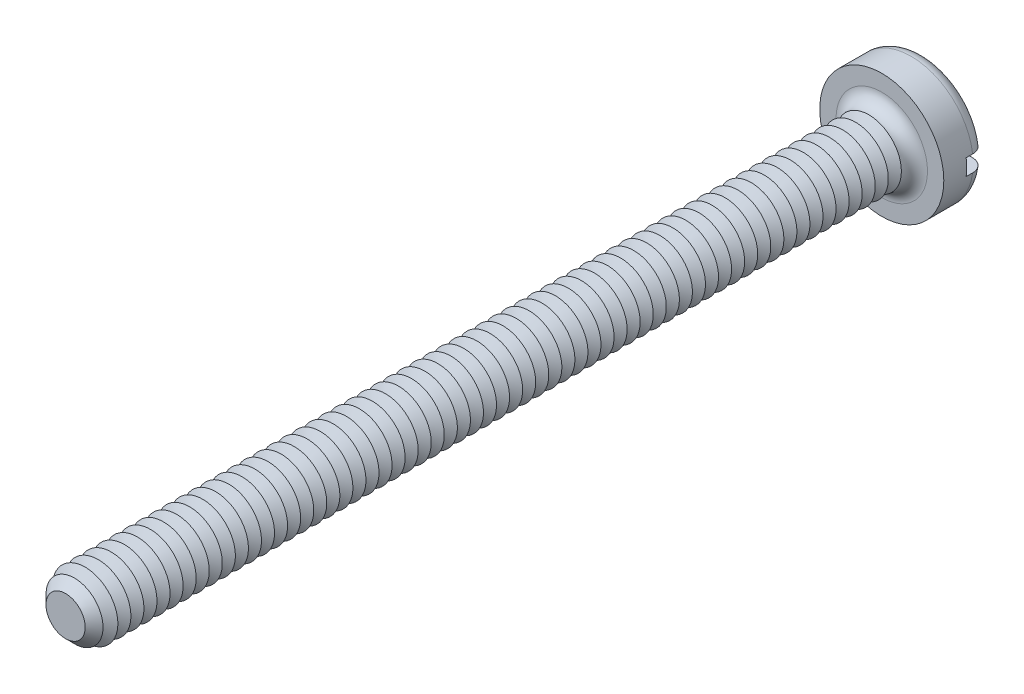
ISO-10303-21;
HEADER;
FILE_DESCRIPTION(('STEP AP214'),'2;1');
FILE_NAME('part.step','',(''),(''),'','','');
FILE_SCHEMA(('AUTOMOTIVE_DESIGN { 1 0 10303 214 1 1 1 1 }'));
ENDSEC;
DATA;
#1=APPLICATION_CONTEXT('core data for automotive mechanical design processes');
#2=APPLICATION_PROTOCOL_DEFINITION('international standard','automotive_design',2000,#1);
#3=PRODUCT_CONTEXT('',#1,'mechanical');
#4=PRODUCT('Part','Part','',(#3));
#5=PRODUCT_RELATED_PRODUCT_CATEGORY('part','',(#4));
#6=PRODUCT_DEFINITION_FORMATION('','',#4);
#7=PRODUCT_DEFINITION_CONTEXT('part definition',#1,'design');
#8=PRODUCT_DEFINITION('design','',#6,#7);
#9=PRODUCT_DEFINITION_SHAPE('','',#8);
#10=(LENGTH_UNIT() NAMED_UNIT(*) SI_UNIT(.MILLI.,.METRE.));
#11=(NAMED_UNIT(*) PLANE_ANGLE_UNIT() SI_UNIT($,.RADIAN.));
#12=(NAMED_UNIT(*) SI_UNIT($,.STERADIAN.) SOLID_ANGLE_UNIT());
#13=UNCERTAINTY_MEASURE_WITH_UNIT(LENGTH_MEASURE(1.E-05),#10,'distance_accuracy_value','');
#14=(GEOMETRIC_REPRESENTATION_CONTEXT(3) GLOBAL_UNCERTAINTY_ASSIGNED_CONTEXT((#13)) GLOBAL_UNIT_ASSIGNED_CONTEXT((#10,
#11,#12)) REPRESENTATION_CONTEXT('',''));
#15=CARTESIAN_POINT('',(0.,0.,0.));
#16=DIRECTION('',(0.,0.,1.));
#17=DIRECTION('',(1.,0.,0.));
#18=AXIS2_PLACEMENT_3D('',#15,#16,#17);
#19=CARTESIAN_POINT('',(0.,0.,-1.3));
#20=DIRECTION('',(0.,0.,1.));
#21=DIRECTION('',(1.,0.,0.));
#22=AXIS2_PLACEMENT_3D('',#19,#20,#21);
#23=PLANE('',#22);
#24=CARTESIAN_POINT('',(0.,0.,-1.3));
#25=DIRECTION('',(0.,0.,1.));
#26=DIRECTION('',(1.,0.,0.));
#27=AXIS2_PLACEMENT_3D('',#24,#25,#26);
#28=CIRCLE('',#27,1.5);
#29=CARTESIAN_POINT('',(-1.4790199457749,0.25,-1.3));
#30=VERTEX_POINT('',#29);
#31=CARTESIAN_POINT('',(1.4790199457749,0.25,-1.3));
#32=VERTEX_POINT('',#31);
#33=EDGE_CURVE('E116',#30,#32,#28,.F.);
#34=ORIENTED_EDGE('',*,*,#33,.T.);
#35=DIRECTION('',(1.,0.,0.));
#36=VECTOR('',#35,1.);
#37=CARTESIAN_POINT('',(-1.9,0.25,-1.3));
#38=LINE('',#37,#36);
#39=EDGE_CURVE('E111',#30,#32,#38,.T.);
#40=ORIENTED_EDGE('',*,*,#39,.F.);
#41=EDGE_LOOP('',(#34,#40));
#42=FACE_BOUND('',#41,.T.);
#43=ADVANCED_FACE('F39',(#42),#23,.F.);
#44=CARTESIAN_POINT('',(0.,0.,-0.9));
#45=DIRECTION('',(0.,0.,1.));
#46=DIRECTION('',(1.,0.,0.));
#47=AXIS2_PLACEMENT_3D('',#44,#45,#46);
#48=TOROIDAL_SURFACE('',#47,1.5,0.4);
#49=CARTESIAN_POINT('',(-1.8150392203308,0.25,-1.12284384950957));
#50=CARTESIAN_POINT('',(-1.80236980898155,0.25,-1.14155059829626));
#51=CARTESIAN_POINT('',(-1.78809920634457,0.25,-1.15919399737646));
#52=CARTESIAN_POINT('',(-1.75677844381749,0.25,-1.19184073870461));
#53=CARTESIAN_POINT('',(-1.73972468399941,0.25,-1.20684060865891));
#54=CARTESIAN_POINT('',(-1.70336024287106,0.25,-1.23375848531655));
#55=CARTESIAN_POINT('',(-1.68405164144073,0.25,-1.24567930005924));
#56=CARTESIAN_POINT('',(-1.64372549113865,0.25,-1.26613528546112));
#57=CARTESIAN_POINT('',(-1.6227083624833,0.25,-1.27467128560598));
#58=CARTESIAN_POINT('',(-1.57937988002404,0.25,-1.2881995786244));
#59=CARTESIAN_POINT('',(-1.55705957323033,0.25,-1.29316318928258));
#60=CARTESIAN_POINT('',(-1.51190394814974,0.25,-1.29931753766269));
#61=CARTESIAN_POINT('',(-1.48906857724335,0.25,-1.3005078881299));
#62=CARTESIAN_POINT('',(-1.4432641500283,0.25,-1.29909058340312));
#63=CARTESIAN_POINT('',(-1.42029638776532,0.25,-1.29644099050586));
#64=CARTESIAN_POINT('',(-1.37512297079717,0.25,-1.28735146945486));
#65=CARTESIAN_POINT('',(-1.3529173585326,0.25,-1.28091133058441));
#66=CARTESIAN_POINT('',(-1.30974098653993,0.25,-1.26436295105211));
#67=CARTESIAN_POINT('',(-1.28877978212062,0.25,-1.25422975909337));
#68=CARTESIAN_POINT('',(-1.24886205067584,0.25,-1.23057736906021));
#69=CARTESIAN_POINT('',(-1.22990554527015,0.25,-1.21705813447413));
#70=CARTESIAN_POINT('',(-1.19461911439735,0.25,-1.18704970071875));
#71=CARTESIAN_POINT('',(-1.17828051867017,0.25,-1.17057070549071));
#72=CARTESIAN_POINT('',(-1.14865897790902,0.25,-1.13506201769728));
#73=CARTESIAN_POINT('',(-1.13537576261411,0.25,-1.11603255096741));
#74=CARTESIAN_POINT('',(-1.11249827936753,0.25,-1.07630328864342));
#75=CARTESIAN_POINT('',(-1.10284494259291,0.25,-1.05563752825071));
#76=CARTESIAN_POINT('',(-1.08724024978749,0.25,-1.01295282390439));
#77=CARTESIAN_POINT('',(-1.08128829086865,0.25,-0.990934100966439));
#78=CARTESIAN_POINT('',(-1.07339124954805,0.25,-0.946722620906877));
#79=CARTESIAN_POINT('',(-1.07135558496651,0.25,-0.924546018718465));
#80=CARTESIAN_POINT('',(-1.07108722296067,0.25,-0.880170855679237));
#81=CARTESIAN_POINT('',(-1.07285419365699,0.25,-0.857972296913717));
#82=CARTESIAN_POINT('',(-1.0800838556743,0.25,-0.814463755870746));
#83=CARTESIAN_POINT('',(-1.08550159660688,0.25,-0.793146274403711));
#84=CARTESIAN_POINT('',(-1.09980522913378,0.25,-0.751709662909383));
#85=CARTESIAN_POINT('',(-1.10869126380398,0.25,-0.731590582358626));
#86=CARTESIAN_POINT('',(-1.12975121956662,0.25,-0.692901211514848));
#87=CARTESIAN_POINT('',(-1.14195627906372,0.25,-0.674347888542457));
#88=CARTESIAN_POINT('',(-1.1692428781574,0.25,-0.639494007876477));
#89=CARTESIAN_POINT('',(-1.18432473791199,0.25,-0.623193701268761));
#90=CARTESIAN_POINT('',(-1.21730350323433,0.25,-0.592916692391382));
#91=CARTESIAN_POINT('',(-1.23525650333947,0.25,-0.579001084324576));
#92=CARTESIAN_POINT('',(-1.27320799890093,0.25,-0.554314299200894));
#93=CARTESIAN_POINT('',(-1.2932067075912,0.25,-0.543543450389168));
#94=CARTESIAN_POINT('',(-1.33509120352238,0.25,-0.525253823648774));
#95=CARTESIAN_POINT('',(-1.35700545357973,0.25,-0.517800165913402));
#96=CARTESIAN_POINT('',(-1.401770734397,0.25,-0.506652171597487));
#97=CARTESIAN_POINT('',(-1.42462180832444,0.25,-0.502958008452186));
#98=CARTESIAN_POINT('',(-1.4707602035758,0.25,-0.499429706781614));
#99=CARTESIAN_POINT('',(-1.49404932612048,0.25,-0.499619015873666));
#100=CARTESIAN_POINT('',(-1.54026206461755,0.25,-0.50392615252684));
#101=CARTESIAN_POINT('',(-1.56318568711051,0.25,-0.508043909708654));
#102=CARTESIAN_POINT('',(-1.60788420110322,0.25,-0.520077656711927));
#103=CARTESIAN_POINT('',(-1.6296645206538,0.25,-0.527973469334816));
#104=CARTESIAN_POINT('',(-1.67156889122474,0.25,-0.547348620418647));
#105=CARTESIAN_POINT('',(-1.69169302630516,0.25,-0.558827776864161));
#106=CARTESIAN_POINT('',(-1.72948251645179,0.25,-0.584913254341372));
#107=CARTESIAN_POINT('',(-1.74717189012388,0.25,-0.599484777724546));
#108=CARTESIAN_POINT('',(-1.77981909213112,0.25,-0.63142070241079));
#109=CARTESIAN_POINT('',(-1.79477707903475,0.25,-0.648784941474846));
#110=CARTESIAN_POINT('',(-1.82136524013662,0.25,-0.685607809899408));
#111=CARTESIAN_POINT('',(-1.83303003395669,0.25,-0.705041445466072));
#112=CARTESIAN_POINT('',(-1.85289960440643,0.25,-0.745602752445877));
#113=CARTESIAN_POINT('',(-1.86110468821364,0.25,-0.76673027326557));
#114=CARTESIAN_POINT('',(-1.87375648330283,0.25,-0.809891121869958));
#115=CARTESIAN_POINT('',(-1.87823381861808,0.25,-0.831915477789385));
#116=CARTESIAN_POINT('',(-1.88341152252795,0.25,-0.87640983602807));
#117=CARTESIAN_POINT('',(-1.88411103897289,0.25,-0.898879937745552));
#118=CARTESIAN_POINT('',(-1.88171559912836,0.25,-0.943534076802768));
#119=CARTESIAN_POINT('',(-1.87863413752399,0.25,-0.965718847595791));
#120=CARTESIAN_POINT('',(-1.86879153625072,0.25,-1.00923650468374));
#121=CARTESIAN_POINT('',(-1.86203494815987,0.25,-1.03057040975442));
#122=CARTESIAN_POINT('',(-1.84837477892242,0.25,-1.06373797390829));
#123=CARTESIAN_POINT('',(-1.84255723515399,0.25,-1.07603047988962));
#124=CARTESIAN_POINT('',(-1.82969924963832,0.25,-1.09995814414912));
#125=CARTESIAN_POINT('',(-1.82265881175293,0.25,-1.11159330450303));
#126=CARTESIAN_POINT('',(-1.8150392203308,0.25,-1.12284384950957));
#127=B_SPLINE_CURVE_WITH_KNOTS('',3,(#49,#50,#51,#52,#53,#54,#55,#56,#57,#58,#59,#60,#61,#62,
#63,#64,#65,#66,#67,#68,#69,#70,#71,#72,#73,#74,#75,#76,#77,#78,#79,#80,#81,#82,#83,#84,#85,#86,
#87,#88,#89,#90,#91,#92,#93,#94,#95,#96,#97,#98,#99,#100,#101,#102,#103,#104,#105,#106,#107,
#108,#109,#110,#111,#112,#113,#114,#115,#116,#117,#118,#119,#120,#121,#122,#123,#124,#125,#126),
.UNSPECIFIED.,.T.,.F.,(4,2,2,2,2,2,2,2,2,2,2,2,2,2,2,2,2,2,2,2,2,2,2,2,2,2,2,2,2,2,2,2,2,2,2,2,
2,2,4),(0.,0.0677296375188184,0.135547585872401,0.203303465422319,0.27104273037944,
0.339319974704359,0.407604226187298,0.47663988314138,0.545679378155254,0.615194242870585,
0.684709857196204,0.753990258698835,0.82326452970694,0.891356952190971,0.959438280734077,
1.02592503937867,1.0924059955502,1.15808300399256,1.2237627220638,1.29008126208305,
1.35640718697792,1.4242376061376,1.49207510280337,1.5611911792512,1.63031044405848,
1.69984715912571,1.76938262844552,1.8385508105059,1.90771547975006,1.97613962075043,
2.04455978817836,2.11223135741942,2.17989691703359,2.24700094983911,2.31412011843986,
2.38100042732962,2.44779809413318,2.48853193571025,2.52926564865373),.UNSPECIFIED.);
#128=CARTESIAN_POINT('',(-1.88348082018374,0.25,-0.9));
#129=VERTEX_POINT('',#128);
#130=EDGE_CURVE('E673',#129,#30,#127,.T.);
#131=ORIENTED_EDGE('',*,*,#130,.F.);
#132=CARTESIAN_POINT('',(0.,0.,-0.9));
#133=DIRECTION('',(0.,0.,1.));
#134=DIRECTION('',(1.,0.,0.));
#135=AXIS2_PLACEMENT_3D('',#132,#133,#134);
#136=CIRCLE('',#135,1.9);
#137=CARTESIAN_POINT('',(1.88348082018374,0.25,-0.9));
#138=VERTEX_POINT('',#137);
#139=EDGE_CURVE('E125',#138,#129,#136,.T.);
#140=ORIENTED_EDGE('',*,*,#139,.F.);
#141=CARTESIAN_POINT('',(1.11362660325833,0.25,-1.07710243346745));
#142=CARTESIAN_POINT('',(1.12388366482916,0.25,-1.09736755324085));
#143=CARTESIAN_POINT('',(1.13589127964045,0.25,-1.11676768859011));
#144=CARTESIAN_POINT('',(1.16301945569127,0.25,-1.15328107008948));
#145=CARTESIAN_POINT('',(1.17814463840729,0.25,-1.17039085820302));
#146=CARTESIAN_POINT('',(1.21101661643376,0.25,-1.20182395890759));
#147=CARTESIAN_POINT('',(1.22875976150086,0.25,-1.21615108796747));
#148=CARTESIAN_POINT('',(1.26636392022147,0.25,-1.24166932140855));
#149=CARTESIAN_POINT('',(1.28622436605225,0.25,-1.25286126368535));
#150=CARTESIAN_POINT('',(1.32781377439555,0.25,-1.27196191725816));
#151=CARTESIAN_POINT('',(1.34956550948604,0.25,-1.27982107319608));
#152=CARTESIAN_POINT('',(1.39407620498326,0.25,-1.29180513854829));
#153=CARTESIAN_POINT('',(1.41683526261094,0.25,-1.29592968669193));
#154=CARTESIAN_POINT('',(1.46288034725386,0.25,-1.3003367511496));
#155=CARTESIAN_POINT('',(1.48616890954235,0.25,-1.30059287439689));
#156=CARTESIAN_POINT('',(1.53245605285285,0.25,-1.29717239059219));
#157=CARTESIAN_POINT('',(1.55545463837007,0.25,-1.29349584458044));
#158=CARTESIAN_POINT('',(1.60038828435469,0.25,-1.28232271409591));
#159=CARTESIAN_POINT('',(1.62232790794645,0.25,-1.27484449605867));
#160=CARTESIAN_POINT('',(1.66461970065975,0.25,-1.25627203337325));
#161=CARTESIAN_POINT('',(1.68497195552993,0.25,-1.24517798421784));
#162=CARTESIAN_POINT('',(1.72328060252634,0.25,-1.21981269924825));
#163=CARTESIAN_POINT('',(1.74126001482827,0.25,-1.2055762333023));
#164=CARTESIAN_POINT('',(1.77453973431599,0.25,-1.17425606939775));
#165=CARTESIAN_POINT('',(1.78984019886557,0.25,-1.1571725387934));
#166=CARTESIAN_POINT('',(1.81715014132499,0.25,-1.12084732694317));
#167=CARTESIAN_POINT('',(1.82919410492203,0.25,-1.10163156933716));
#168=CARTESIAN_POINT('',(1.84985315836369,0.25,-1.06143759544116));
#169=CARTESIAN_POINT('',(1.85846842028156,0.25,-1.04045946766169));
#170=CARTESIAN_POINT('',(1.87195437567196,0.25,-0.997526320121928));
#171=CARTESIAN_POINT('',(1.87685590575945,0.25,-0.975580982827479));
#172=CARTESIAN_POINT('',(1.88288741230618,0.25,-0.931178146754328));
#173=CARTESIAN_POINT('',(1.88401750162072,0.25,-0.908720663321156));
#174=CARTESIAN_POINT('',(1.88247598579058,0.25,-0.864033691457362));
#175=CARTESIAN_POINT('',(1.87982069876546,0.25,-0.841803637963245));
#176=CARTESIAN_POINT('',(1.87081646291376,0.25,-0.798104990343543));
#177=CARTESIAN_POINT('',(1.86446754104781,0.25,-0.776636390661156));
#178=CARTESIAN_POINT('',(1.84826063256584,0.25,-0.735060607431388));
#179=CARTESIAN_POINT('',(1.83840161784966,0.25,-0.714953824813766));
#180=CARTESIAN_POINT('',(1.81546327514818,0.25,-0.676670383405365));
#181=CARTESIAN_POINT('',(1.80238389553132,0.25,-0.658493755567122));
#182=CARTESIAN_POINT('',(1.77331327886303,0.25,-0.62448916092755));
#183=CARTESIAN_POINT('',(1.75730833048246,0.25,-0.608672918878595));
#184=CARTESIAN_POINT('',(1.72289038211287,0.25,-0.579924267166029));
#185=CARTESIAN_POINT('',(1.70447729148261,0.25,-0.566991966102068));
#186=CARTESIAN_POINT('',(1.66559643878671,0.25,-0.544254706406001));
#187=CARTESIAN_POINT('',(1.64511218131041,0.25,-0.53447796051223));
#188=CARTESIAN_POINT('',(1.60280554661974,0.25,-0.518459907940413));
#189=CARTESIAN_POINT('',(1.58098309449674,0.25,-0.512218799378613));
#190=CARTESIAN_POINT('',(1.53636184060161,0.25,-0.503375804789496));
#191=CARTESIAN_POINT('',(1.51355490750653,0.25,-0.500814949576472));
#192=CARTESIAN_POINT('',(1.46783245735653,0.25,-0.499516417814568));
#193=CARTESIAN_POINT('',(1.44491693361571,0.25,-0.500778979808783));
#194=CARTESIAN_POINT('',(1.39937748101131,0.25,-0.50711284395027));
#195=CARTESIAN_POINT('',(1.37675897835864,0.25,-0.512223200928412));
#196=CARTESIAN_POINT('',(1.33269286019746,0.25,-0.526151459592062));
#197=CARTESIAN_POINT('',(1.31124530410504,0.25,-0.534969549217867));
#198=CARTESIAN_POINT('',(1.27004097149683,0.25,-0.556118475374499));
#199=CARTESIAN_POINT('',(1.25029179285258,0.25,-0.568464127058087));
#200=CARTESIAN_POINT('',(1.21316554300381,0.25,-0.59631968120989));
#201=CARTESIAN_POINT('',(1.19578844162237,0.25,-0.611829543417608));
#202=CARTESIAN_POINT('',(1.16406059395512,0.25,-0.645459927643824));
#203=CARTESIAN_POINT('',(1.14968747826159,0.25,-0.663559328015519));
#204=CARTESIAN_POINT('',(1.12425968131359,0.25,-0.70195566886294));
#205=CARTESIAN_POINT('',(1.11320445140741,0.25,-0.722252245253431));
#206=CARTESIAN_POINT('',(1.09497726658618,0.25,-0.764020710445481));
#207=CARTESIAN_POINT('',(1.08772970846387,0.25,-0.785459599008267));
#208=CARTESIAN_POINT('',(1.07702618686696,0.25,-0.829269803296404));
#209=CARTESIAN_POINT('',(1.07357062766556,0.25,-0.851641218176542));
#210=CARTESIAN_POINT('',(1.07060826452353,0.25,-0.896160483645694));
#211=CARTESIAN_POINT('',(1.07101876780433,0.25,-0.918302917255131));
#212=CARTESIAN_POINT('',(1.07557730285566,0.25,-0.962179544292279));
#213=CARTESIAN_POINT('',(1.07972048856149,0.25,-0.983914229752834));
#214=CARTESIAN_POINT('',(1.08912066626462,0.25,-1.01754924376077));
#215=CARTESIAN_POINT('',(1.09320341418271,0.25,-1.02979035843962));
#216=CARTESIAN_POINT('',(1.10254493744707,0.25,-1.05381470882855));
#217=CARTESIAN_POINT('',(1.10780368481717,0.25,-1.06559795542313));
#218=CARTESIAN_POINT('',(1.11362660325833,0.25,-1.07710243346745));
#219=B_SPLINE_CURVE_WITH_KNOTS('',3,(#141,#142,#143,#144,#145,#146,#147,#148,#149,#150,#151,
#152,#153,#154,#155,#156,#157,#158,#159,#160,#161,#162,#163,#164,#165,#166,#167,#168,#169,#170,
#171,#172,#173,#174,#175,#176,#177,#178,#179,#180,#181,#182,#183,#184,#185,#186,#187,#188,#189,
#190,#191,#192,#193,#194,#195,#196,#197,#198,#199,#200,#201,#202,#203,#204,#205,#206,#207,#208,
#209,#210,#211,#212,#213,#214,#215,#216,#217,#218),.UNSPECIFIED.,.T.,.F.,(4,2,2,2,2,2,2,2,2,2,2,
2,2,2,2,2,2,2,2,2,2,2,2,2,2,2,2,2,2,2,2,2,2,2,2,2,2,2,4),(0.,0.0680907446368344,
0.136283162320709,0.204381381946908,0.272461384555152,0.341520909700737,0.410587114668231,
0.480124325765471,0.549660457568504,0.618863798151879,0.688063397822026,0.756532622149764,
0.824997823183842,0.892706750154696,0.960412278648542,1.02754926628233,1.09468424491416,
1.16153068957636,1.22837664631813,1.29524219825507,1.36210882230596,1.42929726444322,
1.49648823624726,1.56426429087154,1.63204414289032,1.70057395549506,1.76910804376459,
1.83834728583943,1.90759003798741,1.97712798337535,2.0466650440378,2.11566422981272,
2.18465199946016,2.25221259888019,2.3197804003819,2.38590630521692,2.45194648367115,
2.49060241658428,2.5292574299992),.UNSPECIFIED.);
#220=EDGE_CURVE('E675',#32,#138,#219,.T.);
#221=ORIENTED_EDGE('',*,*,#220,.F.);
#222=ORIENTED_EDGE('',*,*,#33,.F.);
#223=EDGE_LOOP('',(#131,#140,#221,#222));
#224=FACE_BOUND('',#223,.T.);
#225=ADVANCED_FACE('F657',(#224),#48,.T.);
#226=CARTESIAN_POINT('',(0.,0.,-1.3));
#227=DIRECTION('',(0.,0.,1.));
#228=DIRECTION('',(1.,0.,0.));
#229=AXIS2_PLACEMENT_3D('',#226,#227,#228);
#230=CYLINDRICAL_SURFACE('',#229,1.9);
#231=DIRECTION('',(0.,0.,1.));
#232=VECTOR('',#231,1.);
#233=CARTESIAN_POINT('',(1.88348082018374,0.25,-1.3));
#234=LINE('',#233,#232);
#235=CARTESIAN_POINT('',(1.88348082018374,0.25,-0.7));
#236=VERTEX_POINT('',#235);
#237=EDGE_CURVE('E691',#138,#236,#234,.T.);
#238=ORIENTED_EDGE('',*,*,#237,.F.);
#239=ORIENTED_EDGE('',*,*,#139,.T.);
#240=DIRECTION('',(0.,0.,1.));
#241=VECTOR('',#240,1.);
#242=CARTESIAN_POINT('',(-1.88348082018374,0.25,-1.3));
#243=LINE('',#242,#241);
#244=CARTESIAN_POINT('',(-1.88348082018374,0.25,-0.7));
#245=VERTEX_POINT('',#244);
#246=EDGE_CURVE('E63',#245,#129,#243,.F.);
#247=ORIENTED_EDGE('',*,*,#246,.F.);
#248=CARTESIAN_POINT('',(0.,0.,-0.7));
#249=DIRECTION('',(0.,0.,-1.));
#250=DIRECTION('',(-1.,0.,0.));
#251=AXIS2_PLACEMENT_3D('',#248,#249,#250);
#252=CIRCLE('',#251,1.9);
#253=CARTESIAN_POINT('',(-1.88348082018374,-0.25,-0.7));
#254=VERTEX_POINT('',#253);
#255=EDGE_CURVE('E43',#245,#254,#252,.F.);
#256=ORIENTED_EDGE('',*,*,#255,.T.);
#257=DIRECTION('',(0.,0.,1.));
#258=VECTOR('',#257,1.);
#259=CARTESIAN_POINT('',(-1.88348082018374,-0.25,-1.3));
#260=LINE('',#259,#258);
#261=CARTESIAN_POINT('',(-1.88348082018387,-0.25,-0.899999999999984));
#262=VERTEX_POINT('',#261);
#263=EDGE_CURVE('E688',#262,#254,#260,.T.);
#264=ORIENTED_EDGE('',*,*,#263,.F.);
#265=CARTESIAN_POINT('',(1.88348082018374,-0.25,-0.9));
#266=VERTEX_POINT('',#265);
#267=EDGE_CURVE('E127',#262,#266,#136,.T.);
#268=ORIENTED_EDGE('',*,*,#267,.T.);
#269=DIRECTION('',(0.,0.,1.));
#270=VECTOR('',#269,1.);
#271=CARTESIAN_POINT('',(1.88348082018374,-0.25,-1.3));
#272=LINE('',#271,#270);
#273=CARTESIAN_POINT('',(1.88348082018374,-0.25,-0.7));
#274=VERTEX_POINT('',#273);
#275=EDGE_CURVE('E55',#274,#266,#272,.F.);
#276=ORIENTED_EDGE('',*,*,#275,.F.);
#277=EDGE_CURVE('E11',#274,#236,#252,.F.);
#278=ORIENTED_EDGE('',*,*,#277,.T.);
#279=EDGE_LOOP('',(#238,#239,#247,#256,#264,#268,#276,#278));
#280=FACE_BOUND('',#279,.T.);
#281=CARTESIAN_POINT('',(0.,0.,0.));
#282=DIRECTION('',(0.,0.,1.));
#283=DIRECTION('',(1.,0.,0.));
#284=AXIS2_PLACEMENT_3D('',#281,#282,#283);
#285=CIRCLE('',#284,1.9);
#286=CARTESIAN_POINT('',(1.9,0.,0.));
#287=VERTEX_POINT('',#286);
#288=EDGE_CURVE('E694',#287,#287,#285,.T.);
#289=ORIENTED_EDGE('',*,*,#288,.F.);
#290=EDGE_LOOP('',(#289));
#291=FACE_BOUND('',#290,.T.);
#292=ADVANCED_FACE('F653',(#280,#291),#230,.T.);
#293=CARTESIAN_POINT('',(1.4790199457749,-0.25,-1.3));
#294=VERTEX_POINT('',#293);
#295=CARTESIAN_POINT('',(-1.4790199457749,-0.25,-1.3));
#296=VERTEX_POINT('',#295);
#297=EDGE_CURVE('E109',#294,#296,#28,.F.);
#298=ORIENTED_EDGE('',*,*,#297,.T.);
#299=DIRECTION('',(-1.,0.,0.));
#300=VECTOR('',#299,1.);
#301=CARTESIAN_POINT('',(-1.9,-0.25,-1.3));
#302=LINE('',#301,#300);
#303=EDGE_CURVE('E96',#294,#296,#302,.T.);
#304=ORIENTED_EDGE('',*,*,#303,.F.);
#305=EDGE_LOOP('',(#298,#304));
#306=FACE_BOUND('',#305,.T.);
#307=ADVANCED_FACE('F108',(#306),#23,.F.);
#308=CARTESIAN_POINT('',(0.,0.,0.));
#309=DIRECTION('',(0.,0.,1.));
#310=DIRECTION('',(1.,0.,0.));
#311=AXIS2_PLACEMENT_3D('',#308,#309,#310);
#312=PLANE('',#311);
#313=CARTESIAN_POINT('',(0.,0.,0.));
#314=DIRECTION('',(0.,0.,1.));
#315=DIRECTION('',(1.,0.,0.));
#316=AXIS2_PLACEMENT_3D('',#313,#314,#315);
#317=CIRCLE('',#316,1.4);
#318=CARTESIAN_POINT('',(1.4,0.,0.));
#319=VERTEX_POINT('',#318);
#320=EDGE_CURVE('E115',#319,#319,#317,.F.);
#321=ORIENTED_EDGE('',*,*,#320,.T.);
#322=EDGE_LOOP('',(#321));
#323=FACE_BOUND('',#322,.T.);
#324=ORIENTED_EDGE('',*,*,#288,.T.);
#325=EDGE_LOOP('',(#324));
#326=FACE_BOUND('',#325,.T.);
#327=ADVANCED_FACE('F652',(#323,#326),#312,.T.);
#328=CARTESIAN_POINT('',(-1.8150392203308,-0.25,-1.12284384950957));
#329=CARTESIAN_POINT('',(-1.82756185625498,-0.25,-1.10435021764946));
#330=CARTESIAN_POINT('',(-1.83853807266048,-0.25,-1.08479072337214));
#331=CARTESIAN_POINT('',(-1.85706233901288,-0.25,-1.04409188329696));
#332=CARTESIAN_POINT('',(-1.86460655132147,-0.25,-1.02295079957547));
#333=CARTESIAN_POINT('',(-1.87603074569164,-0.25,-0.979704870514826));
#334=CARTESIAN_POINT('',(-1.87991177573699,-0.25,-0.957600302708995));
#335=CARTESIAN_POINT('',(-1.88389586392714,-0.25,-0.913058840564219));
#336=CARTESIAN_POINT('',(-1.88399981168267,-0.25,-0.890622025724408));
#337=CARTESIAN_POINT('',(-1.88043374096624,-0.25,-0.846104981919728));
#338=CARTESIAN_POINT('',(-1.87677281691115,-0.25,-0.824024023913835));
#339=CARTESIAN_POINT('',(-1.86579880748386,-0.25,-0.780788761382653));
#340=CARTESIAN_POINT('',(-1.85848560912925,-0.25,-0.759634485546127));
#341=CARTESIAN_POINT('',(-1.8404137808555,-0.25,-0.718830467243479));
#342=CARTESIAN_POINT('',(-1.82965205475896,-0.25,-0.699182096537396));
#343=CARTESIAN_POINT('',(-1.80499939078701,-0.25,-0.661958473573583));
#344=CARTESIAN_POINT('',(-1.7911083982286,-0.25,-0.644383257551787));
#345=CARTESIAN_POINT('',(-1.76051564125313,-0.25,-0.611699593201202));
#346=CARTESIAN_POINT('',(-1.74379913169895,-0.25,-0.596604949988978));
#347=CARTESIAN_POINT('',(-1.70808901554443,-0.25,-0.569406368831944));
#348=CARTESIAN_POINT('',(-1.68909532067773,-0.25,-0.557302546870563));
#349=CARTESIAN_POINT('',(-1.64918615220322,-0.25,-0.536307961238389));
#350=CARTESIAN_POINT('',(-1.62825469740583,-0.25,-0.527447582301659));
#351=CARTESIAN_POINT('',(-1.58521203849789,-0.25,-0.513323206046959));
#352=CARTESIAN_POINT('',(-1.5631007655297,-0.25,-0.508059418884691));
#353=CARTESIAN_POINT('',(-1.51806209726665,-0.25,-0.501215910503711));
#354=CARTESIAN_POINT('',(-1.4951283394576,-0.25,-0.499678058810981));
#355=CARTESIAN_POINT('',(-1.4493239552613,-0.25,-0.500434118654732));
#356=CARTESIAN_POINT('',(-1.4264533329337,-0.25,-0.502728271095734));
#357=CARTESIAN_POINT('',(-1.38118643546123,-0.25,-0.511115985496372));
#358=CARTESIAN_POINT('',(-1.35879703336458,-0.25,-0.51724667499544));
#359=CARTESIAN_POINT('',(-1.31535851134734,-0.25,-0.533167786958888));
#360=CARTESIAN_POINT('',(-1.29430945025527,-0.25,-0.542958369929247));
#361=CARTESIAN_POINT('',(-1.25409242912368,-0.25,-0.565968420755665));
#362=CARTESIAN_POINT('',(-1.23493023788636,-0.25,-0.579197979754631));
#363=CARTESIAN_POINT('',(-1.19912477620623,-0.25,-0.608715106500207));
#364=CARTESIAN_POINT('',(-1.18248143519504,-0.25,-0.625002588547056));
#365=CARTESIAN_POINT('',(-1.15237533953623,-0.25,-0.660018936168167));
#366=CARTESIAN_POINT('',(-1.13888343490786,-0.25,-0.678722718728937));
#367=CARTESIAN_POINT('',(-1.115312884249,-0.25,-0.718170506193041));
#368=CARTESIAN_POINT('',(-1.10523377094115,-0.25,-0.738914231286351));
#369=CARTESIAN_POINT('',(-1.08901310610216,-0.25,-0.781372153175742));
#370=CARTESIAN_POINT('',(-1.08279080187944,-0.25,-0.803055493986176));
#371=CARTESIAN_POINT('',(-1.07416105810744,-0.25,-0.847167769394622));
#372=CARTESIAN_POINT('',(-1.07175306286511,-0.25,-0.869596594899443));
#373=CARTESIAN_POINT('',(-1.07084656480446,-0.25,-0.914070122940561));
#374=CARTESIAN_POINT('',(-1.07226874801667,-0.25,-0.936113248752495));
#375=CARTESIAN_POINT('',(-1.07880428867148,-0.25,-0.979644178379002));
#376=CARTESIAN_POINT('',(-1.08391755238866,-0.25,-1.00113199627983));
#377=CARTESIAN_POINT('',(-1.09764616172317,-0.25,-1.04290115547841));
#378=CARTESIAN_POINT('',(-1.10625346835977,-0.25,-1.06318514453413));
#379=CARTESIAN_POINT('',(-1.12669365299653,-0.25,-1.10205584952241));
#380=CARTESIAN_POINT('',(-1.13852679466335,-0.25,-1.12064242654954));
#381=CARTESIAN_POINT('',(-1.16529672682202,-0.25,-1.15594801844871));
#382=CARTESIAN_POINT('',(-1.18028464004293,-0.25,-1.17262825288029));
#383=CARTESIAN_POINT('',(-1.21279183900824,-0.25,-1.20330600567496));
#384=CARTESIAN_POINT('',(-1.23031142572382,-0.25,-1.21730320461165));
#385=CARTESIAN_POINT('',(-1.26781695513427,-0.25,-1.24254670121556));
#386=CARTESIAN_POINT('',(-1.28784999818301,-0.25,-1.25372305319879));
#387=CARTESIAN_POINT('',(-1.3294899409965,-0.25,-1.27260611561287));
#388=CARTESIAN_POINT('',(-1.35109697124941,-0.25,-1.28031253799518));
#389=CARTESIAN_POINT('',(-1.39558575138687,-0.25,-1.29212626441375));
#390=CARTESIAN_POINT('',(-1.4184807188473,-0.25,-1.29618386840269));
#391=CARTESIAN_POINT('',(-1.4646266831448,-0.25,-1.30039947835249));
#392=CARTESIAN_POINT('',(-1.48787767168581,-0.25,-1.30055757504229));
#393=CARTESIAN_POINT('',(-1.53407883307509,-0.25,-1.29695468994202));
#394=CARTESIAN_POINT('',(-1.55702895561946,-0.25,-1.29319306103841));
#395=CARTESIAN_POINT('',(-1.60196718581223,-0.25,-1.28183520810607));
#396=CARTESIAN_POINT('',(-1.62395508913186,-0.25,-1.27423817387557));
#397=CARTESIAN_POINT('',(-1.66614393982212,-0.25,-1.25548646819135));
#398=CARTESIAN_POINT('',(-1.68635782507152,-0.25,-1.24436087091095));
#399=CARTESIAN_POINT('',(-1.72458266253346,-0.25,-1.21884344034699));
#400=CARTESIAN_POINT('',(-1.74259637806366,-0.25,-1.20445577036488));
#401=CARTESIAN_POINT('',(-1.76968989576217,-0.25,-1.1787247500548));
#402=CARTESIAN_POINT('',(-1.77959984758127,-0.25,-1.1682407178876));
#403=CARTESIAN_POINT('',(-1.79823423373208,-0.25,-1.14626700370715));
#404=CARTESIAN_POINT('',(-1.80695867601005,-0.25,-1.1347773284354));
#405=CARTESIAN_POINT('',(-1.8150392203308,-0.25,-1.12284384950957));
#406=B_SPLINE_CURVE_WITH_KNOTS('',3,(#328,#329,#330,#331,#332,#333,#334,#335,#336,#337,#338,
#339,#340,#341,#342,#343,#344,#345,#346,#347,#348,#349,#350,#351,#352,#353,#354,#355,#356,#357,
#358,#359,#360,#361,#362,#363,#364,#365,#366,#367,#368,#369,#370,#371,#372,#373,#374,#375,#376,
#377,#378,#379,#380,#381,#382,#383,#384,#385,#386,#387,#388,#389,#390,#391,#392,#393,#394,#395,
#396,#397,#398,#399,#400,#401,#402,#403,#404,#405),.UNSPECIFIED.,.T.,.F.,(4,2,2,2,2,2,2,2,2,2,2,
2,2,2,2,2,2,2,2,2,2,2,2,2,2,2,2,2,2,2,2,2,2,2,2,2,2,2,4),(0.,0.0669512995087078,
0.133977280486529,0.200984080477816,0.267975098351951,0.334804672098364,0.401636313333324,
0.468528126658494,0.535421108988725,0.602674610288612,0.669930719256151,0.737801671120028,
0.805676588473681,0.87431077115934,0.942949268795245,1.0122625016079,1.08157877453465,
1.15110078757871,1.22062085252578,1.28946987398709,1.35830946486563,1.42565417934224,
1.49298908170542,1.55894041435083,1.62489007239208,1.69068884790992,1.75649300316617,
1.82345932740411,1.89043361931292,1.95893391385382,2.02743989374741,2.09686543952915,
2.16628937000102,2.23572476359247,2.3051748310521,2.3740669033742,2.44287154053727,
2.48607383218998,2.52927583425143),.UNSPECIFIED.);
#407=EDGE_CURVE('E103',#296,#262,#406,.T.);
#408=ORIENTED_EDGE('',*,*,#407,.F.);
#409=ORIENTED_EDGE('',*,*,#297,.F.);
#410=CARTESIAN_POINT('',(1.11362660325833,-0.25,-1.07710243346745));
#411=CARTESIAN_POINT('',(1.10368387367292,-0.25,-1.05745397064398));
#412=CARTESIAN_POINT('',(1.09537204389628,-0.25,-1.0369644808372));
#413=CARTESIAN_POINT('',(1.08229212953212,-0.25,-0.994867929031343));
#414=CARTESIAN_POINT('',(1.07752732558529,-0.25,-0.973259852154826));
#415=CARTESIAN_POINT('',(1.07171197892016,-0.25,-0.929545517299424));
#416=CARTESIAN_POINT('',(1.07066166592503,-0.25,-0.907439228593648));
#417=CARTESIAN_POINT('',(1.07231382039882,-0.25,-0.863372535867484));
#418=CARTESIAN_POINT('',(1.07501551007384,-0.25,-0.841412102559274));
#419=CARTESIAN_POINT('',(1.08404966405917,-0.25,-0.798386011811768));
#420=CARTESIAN_POINT('',(1.09036099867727,-0.25,-0.777315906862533));
#421=CARTESIAN_POINT('',(1.10638973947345,-0.25,-0.736514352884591));
#422=CARTESIAN_POINT('',(1.11610743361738,-0.25,-0.716783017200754));
#423=CARTESIAN_POINT('',(1.13878208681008,-0.25,-0.678952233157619));
#424=CARTESIAN_POINT('',(1.15177705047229,-0.25,-0.660875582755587));
#425=CARTESIAN_POINT('',(1.18055347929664,-0.25,-0.62709692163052));
#426=CARTESIAN_POINT('',(1.19633525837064,-0.25,-0.611395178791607));
#427=CARTESIAN_POINT('',(1.23062926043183,-0.25,-0.582430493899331));
#428=CARTESIAN_POINT('',(1.24919608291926,-0.25,-0.569232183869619));
#429=CARTESIAN_POINT('',(1.28825118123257,-0.25,-0.546076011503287));
#430=CARTESIAN_POINT('',(1.30873964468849,-0.25,-0.536118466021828));
#431=CARTESIAN_POINT('',(1.35144534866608,-0.25,-0.519560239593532));
#432=CARTESIAN_POINT('',(1.3736865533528,-0.25,-0.513021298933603));
#433=CARTESIAN_POINT('',(1.41894945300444,-0.25,-0.503751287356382));
#434=CARTESIAN_POINT('',(1.44197117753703,-0.25,-0.50102036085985));
#435=CARTESIAN_POINT('',(1.48824913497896,-0.25,-0.499449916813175));
#436=CARTESIAN_POINT('',(1.5115059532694,-0.25,-0.500627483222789));
#437=CARTESIAN_POINT('',(1.55748678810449,-0.25,-0.506895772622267));
#438=CARTESIAN_POINT('',(1.58021081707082,-0.25,-0.511986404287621));
#439=CARTESIAN_POINT('',(1.6243247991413,-0.25,-0.525910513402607));
#440=CARTESIAN_POINT('',(1.64572225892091,-0.25,-0.534720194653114));
#441=CARTESIAN_POINT('',(1.68671060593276,-0.25,-0.555845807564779));
#442=CARTESIAN_POINT('',(1.70630159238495,-0.25,-0.568161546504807));
#443=CARTESIAN_POINT('',(1.74289060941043,-0.25,-0.595805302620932));
#444=CARTESIAN_POINT('',(1.75991474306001,-0.25,-0.611098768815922));
#445=CARTESIAN_POINT('',(1.79111916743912,-0.25,-0.644354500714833));
#446=CARTESIAN_POINT('',(1.80529962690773,-0.25,-0.662316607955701));
#447=CARTESIAN_POINT('',(1.83025525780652,-0.25,-0.700191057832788));
#448=CARTESIAN_POINT('',(1.84106535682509,-0.25,-0.720080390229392));
#449=CARTESIAN_POINT('',(1.8591630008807,-0.25,-0.761401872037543));
#450=CARTESIAN_POINT('',(1.86645070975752,-0.25,-0.782833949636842));
#451=CARTESIAN_POINT('',(1.87724305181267,-0.25,-0.826454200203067));
#452=CARTESIAN_POINT('',(1.88077646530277,-0.25,-0.848635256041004));
#453=CARTESIAN_POINT('',(1.88405487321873,-0.25,-0.89327539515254));
#454=CARTESIAN_POINT('',(1.88379996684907,-0.25,-0.915734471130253));
#455=CARTESIAN_POINT('',(1.87951702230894,-0.25,-0.96021054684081));
#456=CARTESIAN_POINT('',(1.87550211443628,-0.25,-0.982228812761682));
#457=CARTESIAN_POINT('',(1.86383665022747,-0.25,-1.0252797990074));
#458=CARTESIAN_POINT('',(1.85618610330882,-0.25,-1.04631252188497));
#459=CARTESIAN_POINT('',(1.83746332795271,-0.25,-1.08682395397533));
#460=CARTESIAN_POINT('',(1.82638722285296,-0.25,-1.10630087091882));
#461=CARTESIAN_POINT('',(1.80113946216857,-0.25,-1.14313202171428));
#462=CARTESIAN_POINT('',(1.78696774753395,-0.25,-1.1604862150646));
#463=CARTESIAN_POINT('',(1.75585044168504,-0.25,-1.19268694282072));
#464=CARTESIAN_POINT('',(1.73888979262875,-0.25,-1.20751892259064));
#465=CARTESIAN_POINT('',(1.7027387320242,-0.25,-1.23415579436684));
#466=CARTESIAN_POINT('',(1.68354822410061,-0.25,-1.24596055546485));
#467=CARTESIAN_POINT('',(1.64329341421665,-0.25,-1.26632784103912));
#468=CARTESIAN_POINT('',(1.62221336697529,-0.25,-1.27485924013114));
#469=CARTESIAN_POINT('',(1.5789301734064,-0.25,-1.28830571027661));
#470=CARTESIAN_POINT('',(1.55672695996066,-0.25,-1.29322056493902));
#471=CARTESIAN_POINT('',(1.5115614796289,-0.25,-1.29935191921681));
#472=CARTESIAN_POINT('',(1.4885934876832,-0.25,-1.30052625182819));
#473=CARTESIAN_POINT('',(1.44278240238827,-0.25,-1.2990417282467));
#474=CARTESIAN_POINT('',(1.41993931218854,-0.25,-1.29638277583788));
#475=CARTESIAN_POINT('',(1.37479511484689,-0.25,-1.28727159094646));
#476=CARTESIAN_POINT('',(1.35250125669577,-0.25,-1.2807834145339));
#477=CARTESIAN_POINT('',(1.30930729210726,-0.25,-1.2641644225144));
#478=CARTESIAN_POINT('',(1.2884075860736,-0.25,-1.25403256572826));
#479=CARTESIAN_POINT('',(1.24854853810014,-0.25,-1.23036781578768));
#480=CARTESIAN_POINT('',(1.22959511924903,-0.25,-1.21682495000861));
#481=CARTESIAN_POINT('',(1.19427766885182,-0.25,-1.18672803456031));
#482=CARTESIAN_POINT('',(1.17791048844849,-0.25,-1.170177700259));
#483=CARTESIAN_POINT('',(1.15346856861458,-0.25,-1.14079355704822));
#484=CARTESIAN_POINT('',(1.14449891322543,-0.25,-1.12869247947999));
#485=CARTESIAN_POINT('',(1.12797460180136,-0.25,-1.10355927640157));
#486=CARTESIAN_POINT('',(1.1204199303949,-0.25,-1.09052716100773));
#487=CARTESIAN_POINT('',(1.11362660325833,-0.25,-1.07710243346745));
#488=B_SPLINE_CURVE_WITH_KNOTS('',3,(#410,#411,#412,#413,#414,#415,#416,#417,#418,#419,#420,
#421,#422,#423,#424,#425,#426,#427,#428,#429,#430,#431,#432,#433,#434,#435,#436,#437,#438,#439,
#440,#441,#442,#443,#444,#445,#446,#447,#448,#449,#450,#451,#452,#453,#454,#455,#456,#457,#458,
#459,#460,#461,#462,#463,#464,#465,#466,#467,#468,#469,#470,#471,#472,#473,#474,#475,#476,#477,
#478,#479,#480,#481,#482,#483,#484,#485,#486,#487),.UNSPECIFIED.,.T.,.F.,(4,2,2,2,2,2,2,2,2,2,2,
2,2,2,2,2,2,2,2,2,2,2,2,2,2,2,2,2,2,2,2,2,2,2,2,2,2,2,4),(0.,0.0660089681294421,
0.132078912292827,0.198152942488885,0.26421327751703,0.329890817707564,0.395573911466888,
0.462056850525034,0.528547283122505,0.596571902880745,0.664603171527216,0.733823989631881,
0.803047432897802,0.872573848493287,0.94209864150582,1.01118516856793,1.08026789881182,
1.14859228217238,1.21691261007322,1.28449938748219,1.35208302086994,1.41914473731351,
1.48620469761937,1.55303134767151,1.61985782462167,1.68676020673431,1.75366386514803,
1.82094137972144,1.88822180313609,1.95612699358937,2.0240362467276,2.09270838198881,
2.16138224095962,2.23071121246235,2.30006001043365,2.36961396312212,2.4390825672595,
2.48418340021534,2.52928374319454),.UNSPECIFIED.);
#489=EDGE_CURVE('E92',#266,#294,#488,.T.);
#490=ORIENTED_EDGE('',*,*,#489,.F.);
#491=ORIENTED_EDGE('',*,*,#267,.F.);
#492=EDGE_LOOP('',(#408,#409,#490,#491));
#493=FACE_BOUND('',#492,.T.);
#494=ADVANCED_FACE('F113',(#493),#48,.T.);
#495=CARTESIAN_POINT('',(0.,0.,0.400000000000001));
#496=DIRECTION('',(0.,0.,1.));
#497=DIRECTION('',(1.,0.,0.));
#498=AXIS2_PLACEMENT_3D('',#495,#496,#497);
#499=TOROIDAL_SURFACE('',#498,1.4,0.4);
#500=ORIENTED_EDGE('',*,*,#320,.F.);
#501=EDGE_LOOP('',(#500));
#502=FACE_BOUND('',#501,.T.);
#503=CARTESIAN_POINT('',(0.,0.,0.400000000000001));
#504=DIRECTION('',(0.,0.,-1.));
#505=DIRECTION('',(-1.,0.,0.));
#506=AXIS2_PLACEMENT_3D('',#503,#504,#505);
#507=CIRCLE('',#506,1.);
#508=CARTESIAN_POINT('',(-1.,0.,0.400000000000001));
#509=VERTEX_POINT('',#508);
#510=EDGE_CURVE('E700',#509,#509,#507,.T.);
#511=ORIENTED_EDGE('',*,*,#510,.T.);
#512=EDGE_LOOP('',(#511));
#513=FACE_BOUND('',#512,.T.);
#514=ADVANCED_FACE('F645',(#502,#513),#499,.F.);
#515=CARTESIAN_POINT('',(0.,0.,0.600000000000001));
#516=DIRECTION('',(0.,0.,-1.));
#517=DIRECTION('',(-1.,0.,0.));
#518=AXIS2_PLACEMENT_3D('',#515,#516,#517);
#519=CONICAL_SURFACE('',#518,0.653589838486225,1.0471975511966);
#520=ORIENTED_EDGE('',*,*,#510,.F.);
#521=EDGE_LOOP('',(#520));
#522=FACE_BOUND('',#521,.T.);
#523=CARTESIAN_POINT('',(0.,0.,0.600000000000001));
#524=DIRECTION('',(0.,0.,-1.));
#525=DIRECTION('',(-1.,0.,0.));
#526=AXIS2_PLACEMENT_3D('',#523,#524,#525);
#527=CIRCLE('',#526,0.653589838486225);
#528=CARTESIAN_POINT('',(-0.653589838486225,0.,0.600000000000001));
#529=VERTEX_POINT('',#528);
#530=EDGE_CURVE('E706',#529,#529,#527,.T.);
#531=ORIENTED_EDGE('',*,*,#530,.T.);
#532=EDGE_LOOP('',(#531));
#533=FACE_BOUND('',#532,.T.);
#534=ADVANCED_FACE('F641',(#522,#533),#519,.T.);
#535=CARTESIAN_POINT('',(0.,0.,0.800000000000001));
#536=DIRECTION('',(0.,0.,1.));
#537=DIRECTION('',(1.,0.,0.));
#538=AXIS2_PLACEMENT_3D('',#535,#536,#537);
#539=CONICAL_SURFACE('',#538,1.,1.0471975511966);
#540=ORIENTED_EDGE('',*,*,#530,.F.);
#541=EDGE_LOOP('',(#540));
#542=FACE_BOUND('',#541,.T.);
#543=CARTESIAN_POINT('',(0.,0.,0.800000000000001));
#544=DIRECTION('',(0.,0.,-1.));
#545=DIRECTION('',(-1.,0.,0.));
#546=AXIS2_PLACEMENT_3D('',#543,#544,#545);
#547=CIRCLE('',#546,1.);
#548=CARTESIAN_POINT('',(-1.,0.,0.800000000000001));
#549=VERTEX_POINT('',#548);
#550=EDGE_CURVE('E711',#549,#549,#547,.T.);
#551=ORIENTED_EDGE('',*,*,#550,.T.);
#552=EDGE_LOOP('',(#551));
#553=FACE_BOUND('',#552,.T.);
#554=ADVANCED_FACE('F637',(#542,#553),#539,.T.);
#555=CARTESIAN_POINT('',(0.,0.,1.));
#556=DIRECTION('',(0.,0.,-1.));
#557=DIRECTION('',(-1.,0.,0.));
#558=AXIS2_PLACEMENT_3D('',#555,#556,#557);
#559=CONICAL_SURFACE('',#558,0.653589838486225,1.0471975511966);
#560=ORIENTED_EDGE('',*,*,#550,.F.);
#561=EDGE_LOOP('',(#560));
#562=FACE_BOUND('',#561,.T.);
#563=CARTESIAN_POINT('',(0.,0.,1.));
#564=DIRECTION('',(0.,0.,-1.));
#565=DIRECTION('',(-1.,0.,0.));
#566=AXIS2_PLACEMENT_3D('',#563,#564,#565);
#567=CIRCLE('',#566,0.653589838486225);
#568=CARTESIAN_POINT('',(-0.653589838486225,0.,1.));
#569=VERTEX_POINT('',#568);
#570=EDGE_CURVE('E715',#569,#569,#567,.T.);
#571=ORIENTED_EDGE('',*,*,#570,.T.);
#572=EDGE_LOOP('',(#571));
#573=FACE_BOUND('',#572,.T.);
#574=ADVANCED_FACE('F633',(#562,#573),#559,.T.);
#575=CARTESIAN_POINT('',(0.,0.,1.2));
#576=DIRECTION('',(0.,0.,1.));
#577=DIRECTION('',(1.,0.,0.));
#578=AXIS2_PLACEMENT_3D('',#575,#576,#577);
#579=CONICAL_SURFACE('',#578,1.,1.0471975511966);
#580=ORIENTED_EDGE('',*,*,#570,.F.);
#581=EDGE_LOOP('',(#580));
#582=FACE_BOUND('',#581,.T.);
#583=CARTESIAN_POINT('',(0.,0.,1.2));
#584=DIRECTION('',(0.,0.,-1.));
#585=DIRECTION('',(-1.,0.,0.));
#586=AXIS2_PLACEMENT_3D('',#583,#584,#585);
#587=CIRCLE('',#586,1.);
#588=CARTESIAN_POINT('',(-1.,0.,1.2));
#589=VERTEX_POINT('',#588);
#590=EDGE_CURVE('E719',#589,#589,#587,.T.);
#591=ORIENTED_EDGE('',*,*,#590,.T.);
#592=EDGE_LOOP('',(#591));
#593=FACE_BOUND('',#592,.T.);
#594=ADVANCED_FACE('F629',(#582,#593),#579,.T.);
#595=CARTESIAN_POINT('',(0.,0.,1.4));
#596=DIRECTION('',(0.,0.,-1.));
#597=DIRECTION('',(-1.,0.,0.));
#598=AXIS2_PLACEMENT_3D('',#595,#596,#597);
#599=CONICAL_SURFACE('',#598,0.653589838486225,1.0471975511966);
#600=ORIENTED_EDGE('',*,*,#590,.F.);
#601=EDGE_LOOP('',(#600));
#602=FACE_BOUND('',#601,.T.);
#603=CARTESIAN_POINT('',(0.,0.,1.4));
#604=DIRECTION('',(0.,0.,-1.));
#605=DIRECTION('',(-1.,0.,0.));
#606=AXIS2_PLACEMENT_3D('',#603,#604,#605);
#607=CIRCLE('',#606,0.653589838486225);
#608=CARTESIAN_POINT('',(-0.653589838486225,0.,1.4));
#609=VERTEX_POINT('',#608);
#610=EDGE_CURVE('E722',#609,#609,#607,.T.);
#611=ORIENTED_EDGE('',*,*,#610,.T.);
#612=EDGE_LOOP('',(#611));
#613=FACE_BOUND('',#612,.T.);
#614=ADVANCED_FACE('F625',(#602,#613),#599,.T.);
#615=CARTESIAN_POINT('',(0.,0.,1.6));
#616=DIRECTION('',(0.,0.,1.));
#617=DIRECTION('',(1.,0.,0.));
#618=AXIS2_PLACEMENT_3D('',#615,#616,#617);
#619=CONICAL_SURFACE('',#618,1.,1.0471975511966);
#620=ORIENTED_EDGE('',*,*,#610,.F.);
#621=EDGE_LOOP('',(#620));
#622=FACE_BOUND('',#621,.T.);
#623=CARTESIAN_POINT('',(0.,0.,1.6));
#624=DIRECTION('',(0.,0.,-1.));
#625=DIRECTION('',(-1.,0.,0.));
#626=AXIS2_PLACEMENT_3D('',#623,#624,#625);
#627=CIRCLE('',#626,1.);
#628=CARTESIAN_POINT('',(-1.,0.,1.6));
#629=VERTEX_POINT('',#628);
#630=EDGE_CURVE('E726',#629,#629,#627,.T.);
#631=ORIENTED_EDGE('',*,*,#630,.T.);
#632=EDGE_LOOP('',(#631));
#633=FACE_BOUND('',#632,.T.);
#634=ADVANCED_FACE('F621',(#622,#633),#619,.T.);
#635=CARTESIAN_POINT('',(0.,0.,1.8));
#636=DIRECTION('',(0.,0.,-1.));
#637=DIRECTION('',(-1.,0.,0.));
#638=AXIS2_PLACEMENT_3D('',#635,#636,#637);
#639=CONICAL_SURFACE('',#638,0.653589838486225,1.0471975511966);
#640=ORIENTED_EDGE('',*,*,#630,.F.);
#641=EDGE_LOOP('',(#640));
#642=FACE_BOUND('',#641,.T.);
#643=CARTESIAN_POINT('',(0.,0.,1.8));
#644=DIRECTION('',(0.,0.,-1.));
#645=DIRECTION('',(-1.,0.,0.));
#646=AXIS2_PLACEMENT_3D('',#643,#644,#645);
#647=CIRCLE('',#646,0.653589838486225);
#648=CARTESIAN_POINT('',(-0.653589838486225,0.,1.8));
#649=VERTEX_POINT('',#648);
#650=EDGE_CURVE('E730',#649,#649,#647,.T.);
#651=ORIENTED_EDGE('',*,*,#650,.T.);
#652=EDGE_LOOP('',(#651));
#653=FACE_BOUND('',#652,.T.);
#654=ADVANCED_FACE('F617',(#642,#653),#639,.T.);
#655=CARTESIAN_POINT('',(0.,0.,2.));
#656=DIRECTION('',(0.,0.,1.));
#657=DIRECTION('',(1.,0.,0.));
#658=AXIS2_PLACEMENT_3D('',#655,#656,#657);
#659=CONICAL_SURFACE('',#658,1.,1.0471975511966);
#660=ORIENTED_EDGE('',*,*,#650,.F.);
#661=EDGE_LOOP('',(#660));
#662=FACE_BOUND('',#661,.T.);
#663=CARTESIAN_POINT('',(0.,0.,2.));
#664=DIRECTION('',(0.,0.,-1.));
#665=DIRECTION('',(-1.,0.,0.));
#666=AXIS2_PLACEMENT_3D('',#663,#664,#665);
#667=CIRCLE('',#666,1.);
#668=CARTESIAN_POINT('',(-1.,0.,2.));
#669=VERTEX_POINT('',#668);
#670=EDGE_CURVE('E734',#669,#669,#667,.T.);
#671=ORIENTED_EDGE('',*,*,#670,.T.);
#672=EDGE_LOOP('',(#671));
#673=FACE_BOUND('',#672,.T.);
#674=ADVANCED_FACE('F613',(#662,#673),#659,.T.);
#675=CARTESIAN_POINT('',(0.,0.,2.2));
#676=DIRECTION('',(0.,0.,-1.));
#677=DIRECTION('',(-1.,0.,0.));
#678=AXIS2_PLACEMENT_3D('',#675,#676,#677);
#679=CONICAL_SURFACE('',#678,0.653589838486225,1.0471975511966);
#680=ORIENTED_EDGE('',*,*,#670,.F.);
#681=EDGE_LOOP('',(#680));
#682=FACE_BOUND('',#681,.T.);
#683=CARTESIAN_POINT('',(0.,0.,2.2));
#684=DIRECTION('',(0.,0.,-1.));
#685=DIRECTION('',(-1.,0.,0.));
#686=AXIS2_PLACEMENT_3D('',#683,#684,#685);
#687=CIRCLE('',#686,0.653589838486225);
#688=CARTESIAN_POINT('',(-0.653589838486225,0.,2.2));
#689=VERTEX_POINT('',#688);
#690=EDGE_CURVE('E738',#689,#689,#687,.T.);
#691=ORIENTED_EDGE('',*,*,#690,.T.);
#692=EDGE_LOOP('',(#691));
#693=FACE_BOUND('',#692,.T.);
#694=ADVANCED_FACE('F609',(#682,#693),#679,.T.);
#695=CARTESIAN_POINT('',(0.,0.,2.4));
#696=DIRECTION('',(0.,0.,1.));
#697=DIRECTION('',(1.,0.,0.));
#698=AXIS2_PLACEMENT_3D('',#695,#696,#697);
#699=CONICAL_SURFACE('',#698,1.,1.0471975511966);
#700=ORIENTED_EDGE('',*,*,#690,.F.);
#701=EDGE_LOOP('',(#700));
#702=FACE_BOUND('',#701,.T.);
#703=CARTESIAN_POINT('',(0.,0.,2.4));
#704=DIRECTION('',(0.,0.,-1.));
#705=DIRECTION('',(-1.,0.,0.));
#706=AXIS2_PLACEMENT_3D('',#703,#704,#705);
#707=CIRCLE('',#706,1.);
#708=CARTESIAN_POINT('',(-1.,0.,2.4));
#709=VERTEX_POINT('',#708);
#710=EDGE_CURVE('E742',#709,#709,#707,.T.);
#711=ORIENTED_EDGE('',*,*,#710,.T.);
#712=EDGE_LOOP('',(#711));
#713=FACE_BOUND('',#712,.T.);
#714=ADVANCED_FACE('F605',(#702,#713),#699,.T.);
#715=CARTESIAN_POINT('',(0.,0.,2.6));
#716=DIRECTION('',(0.,0.,-1.));
#717=DIRECTION('',(-1.,0.,0.));
#718=AXIS2_PLACEMENT_3D('',#715,#716,#717);
#719=CONICAL_SURFACE('',#718,0.653589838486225,1.0471975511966);
#720=ORIENTED_EDGE('',*,*,#710,.F.);
#721=EDGE_LOOP('',(#720));
#722=FACE_BOUND('',#721,.T.);
#723=CARTESIAN_POINT('',(0.,0.,2.6));
#724=DIRECTION('',(0.,0.,-1.));
#725=DIRECTION('',(-1.,0.,0.));
#726=AXIS2_PLACEMENT_3D('',#723,#724,#725);
#727=CIRCLE('',#726,0.653589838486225);
#728=CARTESIAN_POINT('',(-0.653589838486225,0.,2.6));
#729=VERTEX_POINT('',#728);
#730=EDGE_CURVE('E746',#729,#729,#727,.T.);
#731=ORIENTED_EDGE('',*,*,#730,.T.);
#732=EDGE_LOOP('',(#731));
#733=FACE_BOUND('',#732,.T.);
#734=ADVANCED_FACE('F601',(#722,#733),#719,.T.);
#735=CARTESIAN_POINT('',(0.,0.,2.8));
#736=DIRECTION('',(0.,0.,1.));
#737=DIRECTION('',(1.,0.,0.));
#738=AXIS2_PLACEMENT_3D('',#735,#736,#737);
#739=CONICAL_SURFACE('',#738,1.,1.0471975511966);
#740=ORIENTED_EDGE('',*,*,#730,.F.);
#741=EDGE_LOOP('',(#740));
#742=FACE_BOUND('',#741,.T.);
#743=CARTESIAN_POINT('',(0.,0.,2.8));
#744=DIRECTION('',(0.,0.,-1.));
#745=DIRECTION('',(-1.,0.,0.));
#746=AXIS2_PLACEMENT_3D('',#743,#744,#745);
#747=CIRCLE('',#746,1.);
#748=CARTESIAN_POINT('',(-1.,0.,2.8));
#749=VERTEX_POINT('',#748);
#750=EDGE_CURVE('E749',#749,#749,#747,.T.);
#751=ORIENTED_EDGE('',*,*,#750,.T.);
#752=EDGE_LOOP('',(#751));
#753=FACE_BOUND('',#752,.T.);
#754=ADVANCED_FACE('F597',(#742,#753),#739,.T.);
#755=CARTESIAN_POINT('',(0.,0.,3.));
#756=DIRECTION('',(0.,0.,-1.));
#757=DIRECTION('',(-1.,0.,0.));
#758=AXIS2_PLACEMENT_3D('',#755,#756,#757);
#759=CONICAL_SURFACE('',#758,0.653589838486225,1.0471975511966);
#760=ORIENTED_EDGE('',*,*,#750,.F.);
#761=EDGE_LOOP('',(#760));
#762=FACE_BOUND('',#761,.T.);
#763=CARTESIAN_POINT('',(0.,0.,3.));
#764=DIRECTION('',(0.,0.,-1.));
#765=DIRECTION('',(-1.,0.,0.));
#766=AXIS2_PLACEMENT_3D('',#763,#764,#765);
#767=CIRCLE('',#766,0.653589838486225);
#768=CARTESIAN_POINT('',(-0.653589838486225,0.,3.));
#769=VERTEX_POINT('',#768);
#770=EDGE_CURVE('E753',#769,#769,#767,.T.);
#771=ORIENTED_EDGE('',*,*,#770,.T.);
#772=EDGE_LOOP('',(#771));
#773=FACE_BOUND('',#772,.T.);
#774=ADVANCED_FACE('F593',(#762,#773),#759,.T.);
#775=CARTESIAN_POINT('',(0.,0.,3.2));
#776=DIRECTION('',(0.,0.,1.));
#777=DIRECTION('',(1.,0.,0.));
#778=AXIS2_PLACEMENT_3D('',#775,#776,#777);
#779=CONICAL_SURFACE('',#778,1.,1.0471975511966);
#780=ORIENTED_EDGE('',*,*,#770,.F.);
#781=EDGE_LOOP('',(#780));
#782=FACE_BOUND('',#781,.T.);
#783=CARTESIAN_POINT('',(0.,0.,3.2));
#784=DIRECTION('',(0.,0.,-1.));
#785=DIRECTION('',(-1.,0.,0.));
#786=AXIS2_PLACEMENT_3D('',#783,#784,#785);
#787=CIRCLE('',#786,1.);
#788=CARTESIAN_POINT('',(-1.,0.,3.2));
#789=VERTEX_POINT('',#788);
#790=EDGE_CURVE('E757',#789,#789,#787,.T.);
#791=ORIENTED_EDGE('',*,*,#790,.T.);
#792=EDGE_LOOP('',(#791));
#793=FACE_BOUND('',#792,.T.);
#794=ADVANCED_FACE('F589',(#782,#793),#779,.T.);
#795=CARTESIAN_POINT('',(0.,0.,3.4));
#796=DIRECTION('',(0.,0.,-1.));
#797=DIRECTION('',(-1.,0.,0.));
#798=AXIS2_PLACEMENT_3D('',#795,#796,#797);
#799=CONICAL_SURFACE('',#798,0.653589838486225,1.0471975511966);
#800=ORIENTED_EDGE('',*,*,#790,.F.);
#801=EDGE_LOOP('',(#800));
#802=FACE_BOUND('',#801,.T.);
#803=CARTESIAN_POINT('',(0.,0.,3.4));
#804=DIRECTION('',(0.,0.,-1.));
#805=DIRECTION('',(-1.,0.,0.));
#806=AXIS2_PLACEMENT_3D('',#803,#804,#805);
#807=CIRCLE('',#806,0.653589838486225);
#808=CARTESIAN_POINT('',(-0.653589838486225,0.,3.4));
#809=VERTEX_POINT('',#808);
#810=EDGE_CURVE('E761',#809,#809,#807,.T.);
#811=ORIENTED_EDGE('',*,*,#810,.T.);
#812=EDGE_LOOP('',(#811));
#813=FACE_BOUND('',#812,.T.);
#814=ADVANCED_FACE('F585',(#802,#813),#799,.T.);
#815=CARTESIAN_POINT('',(0.,0.,3.6));
#816=DIRECTION('',(0.,0.,1.));
#817=DIRECTION('',(1.,0.,0.));
#818=AXIS2_PLACEMENT_3D('',#815,#816,#817);
#819=CONICAL_SURFACE('',#818,1.,1.0471975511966);
#820=ORIENTED_EDGE('',*,*,#810,.F.);
#821=EDGE_LOOP('',(#820));
#822=FACE_BOUND('',#821,.T.);
#823=CARTESIAN_POINT('',(0.,0.,3.6));
#824=DIRECTION('',(0.,0.,-1.));
#825=DIRECTION('',(-1.,0.,0.));
#826=AXIS2_PLACEMENT_3D('',#823,#824,#825);
#827=CIRCLE('',#826,1.);
#828=CARTESIAN_POINT('',(-1.,0.,3.6));
#829=VERTEX_POINT('',#828);
#830=EDGE_CURVE('E765',#829,#829,#827,.T.);
#831=ORIENTED_EDGE('',*,*,#830,.T.);
#832=EDGE_LOOP('',(#831));
#833=FACE_BOUND('',#832,.T.);
#834=ADVANCED_FACE('F581',(#822,#833),#819,.T.);
#835=CARTESIAN_POINT('',(0.,0.,3.8));
#836=DIRECTION('',(0.,0.,-1.));
#837=DIRECTION('',(-1.,0.,0.));
#838=AXIS2_PLACEMENT_3D('',#835,#836,#837);
#839=CONICAL_SURFACE('',#838,0.653589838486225,1.0471975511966);
#840=ORIENTED_EDGE('',*,*,#830,.F.);
#841=EDGE_LOOP('',(#840));
#842=FACE_BOUND('',#841,.T.);
#843=CARTESIAN_POINT('',(0.,0.,3.8));
#844=DIRECTION('',(0.,0.,-1.));
#845=DIRECTION('',(-1.,0.,0.));
#846=AXIS2_PLACEMENT_3D('',#843,#844,#845);
#847=CIRCLE('',#846,0.653589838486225);
#848=CARTESIAN_POINT('',(-0.653589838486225,0.,3.8));
#849=VERTEX_POINT('',#848);
#850=EDGE_CURVE('E769',#849,#849,#847,.T.);
#851=ORIENTED_EDGE('',*,*,#850,.T.);
#852=EDGE_LOOP('',(#851));
#853=FACE_BOUND('',#852,.T.);
#854=ADVANCED_FACE('F577',(#842,#853),#839,.T.);
#855=CARTESIAN_POINT('',(0.,0.,4.));
#856=DIRECTION('',(0.,0.,1.));
#857=DIRECTION('',(1.,0.,0.));
#858=AXIS2_PLACEMENT_3D('',#855,#856,#857);
#859=CONICAL_SURFACE('',#858,1.,1.0471975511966);
#860=ORIENTED_EDGE('',*,*,#850,.F.);
#861=EDGE_LOOP('',(#860));
#862=FACE_BOUND('',#861,.T.);
#863=CARTESIAN_POINT('',(0.,0.,4.));
#864=DIRECTION('',(0.,0.,-1.));
#865=DIRECTION('',(-1.,0.,0.));
#866=AXIS2_PLACEMENT_3D('',#863,#864,#865);
#867=CIRCLE('',#866,1.);
#868=CARTESIAN_POINT('',(-1.,0.,4.));
#869=VERTEX_POINT('',#868);
#870=EDGE_CURVE('E773',#869,#869,#867,.T.);
#871=ORIENTED_EDGE('',*,*,#870,.T.);
#872=EDGE_LOOP('',(#871));
#873=FACE_BOUND('',#872,.T.);
#874=ADVANCED_FACE('F573',(#862,#873),#859,.T.);
#875=CARTESIAN_POINT('',(0.,0.,4.2));
#876=DIRECTION('',(0.,0.,-1.));
#877=DIRECTION('',(-1.,0.,0.));
#878=AXIS2_PLACEMENT_3D('',#875,#876,#877);
#879=CONICAL_SURFACE('',#878,0.653589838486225,1.0471975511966);
#880=ORIENTED_EDGE('',*,*,#870,.F.);
#881=EDGE_LOOP('',(#880));
#882=FACE_BOUND('',#881,.T.);
#883=CARTESIAN_POINT('',(0.,0.,4.2));
#884=DIRECTION('',(0.,0.,-1.));
#885=DIRECTION('',(-1.,0.,0.));
#886=AXIS2_PLACEMENT_3D('',#883,#884,#885);
#887=CIRCLE('',#886,0.653589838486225);
#888=CARTESIAN_POINT('',(-0.653589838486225,0.,4.2));
#889=VERTEX_POINT('',#888);
#890=EDGE_CURVE('E777',#889,#889,#887,.T.);
#891=ORIENTED_EDGE('',*,*,#890,.T.);
#892=EDGE_LOOP('',(#891));
#893=FACE_BOUND('',#892,.T.);
#894=ADVANCED_FACE('F569',(#882,#893),#879,.T.);
#895=CARTESIAN_POINT('',(0.,0.,4.4));
#896=DIRECTION('',(0.,0.,1.));
#897=DIRECTION('',(1.,0.,0.));
#898=AXIS2_PLACEMENT_3D('',#895,#896,#897);
#899=CONICAL_SURFACE('',#898,1.,1.0471975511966);
#900=ORIENTED_EDGE('',*,*,#890,.F.);
#901=EDGE_LOOP('',(#900));
#902=FACE_BOUND('',#901,.T.);
#903=CARTESIAN_POINT('',(0.,0.,4.4));
#904=DIRECTION('',(0.,0.,-1.));
#905=DIRECTION('',(-1.,0.,0.));
#906=AXIS2_PLACEMENT_3D('',#903,#904,#905);
#907=CIRCLE('',#906,1.);
#908=CARTESIAN_POINT('',(-1.,0.,4.4));
#909=VERTEX_POINT('',#908);
#910=EDGE_CURVE('E781',#909,#909,#907,.T.);
#911=ORIENTED_EDGE('',*,*,#910,.T.);
#912=EDGE_LOOP('',(#911));
#913=FACE_BOUND('',#912,.T.);
#914=ADVANCED_FACE('F565',(#902,#913),#899,.T.);
#915=CARTESIAN_POINT('',(0.,0.,4.6));
#916=DIRECTION('',(0.,0.,-1.));
#917=DIRECTION('',(-1.,0.,0.));
#918=AXIS2_PLACEMENT_3D('',#915,#916,#917);
#919=CONICAL_SURFACE('',#918,0.653589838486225,1.0471975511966);
#920=ORIENTED_EDGE('',*,*,#910,.F.);
#921=EDGE_LOOP('',(#920));
#922=FACE_BOUND('',#921,.T.);
#923=CARTESIAN_POINT('',(0.,0.,4.6));
#924=DIRECTION('',(0.,0.,-1.));
#925=DIRECTION('',(-1.,0.,0.));
#926=AXIS2_PLACEMENT_3D('',#923,#924,#925);
#927=CIRCLE('',#926,0.653589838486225);
#928=CARTESIAN_POINT('',(-0.653589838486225,0.,4.6));
#929=VERTEX_POINT('',#928);
#930=EDGE_CURVE('E785',#929,#929,#927,.T.);
#931=ORIENTED_EDGE('',*,*,#930,.T.);
#932=EDGE_LOOP('',(#931));
#933=FACE_BOUND('',#932,.T.);
#934=ADVANCED_FACE('F561',(#922,#933),#919,.T.);
#935=CARTESIAN_POINT('',(0.,0.,4.8));
#936=DIRECTION('',(0.,0.,1.));
#937=DIRECTION('',(1.,0.,0.));
#938=AXIS2_PLACEMENT_3D('',#935,#936,#937);
#939=CONICAL_SURFACE('',#938,1.,1.0471975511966);
#940=ORIENTED_EDGE('',*,*,#930,.F.);
#941=EDGE_LOOP('',(#940));
#942=FACE_BOUND('',#941,.T.);
#943=CARTESIAN_POINT('',(0.,0.,4.8));
#944=DIRECTION('',(0.,0.,-1.));
#945=DIRECTION('',(-1.,0.,0.));
#946=AXIS2_PLACEMENT_3D('',#943,#944,#945);
#947=CIRCLE('',#946,1.);
#948=CARTESIAN_POINT('',(-1.,0.,4.8));
#949=VERTEX_POINT('',#948);
#950=EDGE_CURVE('E789',#949,#949,#947,.T.);
#951=ORIENTED_EDGE('',*,*,#950,.T.);
#952=EDGE_LOOP('',(#951));
#953=FACE_BOUND('',#952,.T.);
#954=ADVANCED_FACE('F557',(#942,#953),#939,.T.);
#955=CARTESIAN_POINT('',(0.,0.,5.));
#956=DIRECTION('',(0.,0.,-1.));
#957=DIRECTION('',(-1.,0.,0.));
#958=AXIS2_PLACEMENT_3D('',#955,#956,#957);
#959=CONICAL_SURFACE('',#958,0.653589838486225,1.0471975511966);
#960=ORIENTED_EDGE('',*,*,#950,.F.);
#961=EDGE_LOOP('',(#960));
#962=FACE_BOUND('',#961,.T.);
#963=CARTESIAN_POINT('',(0.,0.,5.));
#964=DIRECTION('',(0.,0.,-1.));
#965=DIRECTION('',(-1.,0.,0.));
#966=AXIS2_PLACEMENT_3D('',#963,#964,#965);
#967=CIRCLE('',#966,0.653589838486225);
#968=CARTESIAN_POINT('',(-0.653589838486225,0.,5.));
#969=VERTEX_POINT('',#968);
#970=EDGE_CURVE('E793',#969,#969,#967,.T.);
#971=ORIENTED_EDGE('',*,*,#970,.T.);
#972=EDGE_LOOP('',(#971));
#973=FACE_BOUND('',#972,.T.);
#974=ADVANCED_FACE('F553',(#962,#973),#959,.T.);
#975=CARTESIAN_POINT('',(0.,0.,5.2));
#976=DIRECTION('',(0.,0.,1.));
#977=DIRECTION('',(1.,0.,0.));
#978=AXIS2_PLACEMENT_3D('',#975,#976,#977);
#979=CONICAL_SURFACE('',#978,1.,1.0471975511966);
#980=ORIENTED_EDGE('',*,*,#970,.F.);
#981=EDGE_LOOP('',(#980));
#982=FACE_BOUND('',#981,.T.);
#983=CARTESIAN_POINT('',(0.,0.,5.2));
#984=DIRECTION('',(0.,0.,-1.));
#985=DIRECTION('',(-1.,0.,0.));
#986=AXIS2_PLACEMENT_3D('',#983,#984,#985);
#987=CIRCLE('',#986,1.);
#988=CARTESIAN_POINT('',(-1.,0.,5.2));
#989=VERTEX_POINT('',#988);
#990=EDGE_CURVE('E797',#989,#989,#987,.T.);
#991=ORIENTED_EDGE('',*,*,#990,.T.);
#992=EDGE_LOOP('',(#991));
#993=FACE_BOUND('',#992,.T.);
#994=ADVANCED_FACE('F549',(#982,#993),#979,.T.);
#995=CARTESIAN_POINT('',(0.,0.,5.4));
#996=DIRECTION('',(0.,0.,-1.));
#997=DIRECTION('',(-1.,0.,0.));
#998=AXIS2_PLACEMENT_3D('',#995,#996,#997);
#999=CONICAL_SURFACE('',#998,0.653589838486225,1.0471975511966);
#1000=ORIENTED_EDGE('',*,*,#990,.F.);
#1001=EDGE_LOOP('',(#1000));
#1002=FACE_BOUND('',#1001,.T.);
#1003=CARTESIAN_POINT('',(0.,0.,5.4));
#1004=DIRECTION('',(0.,0.,-1.));
#1005=DIRECTION('',(-1.,0.,0.));
#1006=AXIS2_PLACEMENT_3D('',#1003,#1004,#1005);
#1007=CIRCLE('',#1006,0.653589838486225);
#1008=CARTESIAN_POINT('',(-0.653589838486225,0.,5.4));
#1009=VERTEX_POINT('',#1008);
#1010=EDGE_CURVE('E801',#1009,#1009,#1007,.T.);
#1011=ORIENTED_EDGE('',*,*,#1010,.T.);
#1012=EDGE_LOOP('',(#1011));
#1013=FACE_BOUND('',#1012,.T.);
#1014=ADVANCED_FACE('F545',(#1002,#1013),#999,.T.);
#1015=CARTESIAN_POINT('',(0.,0.,5.6));
#1016=DIRECTION('',(0.,0.,1.));
#1017=DIRECTION('',(1.,0.,0.));
#1018=AXIS2_PLACEMENT_3D('',#1015,#1016,#1017);
#1019=CONICAL_SURFACE('',#1018,1.,1.0471975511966);
#1020=ORIENTED_EDGE('',*,*,#1010,.F.);
#1021=EDGE_LOOP('',(#1020));
#1022=FACE_BOUND('',#1021,.T.);
#1023=CARTESIAN_POINT('',(0.,0.,5.6));
#1024=DIRECTION('',(0.,0.,-1.));
#1025=DIRECTION('',(-1.,0.,0.));
#1026=AXIS2_PLACEMENT_3D('',#1023,#1024,#1025);
#1027=CIRCLE('',#1026,1.);
#1028=CARTESIAN_POINT('',(-1.,0.,5.6));
#1029=VERTEX_POINT('',#1028);
#1030=EDGE_CURVE('E805',#1029,#1029,#1027,.T.);
#1031=ORIENTED_EDGE('',*,*,#1030,.T.);
#1032=EDGE_LOOP('',(#1031));
#1033=FACE_BOUND('',#1032,.T.);
#1034=ADVANCED_FACE('F541',(#1022,#1033),#1019,.T.);
#1035=CARTESIAN_POINT('',(0.,0.,5.8));
#1036=DIRECTION('',(0.,0.,-1.));
#1037=DIRECTION('',(-1.,0.,0.));
#1038=AXIS2_PLACEMENT_3D('',#1035,#1036,#1037);
#1039=CONICAL_SURFACE('',#1038,0.653589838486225,1.0471975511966);
#1040=ORIENTED_EDGE('',*,*,#1030,.F.);
#1041=EDGE_LOOP('',(#1040));
#1042=FACE_BOUND('',#1041,.T.);
#1043=CARTESIAN_POINT('',(0.,0.,5.8));
#1044=DIRECTION('',(0.,0.,-1.));
#1045=DIRECTION('',(-1.,0.,0.));
#1046=AXIS2_PLACEMENT_3D('',#1043,#1044,#1045);
#1047=CIRCLE('',#1046,0.653589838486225);
#1048=CARTESIAN_POINT('',(-0.653589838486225,0.,5.8));
#1049=VERTEX_POINT('',#1048);
#1050=EDGE_CURVE('E809',#1049,#1049,#1047,.T.);
#1051=ORIENTED_EDGE('',*,*,#1050,.T.);
#1052=EDGE_LOOP('',(#1051));
#1053=FACE_BOUND('',#1052,.T.);
#1054=ADVANCED_FACE('F537',(#1042,#1053),#1039,.T.);
#1055=CARTESIAN_POINT('',(0.,0.,6.));
#1056=DIRECTION('',(0.,0.,1.));
#1057=DIRECTION('',(1.,0.,0.));
#1058=AXIS2_PLACEMENT_3D('',#1055,#1056,#1057);
#1059=CONICAL_SURFACE('',#1058,1.,1.0471975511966);
#1060=ORIENTED_EDGE('',*,*,#1050,.F.);
#1061=EDGE_LOOP('',(#1060));
#1062=FACE_BOUND('',#1061,.T.);
#1063=CARTESIAN_POINT('',(0.,0.,6.));
#1064=DIRECTION('',(0.,0.,-1.));
#1065=DIRECTION('',(-1.,0.,0.));
#1066=AXIS2_PLACEMENT_3D('',#1063,#1064,#1065);
#1067=CIRCLE('',#1066,1.);
#1068=CARTESIAN_POINT('',(-1.,0.,6.));
#1069=VERTEX_POINT('',#1068);
#1070=EDGE_CURVE('E813',#1069,#1069,#1067,.T.);
#1071=ORIENTED_EDGE('',*,*,#1070,.T.);
#1072=EDGE_LOOP('',(#1071));
#1073=FACE_BOUND('',#1072,.T.);
#1074=ADVANCED_FACE('F533',(#1062,#1073),#1059,.T.);
#1075=CARTESIAN_POINT('',(0.,0.,6.2));
#1076=DIRECTION('',(0.,0.,-1.));
#1077=DIRECTION('',(-1.,0.,0.));
#1078=AXIS2_PLACEMENT_3D('',#1075,#1076,#1077);
#1079=CONICAL_SURFACE('',#1078,0.653589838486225,1.0471975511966);
#1080=ORIENTED_EDGE('',*,*,#1070,.F.);
#1081=EDGE_LOOP('',(#1080));
#1082=FACE_BOUND('',#1081,.T.);
#1083=CARTESIAN_POINT('',(0.,0.,6.2));
#1084=DIRECTION('',(0.,0.,-1.));
#1085=DIRECTION('',(-1.,0.,0.));
#1086=AXIS2_PLACEMENT_3D('',#1083,#1084,#1085);
#1087=CIRCLE('',#1086,0.653589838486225);
#1088=CARTESIAN_POINT('',(-0.653589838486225,0.,6.2));
#1089=VERTEX_POINT('',#1088);
#1090=EDGE_CURVE('E817',#1089,#1089,#1087,.T.);
#1091=ORIENTED_EDGE('',*,*,#1090,.T.);
#1092=EDGE_LOOP('',(#1091));
#1093=FACE_BOUND('',#1092,.T.);
#1094=ADVANCED_FACE('F529',(#1082,#1093),#1079,.T.);
#1095=CARTESIAN_POINT('',(0.,0.,6.4));
#1096=DIRECTION('',(0.,0.,1.));
#1097=DIRECTION('',(1.,0.,0.));
#1098=AXIS2_PLACEMENT_3D('',#1095,#1096,#1097);
#1099=CONICAL_SURFACE('',#1098,1.,1.0471975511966);
#1100=ORIENTED_EDGE('',*,*,#1090,.F.);
#1101=EDGE_LOOP('',(#1100));
#1102=FACE_BOUND('',#1101,.T.);
#1103=CARTESIAN_POINT('',(0.,0.,6.4));
#1104=DIRECTION('',(0.,0.,-1.));
#1105=DIRECTION('',(-1.,0.,0.));
#1106=AXIS2_PLACEMENT_3D('',#1103,#1104,#1105);
#1107=CIRCLE('',#1106,1.);
#1108=CARTESIAN_POINT('',(-1.,0.,6.4));
#1109=VERTEX_POINT('',#1108);
#1110=EDGE_CURVE('E821',#1109,#1109,#1107,.T.);
#1111=ORIENTED_EDGE('',*,*,#1110,.T.);
#1112=EDGE_LOOP('',(#1111));
#1113=FACE_BOUND('',#1112,.T.);
#1114=ADVANCED_FACE('F525',(#1102,#1113),#1099,.T.);
#1115=CARTESIAN_POINT('',(0.,0.,6.6));
#1116=DIRECTION('',(0.,0.,-1.));
#1117=DIRECTION('',(-1.,0.,0.));
#1118=AXIS2_PLACEMENT_3D('',#1115,#1116,#1117);
#1119=CONICAL_SURFACE('',#1118,0.653589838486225,1.0471975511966);
#1120=ORIENTED_EDGE('',*,*,#1110,.F.);
#1121=EDGE_LOOP('',(#1120));
#1122=FACE_BOUND('',#1121,.T.);
#1123=CARTESIAN_POINT('',(0.,0.,6.6));
#1124=DIRECTION('',(0.,0.,-1.));
#1125=DIRECTION('',(-1.,0.,0.));
#1126=AXIS2_PLACEMENT_3D('',#1123,#1124,#1125);
#1127=CIRCLE('',#1126,0.653589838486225);
#1128=CARTESIAN_POINT('',(-0.653589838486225,0.,6.6));
#1129=VERTEX_POINT('',#1128);
#1130=EDGE_CURVE('E825',#1129,#1129,#1127,.T.);
#1131=ORIENTED_EDGE('',*,*,#1130,.T.);
#1132=EDGE_LOOP('',(#1131));
#1133=FACE_BOUND('',#1132,.T.);
#1134=ADVANCED_FACE('F521',(#1122,#1133),#1119,.T.);
#1135=CARTESIAN_POINT('',(0.,0.,6.8));
#1136=DIRECTION('',(0.,0.,1.));
#1137=DIRECTION('',(1.,0.,0.));
#1138=AXIS2_PLACEMENT_3D('',#1135,#1136,#1137);
#1139=CONICAL_SURFACE('',#1138,1.,1.0471975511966);
#1140=ORIENTED_EDGE('',*,*,#1130,.F.);
#1141=EDGE_LOOP('',(#1140));
#1142=FACE_BOUND('',#1141,.T.);
#1143=CARTESIAN_POINT('',(0.,0.,6.8));
#1144=DIRECTION('',(0.,0.,-1.));
#1145=DIRECTION('',(-1.,0.,0.));
#1146=AXIS2_PLACEMENT_3D('',#1143,#1144,#1145);
#1147=CIRCLE('',#1146,1.);
#1148=CARTESIAN_POINT('',(-1.,0.,6.8));
#1149=VERTEX_POINT('',#1148);
#1150=EDGE_CURVE('E828',#1149,#1149,#1147,.T.);
#1151=ORIENTED_EDGE('',*,*,#1150,.T.);
#1152=EDGE_LOOP('',(#1151));
#1153=FACE_BOUND('',#1152,.T.);
#1154=ADVANCED_FACE('F517',(#1142,#1153),#1139,.T.);
#1155=CARTESIAN_POINT('',(0.,0.,7.));
#1156=DIRECTION('',(0.,0.,-1.));
#1157=DIRECTION('',(-1.,0.,0.));
#1158=AXIS2_PLACEMENT_3D('',#1155,#1156,#1157);
#1159=CONICAL_SURFACE('',#1158,0.653589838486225,1.0471975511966);
#1160=ORIENTED_EDGE('',*,*,#1150,.F.);
#1161=EDGE_LOOP('',(#1160));
#1162=FACE_BOUND('',#1161,.T.);
#1163=CARTESIAN_POINT('',(0.,0.,7.));
#1164=DIRECTION('',(0.,0.,-1.));
#1165=DIRECTION('',(-1.,0.,0.));
#1166=AXIS2_PLACEMENT_3D('',#1163,#1164,#1165);
#1167=CIRCLE('',#1166,0.653589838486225);
#1168=CARTESIAN_POINT('',(-0.653589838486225,0.,7.));
#1169=VERTEX_POINT('',#1168);
#1170=EDGE_CURVE('E832',#1169,#1169,#1167,.T.);
#1171=ORIENTED_EDGE('',*,*,#1170,.T.);
#1172=EDGE_LOOP('',(#1171));
#1173=FACE_BOUND('',#1172,.T.);
#1174=ADVANCED_FACE('F513',(#1162,#1173),#1159,.T.);
#1175=CARTESIAN_POINT('',(0.,0.,7.2));
#1176=DIRECTION('',(0.,0.,1.));
#1177=DIRECTION('',(1.,0.,0.));
#1178=AXIS2_PLACEMENT_3D('',#1175,#1176,#1177);
#1179=CONICAL_SURFACE('',#1178,1.,1.0471975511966);
#1180=ORIENTED_EDGE('',*,*,#1170,.F.);
#1181=EDGE_LOOP('',(#1180));
#1182=FACE_BOUND('',#1181,.T.);
#1183=CARTESIAN_POINT('',(0.,0.,7.2));
#1184=DIRECTION('',(0.,0.,-1.));
#1185=DIRECTION('',(-1.,0.,0.));
#1186=AXIS2_PLACEMENT_3D('',#1183,#1184,#1185);
#1187=CIRCLE('',#1186,1.);
#1188=CARTESIAN_POINT('',(-1.,0.,7.2));
#1189=VERTEX_POINT('',#1188);
#1190=EDGE_CURVE('E836',#1189,#1189,#1187,.T.);
#1191=ORIENTED_EDGE('',*,*,#1190,.T.);
#1192=EDGE_LOOP('',(#1191));
#1193=FACE_BOUND('',#1192,.T.);
#1194=ADVANCED_FACE('F509',(#1182,#1193),#1179,.T.);
#1195=CARTESIAN_POINT('',(0.,0.,7.4));
#1196=DIRECTION('',(0.,0.,-1.));
#1197=DIRECTION('',(-1.,0.,0.));
#1198=AXIS2_PLACEMENT_3D('',#1195,#1196,#1197);
#1199=CONICAL_SURFACE('',#1198,0.653589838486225,1.0471975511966);
#1200=ORIENTED_EDGE('',*,*,#1190,.F.);
#1201=EDGE_LOOP('',(#1200));
#1202=FACE_BOUND('',#1201,.T.);
#1203=CARTESIAN_POINT('',(0.,0.,7.4));
#1204=DIRECTION('',(0.,0.,-1.));
#1205=DIRECTION('',(-1.,0.,0.));
#1206=AXIS2_PLACEMENT_3D('',#1203,#1204,#1205);
#1207=CIRCLE('',#1206,0.653589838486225);
#1208=CARTESIAN_POINT('',(-0.653589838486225,0.,7.4));
#1209=VERTEX_POINT('',#1208);
#1210=EDGE_CURVE('E840',#1209,#1209,#1207,.T.);
#1211=ORIENTED_EDGE('',*,*,#1210,.T.);
#1212=EDGE_LOOP('',(#1211));
#1213=FACE_BOUND('',#1212,.T.);
#1214=ADVANCED_FACE('F505',(#1202,#1213),#1199,.T.);
#1215=CARTESIAN_POINT('',(0.,0.,7.6));
#1216=DIRECTION('',(0.,0.,1.));
#1217=DIRECTION('',(1.,0.,0.));
#1218=AXIS2_PLACEMENT_3D('',#1215,#1216,#1217);
#1219=CONICAL_SURFACE('',#1218,1.,1.0471975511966);
#1220=ORIENTED_EDGE('',*,*,#1210,.F.);
#1221=EDGE_LOOP('',(#1220));
#1222=FACE_BOUND('',#1221,.T.);
#1223=CARTESIAN_POINT('',(0.,0.,7.6));
#1224=DIRECTION('',(0.,0.,-1.));
#1225=DIRECTION('',(-1.,0.,0.));
#1226=AXIS2_PLACEMENT_3D('',#1223,#1224,#1225);
#1227=CIRCLE('',#1226,1.);
#1228=CARTESIAN_POINT('',(-1.,0.,7.6));
#1229=VERTEX_POINT('',#1228);
#1230=EDGE_CURVE('E844',#1229,#1229,#1227,.T.);
#1231=ORIENTED_EDGE('',*,*,#1230,.T.);
#1232=EDGE_LOOP('',(#1231));
#1233=FACE_BOUND('',#1232,.T.);
#1234=ADVANCED_FACE('F501',(#1222,#1233),#1219,.T.);
#1235=CARTESIAN_POINT('',(0.,0.,7.8));
#1236=DIRECTION('',(0.,0.,-1.));
#1237=DIRECTION('',(-1.,0.,0.));
#1238=AXIS2_PLACEMENT_3D('',#1235,#1236,#1237);
#1239=CONICAL_SURFACE('',#1238,0.653589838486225,1.0471975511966);
#1240=ORIENTED_EDGE('',*,*,#1230,.F.);
#1241=EDGE_LOOP('',(#1240));
#1242=FACE_BOUND('',#1241,.T.);
#1243=CARTESIAN_POINT('',(0.,0.,7.8));
#1244=DIRECTION('',(0.,0.,-1.));
#1245=DIRECTION('',(-1.,0.,0.));
#1246=AXIS2_PLACEMENT_3D('',#1243,#1244,#1245);
#1247=CIRCLE('',#1246,0.653589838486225);
#1248=CARTESIAN_POINT('',(-0.653589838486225,0.,7.8));
#1249=VERTEX_POINT('',#1248);
#1250=EDGE_CURVE('E848',#1249,#1249,#1247,.T.);
#1251=ORIENTED_EDGE('',*,*,#1250,.T.);
#1252=EDGE_LOOP('',(#1251));
#1253=FACE_BOUND('',#1252,.T.);
#1254=ADVANCED_FACE('F497',(#1242,#1253),#1239,.T.);
#1255=CARTESIAN_POINT('',(0.,0.,8.));
#1256=DIRECTION('',(0.,0.,1.));
#1257=DIRECTION('',(1.,0.,0.));
#1258=AXIS2_PLACEMENT_3D('',#1255,#1256,#1257);
#1259=CONICAL_SURFACE('',#1258,1.,1.0471975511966);
#1260=ORIENTED_EDGE('',*,*,#1250,.F.);
#1261=EDGE_LOOP('',(#1260));
#1262=FACE_BOUND('',#1261,.T.);
#1263=CARTESIAN_POINT('',(0.,0.,8.));
#1264=DIRECTION('',(0.,0.,-1.));
#1265=DIRECTION('',(-1.,0.,0.));
#1266=AXIS2_PLACEMENT_3D('',#1263,#1264,#1265);
#1267=CIRCLE('',#1266,1.);
#1268=CARTESIAN_POINT('',(-1.,0.,8.));
#1269=VERTEX_POINT('',#1268);
#1270=EDGE_CURVE('E852',#1269,#1269,#1267,.T.);
#1271=ORIENTED_EDGE('',*,*,#1270,.T.);
#1272=EDGE_LOOP('',(#1271));
#1273=FACE_BOUND('',#1272,.T.);
#1274=ADVANCED_FACE('F493',(#1262,#1273),#1259,.T.);
#1275=CARTESIAN_POINT('',(0.,0.,8.2));
#1276=DIRECTION('',(0.,0.,-1.));
#1277=DIRECTION('',(-1.,0.,0.));
#1278=AXIS2_PLACEMENT_3D('',#1275,#1276,#1277);
#1279=CONICAL_SURFACE('',#1278,0.653589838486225,1.0471975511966);
#1280=ORIENTED_EDGE('',*,*,#1270,.F.);
#1281=EDGE_LOOP('',(#1280));
#1282=FACE_BOUND('',#1281,.T.);
#1283=CARTESIAN_POINT('',(0.,0.,8.2));
#1284=DIRECTION('',(0.,0.,-1.));
#1285=DIRECTION('',(-1.,0.,0.));
#1286=AXIS2_PLACEMENT_3D('',#1283,#1284,#1285);
#1287=CIRCLE('',#1286,0.653589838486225);
#1288=CARTESIAN_POINT('',(-0.653589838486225,0.,8.2));
#1289=VERTEX_POINT('',#1288);
#1290=EDGE_CURVE('E856',#1289,#1289,#1287,.T.);
#1291=ORIENTED_EDGE('',*,*,#1290,.T.);
#1292=EDGE_LOOP('',(#1291));
#1293=FACE_BOUND('',#1292,.T.);
#1294=ADVANCED_FACE('F489',(#1282,#1293),#1279,.T.);
#1295=CARTESIAN_POINT('',(0.,0.,8.4));
#1296=DIRECTION('',(0.,0.,1.));
#1297=DIRECTION('',(1.,0.,0.));
#1298=AXIS2_PLACEMENT_3D('',#1295,#1296,#1297);
#1299=CONICAL_SURFACE('',#1298,1.,1.0471975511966);
#1300=ORIENTED_EDGE('',*,*,#1290,.F.);
#1301=EDGE_LOOP('',(#1300));
#1302=FACE_BOUND('',#1301,.T.);
#1303=CARTESIAN_POINT('',(0.,0.,8.4));
#1304=DIRECTION('',(0.,0.,-1.));
#1305=DIRECTION('',(-1.,0.,0.));
#1306=AXIS2_PLACEMENT_3D('',#1303,#1304,#1305);
#1307=CIRCLE('',#1306,1.);
#1308=CARTESIAN_POINT('',(-1.,0.,8.4));
#1309=VERTEX_POINT('',#1308);
#1310=EDGE_CURVE('E860',#1309,#1309,#1307,.T.);
#1311=ORIENTED_EDGE('',*,*,#1310,.T.);
#1312=EDGE_LOOP('',(#1311));
#1313=FACE_BOUND('',#1312,.T.);
#1314=ADVANCED_FACE('F485',(#1302,#1313),#1299,.T.);
#1315=CARTESIAN_POINT('',(0.,0.,8.6));
#1316=DIRECTION('',(0.,0.,-1.));
#1317=DIRECTION('',(-1.,0.,0.));
#1318=AXIS2_PLACEMENT_3D('',#1315,#1316,#1317);
#1319=CONICAL_SURFACE('',#1318,0.653589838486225,1.0471975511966);
#1320=ORIENTED_EDGE('',*,*,#1310,.F.);
#1321=EDGE_LOOP('',(#1320));
#1322=FACE_BOUND('',#1321,.T.);
#1323=CARTESIAN_POINT('',(0.,0.,8.6));
#1324=DIRECTION('',(0.,0.,-1.));
#1325=DIRECTION('',(-1.,0.,0.));
#1326=AXIS2_PLACEMENT_3D('',#1323,#1324,#1325);
#1327=CIRCLE('',#1326,0.653589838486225);
#1328=CARTESIAN_POINT('',(-0.653589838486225,0.,8.6));
#1329=VERTEX_POINT('',#1328);
#1330=EDGE_CURVE('E864',#1329,#1329,#1327,.T.);
#1331=ORIENTED_EDGE('',*,*,#1330,.T.);
#1332=EDGE_LOOP('',(#1331));
#1333=FACE_BOUND('',#1332,.T.);
#1334=ADVANCED_FACE('F481',(#1322,#1333),#1319,.T.);
#1335=CARTESIAN_POINT('',(0.,0.,8.8));
#1336=DIRECTION('',(0.,0.,1.));
#1337=DIRECTION('',(1.,0.,0.));
#1338=AXIS2_PLACEMENT_3D('',#1335,#1336,#1337);
#1339=CONICAL_SURFACE('',#1338,1.,1.0471975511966);
#1340=ORIENTED_EDGE('',*,*,#1330,.F.);
#1341=EDGE_LOOP('',(#1340));
#1342=FACE_BOUND('',#1341,.T.);
#1343=CARTESIAN_POINT('',(0.,0.,8.8));
#1344=DIRECTION('',(0.,0.,-1.));
#1345=DIRECTION('',(-1.,0.,0.));
#1346=AXIS2_PLACEMENT_3D('',#1343,#1344,#1345);
#1347=CIRCLE('',#1346,1.);
#1348=CARTESIAN_POINT('',(-1.,0.,8.8));
#1349=VERTEX_POINT('',#1348);
#1350=EDGE_CURVE('E868',#1349,#1349,#1347,.T.);
#1351=ORIENTED_EDGE('',*,*,#1350,.T.);
#1352=EDGE_LOOP('',(#1351));
#1353=FACE_BOUND('',#1352,.T.);
#1354=ADVANCED_FACE('F477',(#1342,#1353),#1339,.T.);
#1355=CARTESIAN_POINT('',(0.,0.,9.));
#1356=DIRECTION('',(0.,0.,-1.));
#1357=DIRECTION('',(-1.,0.,0.));
#1358=AXIS2_PLACEMENT_3D('',#1355,#1356,#1357);
#1359=CONICAL_SURFACE('',#1358,0.653589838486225,1.0471975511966);
#1360=ORIENTED_EDGE('',*,*,#1350,.F.);
#1361=EDGE_LOOP('',(#1360));
#1362=FACE_BOUND('',#1361,.T.);
#1363=CARTESIAN_POINT('',(0.,0.,9.));
#1364=DIRECTION('',(0.,0.,-1.));
#1365=DIRECTION('',(-1.,0.,0.));
#1366=AXIS2_PLACEMENT_3D('',#1363,#1364,#1365);
#1367=CIRCLE('',#1366,0.653589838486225);
#1368=CARTESIAN_POINT('',(-0.653589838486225,0.,9.));
#1369=VERTEX_POINT('',#1368);
#1370=EDGE_CURVE('E872',#1369,#1369,#1367,.T.);
#1371=ORIENTED_EDGE('',*,*,#1370,.T.);
#1372=EDGE_LOOP('',(#1371));
#1373=FACE_BOUND('',#1372,.T.);
#1374=ADVANCED_FACE('F473',(#1362,#1373),#1359,.T.);
#1375=CARTESIAN_POINT('',(0.,0.,9.2));
#1376=DIRECTION('',(0.,0.,1.));
#1377=DIRECTION('',(1.,0.,0.));
#1378=AXIS2_PLACEMENT_3D('',#1375,#1376,#1377);
#1379=CONICAL_SURFACE('',#1378,1.,1.0471975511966);
#1380=ORIENTED_EDGE('',*,*,#1370,.F.);
#1381=EDGE_LOOP('',(#1380));
#1382=FACE_BOUND('',#1381,.T.);
#1383=CARTESIAN_POINT('',(0.,0.,9.2));
#1384=DIRECTION('',(0.,0.,-1.));
#1385=DIRECTION('',(-1.,0.,0.));
#1386=AXIS2_PLACEMENT_3D('',#1383,#1384,#1385);
#1387=CIRCLE('',#1386,1.);
#1388=CARTESIAN_POINT('',(-1.,0.,9.2));
#1389=VERTEX_POINT('',#1388);
#1390=EDGE_CURVE('E876',#1389,#1389,#1387,.T.);
#1391=ORIENTED_EDGE('',*,*,#1390,.T.);
#1392=EDGE_LOOP('',(#1391));
#1393=FACE_BOUND('',#1392,.T.);
#1394=ADVANCED_FACE('F469',(#1382,#1393),#1379,.T.);
#1395=CARTESIAN_POINT('',(0.,0.,9.4));
#1396=DIRECTION('',(0.,0.,-1.));
#1397=DIRECTION('',(-1.,0.,0.));
#1398=AXIS2_PLACEMENT_3D('',#1395,#1396,#1397);
#1399=CONICAL_SURFACE('',#1398,0.653589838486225,1.0471975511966);
#1400=ORIENTED_EDGE('',*,*,#1390,.F.);
#1401=EDGE_LOOP('',(#1400));
#1402=FACE_BOUND('',#1401,.T.);
#1403=CARTESIAN_POINT('',(0.,0.,9.4));
#1404=DIRECTION('',(0.,0.,-1.));
#1405=DIRECTION('',(-1.,0.,0.));
#1406=AXIS2_PLACEMENT_3D('',#1403,#1404,#1405);
#1407=CIRCLE('',#1406,0.653589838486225);
#1408=CARTESIAN_POINT('',(-0.653589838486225,0.,9.4));
#1409=VERTEX_POINT('',#1408);
#1410=EDGE_CURVE('E880',#1409,#1409,#1407,.T.);
#1411=ORIENTED_EDGE('',*,*,#1410,.T.);
#1412=EDGE_LOOP('',(#1411));
#1413=FACE_BOUND('',#1412,.T.);
#1414=ADVANCED_FACE('F465',(#1402,#1413),#1399,.T.);
#1415=CARTESIAN_POINT('',(0.,0.,9.6));
#1416=DIRECTION('',(0.,0.,1.));
#1417=DIRECTION('',(1.,0.,0.));
#1418=AXIS2_PLACEMENT_3D('',#1415,#1416,#1417);
#1419=CONICAL_SURFACE('',#1418,1.,1.0471975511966);
#1420=ORIENTED_EDGE('',*,*,#1410,.F.);
#1421=EDGE_LOOP('',(#1420));
#1422=FACE_BOUND('',#1421,.T.);
#1423=CARTESIAN_POINT('',(0.,0.,9.6));
#1424=DIRECTION('',(0.,0.,-1.));
#1425=DIRECTION('',(-1.,0.,0.));
#1426=AXIS2_PLACEMENT_3D('',#1423,#1424,#1425);
#1427=CIRCLE('',#1426,1.);
#1428=CARTESIAN_POINT('',(-1.,0.,9.6));
#1429=VERTEX_POINT('',#1428);
#1430=EDGE_CURVE('E884',#1429,#1429,#1427,.T.);
#1431=ORIENTED_EDGE('',*,*,#1430,.T.);
#1432=EDGE_LOOP('',(#1431));
#1433=FACE_BOUND('',#1432,.T.);
#1434=ADVANCED_FACE('F461',(#1422,#1433),#1419,.T.);
#1435=CARTESIAN_POINT('',(0.,0.,9.8));
#1436=DIRECTION('',(0.,0.,-1.));
#1437=DIRECTION('',(-1.,0.,0.));
#1438=AXIS2_PLACEMENT_3D('',#1435,#1436,#1437);
#1439=CONICAL_SURFACE('',#1438,0.653589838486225,1.0471975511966);
#1440=ORIENTED_EDGE('',*,*,#1430,.F.);
#1441=EDGE_LOOP('',(#1440));
#1442=FACE_BOUND('',#1441,.T.);
#1443=CARTESIAN_POINT('',(0.,0.,9.8));
#1444=DIRECTION('',(0.,0.,-1.));
#1445=DIRECTION('',(-1.,0.,0.));
#1446=AXIS2_PLACEMENT_3D('',#1443,#1444,#1445);
#1447=CIRCLE('',#1446,0.653589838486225);
#1448=CARTESIAN_POINT('',(-0.653589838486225,0.,9.8));
#1449=VERTEX_POINT('',#1448);
#1450=EDGE_CURVE('E888',#1449,#1449,#1447,.T.);
#1451=ORIENTED_EDGE('',*,*,#1450,.T.);
#1452=EDGE_LOOP('',(#1451));
#1453=FACE_BOUND('',#1452,.T.);
#1454=ADVANCED_FACE('F457',(#1442,#1453),#1439,.T.);
#1455=CARTESIAN_POINT('',(0.,0.,10.));
#1456=DIRECTION('',(0.,0.,1.));
#1457=DIRECTION('',(1.,0.,0.));
#1458=AXIS2_PLACEMENT_3D('',#1455,#1456,#1457);
#1459=CONICAL_SURFACE('',#1458,1.,1.0471975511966);
#1460=ORIENTED_EDGE('',*,*,#1450,.F.);
#1461=EDGE_LOOP('',(#1460));
#1462=FACE_BOUND('',#1461,.T.);
#1463=CARTESIAN_POINT('',(0.,0.,10.));
#1464=DIRECTION('',(0.,0.,-1.));
#1465=DIRECTION('',(-1.,0.,0.));
#1466=AXIS2_PLACEMENT_3D('',#1463,#1464,#1465);
#1467=CIRCLE('',#1466,1.);
#1468=CARTESIAN_POINT('',(-1.,0.,10.));
#1469=VERTEX_POINT('',#1468);
#1470=EDGE_CURVE('E892',#1469,#1469,#1467,.T.);
#1471=ORIENTED_EDGE('',*,*,#1470,.T.);
#1472=EDGE_LOOP('',(#1471));
#1473=FACE_BOUND('',#1472,.T.);
#1474=ADVANCED_FACE('F453',(#1462,#1473),#1459,.T.);
#1475=CARTESIAN_POINT('',(0.,0.,10.2));
#1476=DIRECTION('',(0.,0.,-1.));
#1477=DIRECTION('',(-1.,0.,0.));
#1478=AXIS2_PLACEMENT_3D('',#1475,#1476,#1477);
#1479=CONICAL_SURFACE('',#1478,0.653589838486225,1.0471975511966);
#1480=ORIENTED_EDGE('',*,*,#1470,.F.);
#1481=EDGE_LOOP('',(#1480));
#1482=FACE_BOUND('',#1481,.T.);
#1483=CARTESIAN_POINT('',(0.,0.,10.2));
#1484=DIRECTION('',(0.,0.,-1.));
#1485=DIRECTION('',(-1.,0.,0.));
#1486=AXIS2_PLACEMENT_3D('',#1483,#1484,#1485);
#1487=CIRCLE('',#1486,0.653589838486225);
#1488=CARTESIAN_POINT('',(-0.653589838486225,0.,10.2));
#1489=VERTEX_POINT('',#1488);
#1490=EDGE_CURVE('E896',#1489,#1489,#1487,.T.);
#1491=ORIENTED_EDGE('',*,*,#1490,.T.);
#1492=EDGE_LOOP('',(#1491));
#1493=FACE_BOUND('',#1492,.T.);
#1494=ADVANCED_FACE('F449',(#1482,#1493),#1479,.T.);
#1495=CARTESIAN_POINT('',(0.,0.,10.4));
#1496=DIRECTION('',(0.,0.,1.));
#1497=DIRECTION('',(1.,0.,0.));
#1498=AXIS2_PLACEMENT_3D('',#1495,#1496,#1497);
#1499=CONICAL_SURFACE('',#1498,1.,1.0471975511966);
#1500=ORIENTED_EDGE('',*,*,#1490,.F.);
#1501=EDGE_LOOP('',(#1500));
#1502=FACE_BOUND('',#1501,.T.);
#1503=CARTESIAN_POINT('',(0.,0.,10.4));
#1504=DIRECTION('',(0.,0.,-1.));
#1505=DIRECTION('',(-1.,0.,0.));
#1506=AXIS2_PLACEMENT_3D('',#1503,#1504,#1505);
#1507=CIRCLE('',#1506,1.);
#1508=CARTESIAN_POINT('',(-1.,0.,10.4));
#1509=VERTEX_POINT('',#1508);
#1510=EDGE_CURVE('E900',#1509,#1509,#1507,.T.);
#1511=ORIENTED_EDGE('',*,*,#1510,.T.);
#1512=EDGE_LOOP('',(#1511));
#1513=FACE_BOUND('',#1512,.T.);
#1514=ADVANCED_FACE('F445',(#1502,#1513),#1499,.T.);
#1515=CARTESIAN_POINT('',(0.,0.,10.6));
#1516=DIRECTION('',(0.,0.,-1.));
#1517=DIRECTION('',(-1.,0.,0.));
#1518=AXIS2_PLACEMENT_3D('',#1515,#1516,#1517);
#1519=CONICAL_SURFACE('',#1518,0.653589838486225,1.0471975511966);
#1520=ORIENTED_EDGE('',*,*,#1510,.F.);
#1521=EDGE_LOOP('',(#1520));
#1522=FACE_BOUND('',#1521,.T.);
#1523=CARTESIAN_POINT('',(0.,0.,10.6));
#1524=DIRECTION('',(0.,0.,-1.));
#1525=DIRECTION('',(-1.,0.,0.));
#1526=AXIS2_PLACEMENT_3D('',#1523,#1524,#1525);
#1527=CIRCLE('',#1526,0.653589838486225);
#1528=CARTESIAN_POINT('',(-0.653589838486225,0.,10.6));
#1529=VERTEX_POINT('',#1528);
#1530=EDGE_CURVE('E904',#1529,#1529,#1527,.T.);
#1531=ORIENTED_EDGE('',*,*,#1530,.T.);
#1532=EDGE_LOOP('',(#1531));
#1533=FACE_BOUND('',#1532,.T.);
#1534=ADVANCED_FACE('F441',(#1522,#1533),#1519,.T.);
#1535=CARTESIAN_POINT('',(0.,0.,10.8));
#1536=DIRECTION('',(0.,0.,1.));
#1537=DIRECTION('',(1.,0.,0.));
#1538=AXIS2_PLACEMENT_3D('',#1535,#1536,#1537);
#1539=CONICAL_SURFACE('',#1538,1.,1.0471975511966);
#1540=ORIENTED_EDGE('',*,*,#1530,.F.);
#1541=EDGE_LOOP('',(#1540));
#1542=FACE_BOUND('',#1541,.T.);
#1543=CARTESIAN_POINT('',(0.,0.,10.8));
#1544=DIRECTION('',(0.,0.,-1.));
#1545=DIRECTION('',(-1.,0.,0.));
#1546=AXIS2_PLACEMENT_3D('',#1543,#1544,#1545);
#1547=CIRCLE('',#1546,1.);
#1548=CARTESIAN_POINT('',(-1.,0.,10.8));
#1549=VERTEX_POINT('',#1548);
#1550=EDGE_CURVE('E908',#1549,#1549,#1547,.T.);
#1551=ORIENTED_EDGE('',*,*,#1550,.T.);
#1552=EDGE_LOOP('',(#1551));
#1553=FACE_BOUND('',#1552,.T.);
#1554=ADVANCED_FACE('F437',(#1542,#1553),#1539,.T.);
#1555=CARTESIAN_POINT('',(0.,0.,11.));
#1556=DIRECTION('',(0.,0.,-1.));
#1557=DIRECTION('',(-1.,0.,0.));
#1558=AXIS2_PLACEMENT_3D('',#1555,#1556,#1557);
#1559=CONICAL_SURFACE('',#1558,0.653589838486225,1.0471975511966);
#1560=ORIENTED_EDGE('',*,*,#1550,.F.);
#1561=EDGE_LOOP('',(#1560));
#1562=FACE_BOUND('',#1561,.T.);
#1563=CARTESIAN_POINT('',(0.,0.,11.));
#1564=DIRECTION('',(0.,0.,-1.));
#1565=DIRECTION('',(-1.,0.,0.));
#1566=AXIS2_PLACEMENT_3D('',#1563,#1564,#1565);
#1567=CIRCLE('',#1566,0.653589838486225);
#1568=CARTESIAN_POINT('',(-0.653589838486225,0.,11.));
#1569=VERTEX_POINT('',#1568);
#1570=EDGE_CURVE('E912',#1569,#1569,#1567,.T.);
#1571=ORIENTED_EDGE('',*,*,#1570,.T.);
#1572=EDGE_LOOP('',(#1571));
#1573=FACE_BOUND('',#1572,.T.);
#1574=ADVANCED_FACE('F433',(#1562,#1573),#1559,.T.);
#1575=CARTESIAN_POINT('',(0.,0.,11.2));
#1576=DIRECTION('',(0.,0.,1.));
#1577=DIRECTION('',(1.,0.,0.));
#1578=AXIS2_PLACEMENT_3D('',#1575,#1576,#1577);
#1579=CONICAL_SURFACE('',#1578,1.,1.0471975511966);
#1580=ORIENTED_EDGE('',*,*,#1570,.F.);
#1581=EDGE_LOOP('',(#1580));
#1582=FACE_BOUND('',#1581,.T.);
#1583=CARTESIAN_POINT('',(0.,0.,11.2));
#1584=DIRECTION('',(0.,0.,-1.));
#1585=DIRECTION('',(-1.,0.,0.));
#1586=AXIS2_PLACEMENT_3D('',#1583,#1584,#1585);
#1587=CIRCLE('',#1586,1.);
#1588=CARTESIAN_POINT('',(-1.,0.,11.2));
#1589=VERTEX_POINT('',#1588);
#1590=EDGE_CURVE('E916',#1589,#1589,#1587,.T.);
#1591=ORIENTED_EDGE('',*,*,#1590,.T.);
#1592=EDGE_LOOP('',(#1591));
#1593=FACE_BOUND('',#1592,.T.);
#1594=ADVANCED_FACE('F429',(#1582,#1593),#1579,.T.);
#1595=CARTESIAN_POINT('',(0.,0.,11.4));
#1596=DIRECTION('',(0.,0.,-1.));
#1597=DIRECTION('',(-1.,0.,0.));
#1598=AXIS2_PLACEMENT_3D('',#1595,#1596,#1597);
#1599=CONICAL_SURFACE('',#1598,0.653589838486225,1.0471975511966);
#1600=ORIENTED_EDGE('',*,*,#1590,.F.);
#1601=EDGE_LOOP('',(#1600));
#1602=FACE_BOUND('',#1601,.T.);
#1603=CARTESIAN_POINT('',(0.,0.,11.4));
#1604=DIRECTION('',(0.,0.,-1.));
#1605=DIRECTION('',(-1.,0.,0.));
#1606=AXIS2_PLACEMENT_3D('',#1603,#1604,#1605);
#1607=CIRCLE('',#1606,0.653589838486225);
#1608=CARTESIAN_POINT('',(-0.653589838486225,0.,11.4));
#1609=VERTEX_POINT('',#1608);
#1610=EDGE_CURVE('E920',#1609,#1609,#1607,.T.);
#1611=ORIENTED_EDGE('',*,*,#1610,.T.);
#1612=EDGE_LOOP('',(#1611));
#1613=FACE_BOUND('',#1612,.T.);
#1614=ADVANCED_FACE('F425',(#1602,#1613),#1599,.T.);
#1615=CARTESIAN_POINT('',(0.,0.,11.6));
#1616=DIRECTION('',(0.,0.,1.));
#1617=DIRECTION('',(1.,0.,0.));
#1618=AXIS2_PLACEMENT_3D('',#1615,#1616,#1617);
#1619=CONICAL_SURFACE('',#1618,1.,1.0471975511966);
#1620=ORIENTED_EDGE('',*,*,#1610,.F.);
#1621=EDGE_LOOP('',(#1620));
#1622=FACE_BOUND('',#1621,.T.);
#1623=CARTESIAN_POINT('',(0.,0.,11.6));
#1624=DIRECTION('',(0.,0.,-1.));
#1625=DIRECTION('',(-1.,0.,0.));
#1626=AXIS2_PLACEMENT_3D('',#1623,#1624,#1625);
#1627=CIRCLE('',#1626,1.);
#1628=CARTESIAN_POINT('',(-1.,0.,11.6));
#1629=VERTEX_POINT('',#1628);
#1630=EDGE_CURVE('E924',#1629,#1629,#1627,.T.);
#1631=ORIENTED_EDGE('',*,*,#1630,.T.);
#1632=EDGE_LOOP('',(#1631));
#1633=FACE_BOUND('',#1632,.T.);
#1634=ADVANCED_FACE('F421',(#1622,#1633),#1619,.T.);
#1635=CARTESIAN_POINT('',(0.,0.,11.8));
#1636=DIRECTION('',(0.,0.,-1.));
#1637=DIRECTION('',(-1.,0.,0.));
#1638=AXIS2_PLACEMENT_3D('',#1635,#1636,#1637);
#1639=CONICAL_SURFACE('',#1638,0.653589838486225,1.0471975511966);
#1640=ORIENTED_EDGE('',*,*,#1630,.F.);
#1641=EDGE_LOOP('',(#1640));
#1642=FACE_BOUND('',#1641,.T.);
#1643=CARTESIAN_POINT('',(0.,0.,11.8));
#1644=DIRECTION('',(0.,0.,-1.));
#1645=DIRECTION('',(-1.,0.,0.));
#1646=AXIS2_PLACEMENT_3D('',#1643,#1644,#1645);
#1647=CIRCLE('',#1646,0.653589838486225);
#1648=CARTESIAN_POINT('',(-0.653589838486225,0.,11.8));
#1649=VERTEX_POINT('',#1648);
#1650=EDGE_CURVE('E928',#1649,#1649,#1647,.T.);
#1651=ORIENTED_EDGE('',*,*,#1650,.T.);
#1652=EDGE_LOOP('',(#1651));
#1653=FACE_BOUND('',#1652,.T.);
#1654=ADVANCED_FACE('F417',(#1642,#1653),#1639,.T.);
#1655=CARTESIAN_POINT('',(0.,0.,12.));
#1656=DIRECTION('',(0.,0.,1.));
#1657=DIRECTION('',(1.,0.,0.));
#1658=AXIS2_PLACEMENT_3D('',#1655,#1656,#1657);
#1659=CONICAL_SURFACE('',#1658,1.,1.0471975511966);
#1660=ORIENTED_EDGE('',*,*,#1650,.F.);
#1661=EDGE_LOOP('',(#1660));
#1662=FACE_BOUND('',#1661,.T.);
#1663=CARTESIAN_POINT('',(0.,0.,12.));
#1664=DIRECTION('',(0.,0.,-1.));
#1665=DIRECTION('',(-1.,0.,0.));
#1666=AXIS2_PLACEMENT_3D('',#1663,#1664,#1665);
#1667=CIRCLE('',#1666,1.);
#1668=CARTESIAN_POINT('',(-1.,0.,12.));
#1669=VERTEX_POINT('',#1668);
#1670=EDGE_CURVE('E932',#1669,#1669,#1667,.T.);
#1671=ORIENTED_EDGE('',*,*,#1670,.T.);
#1672=EDGE_LOOP('',(#1671));
#1673=FACE_BOUND('',#1672,.T.);
#1674=ADVANCED_FACE('F413',(#1662,#1673),#1659,.T.);
#1675=CARTESIAN_POINT('',(0.,0.,12.2));
#1676=DIRECTION('',(0.,0.,-1.));
#1677=DIRECTION('',(-1.,0.,0.));
#1678=AXIS2_PLACEMENT_3D('',#1675,#1676,#1677);
#1679=CONICAL_SURFACE('',#1678,0.653589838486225,1.0471975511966);
#1680=ORIENTED_EDGE('',*,*,#1670,.F.);
#1681=EDGE_LOOP('',(#1680));
#1682=FACE_BOUND('',#1681,.T.);
#1683=CARTESIAN_POINT('',(0.,0.,12.2));
#1684=DIRECTION('',(0.,0.,-1.));
#1685=DIRECTION('',(-1.,0.,0.));
#1686=AXIS2_PLACEMENT_3D('',#1683,#1684,#1685);
#1687=CIRCLE('',#1686,0.653589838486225);
#1688=CARTESIAN_POINT('',(-0.653589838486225,0.,12.2));
#1689=VERTEX_POINT('',#1688);
#1690=EDGE_CURVE('E936',#1689,#1689,#1687,.T.);
#1691=ORIENTED_EDGE('',*,*,#1690,.T.);
#1692=EDGE_LOOP('',(#1691));
#1693=FACE_BOUND('',#1692,.T.);
#1694=ADVANCED_FACE('F409',(#1682,#1693),#1679,.T.);
#1695=CARTESIAN_POINT('',(0.,0.,12.4));
#1696=DIRECTION('',(0.,0.,1.));
#1697=DIRECTION('',(1.,0.,0.));
#1698=AXIS2_PLACEMENT_3D('',#1695,#1696,#1697);
#1699=CONICAL_SURFACE('',#1698,1.,1.0471975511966);
#1700=ORIENTED_EDGE('',*,*,#1690,.F.);
#1701=EDGE_LOOP('',(#1700));
#1702=FACE_BOUND('',#1701,.T.);
#1703=CARTESIAN_POINT('',(0.,0.,12.4));
#1704=DIRECTION('',(0.,0.,-1.));
#1705=DIRECTION('',(-1.,0.,0.));
#1706=AXIS2_PLACEMENT_3D('',#1703,#1704,#1705);
#1707=CIRCLE('',#1706,1.);
#1708=CARTESIAN_POINT('',(-1.,0.,12.4));
#1709=VERTEX_POINT('',#1708);
#1710=EDGE_CURVE('E940',#1709,#1709,#1707,.T.);
#1711=ORIENTED_EDGE('',*,*,#1710,.T.);
#1712=EDGE_LOOP('',(#1711));
#1713=FACE_BOUND('',#1712,.T.);
#1714=ADVANCED_FACE('F405',(#1702,#1713),#1699,.T.);
#1715=CARTESIAN_POINT('',(0.,0.,12.6));
#1716=DIRECTION('',(0.,0.,-1.));
#1717=DIRECTION('',(-1.,0.,0.));
#1718=AXIS2_PLACEMENT_3D('',#1715,#1716,#1717);
#1719=CONICAL_SURFACE('',#1718,0.653589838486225,1.0471975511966);
#1720=ORIENTED_EDGE('',*,*,#1710,.F.);
#1721=EDGE_LOOP('',(#1720));
#1722=FACE_BOUND('',#1721,.T.);
#1723=CARTESIAN_POINT('',(0.,0.,12.6));
#1724=DIRECTION('',(0.,0.,-1.));
#1725=DIRECTION('',(-1.,0.,0.));
#1726=AXIS2_PLACEMENT_3D('',#1723,#1724,#1725);
#1727=CIRCLE('',#1726,0.653589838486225);
#1728=CARTESIAN_POINT('',(-0.653589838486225,0.,12.6));
#1729=VERTEX_POINT('',#1728);
#1730=EDGE_CURVE('E944',#1729,#1729,#1727,.T.);
#1731=ORIENTED_EDGE('',*,*,#1730,.T.);
#1732=EDGE_LOOP('',(#1731));
#1733=FACE_BOUND('',#1732,.T.);
#1734=ADVANCED_FACE('F401',(#1722,#1733),#1719,.T.);
#1735=CARTESIAN_POINT('',(0.,0.,12.8));
#1736=DIRECTION('',(0.,0.,1.));
#1737=DIRECTION('',(1.,0.,0.));
#1738=AXIS2_PLACEMENT_3D('',#1735,#1736,#1737);
#1739=CONICAL_SURFACE('',#1738,1.,1.0471975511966);
#1740=ORIENTED_EDGE('',*,*,#1730,.F.);
#1741=EDGE_LOOP('',(#1740));
#1742=FACE_BOUND('',#1741,.T.);
#1743=CARTESIAN_POINT('',(0.,0.,12.8));
#1744=DIRECTION('',(0.,0.,-1.));
#1745=DIRECTION('',(-1.,0.,0.));
#1746=AXIS2_PLACEMENT_3D('',#1743,#1744,#1745);
#1747=CIRCLE('',#1746,1.);
#1748=CARTESIAN_POINT('',(-1.,0.,12.8));
#1749=VERTEX_POINT('',#1748);
#1750=EDGE_CURVE('E948',#1749,#1749,#1747,.T.);
#1751=ORIENTED_EDGE('',*,*,#1750,.T.);
#1752=EDGE_LOOP('',(#1751));
#1753=FACE_BOUND('',#1752,.T.);
#1754=ADVANCED_FACE('F397',(#1742,#1753),#1739,.T.);
#1755=CARTESIAN_POINT('',(0.,0.,13.));
#1756=DIRECTION('',(0.,0.,-1.));
#1757=DIRECTION('',(-1.,0.,0.));
#1758=AXIS2_PLACEMENT_3D('',#1755,#1756,#1757);
#1759=CONICAL_SURFACE('',#1758,0.653589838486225,1.0471975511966);
#1760=ORIENTED_EDGE('',*,*,#1750,.F.);
#1761=EDGE_LOOP('',(#1760));
#1762=FACE_BOUND('',#1761,.T.);
#1763=CARTESIAN_POINT('',(0.,0.,13.));
#1764=DIRECTION('',(0.,0.,-1.));
#1765=DIRECTION('',(-1.,0.,0.));
#1766=AXIS2_PLACEMENT_3D('',#1763,#1764,#1765);
#1767=CIRCLE('',#1766,0.653589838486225);
#1768=CARTESIAN_POINT('',(-0.653589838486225,0.,13.));
#1769=VERTEX_POINT('',#1768);
#1770=EDGE_CURVE('E952',#1769,#1769,#1767,.T.);
#1771=ORIENTED_EDGE('',*,*,#1770,.T.);
#1772=EDGE_LOOP('',(#1771));
#1773=FACE_BOUND('',#1772,.T.);
#1774=ADVANCED_FACE('F393',(#1762,#1773),#1759,.T.);
#1775=CARTESIAN_POINT('',(0.,0.,13.2));
#1776=DIRECTION('',(0.,0.,1.));
#1777=DIRECTION('',(1.,0.,0.));
#1778=AXIS2_PLACEMENT_3D('',#1775,#1776,#1777);
#1779=CONICAL_SURFACE('',#1778,1.,1.0471975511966);
#1780=ORIENTED_EDGE('',*,*,#1770,.F.);
#1781=EDGE_LOOP('',(#1780));
#1782=FACE_BOUND('',#1781,.T.);
#1783=CARTESIAN_POINT('',(0.,0.,13.2));
#1784=DIRECTION('',(0.,0.,-1.));
#1785=DIRECTION('',(-1.,0.,0.));
#1786=AXIS2_PLACEMENT_3D('',#1783,#1784,#1785);
#1787=CIRCLE('',#1786,1.);
#1788=CARTESIAN_POINT('',(-1.,0.,13.2));
#1789=VERTEX_POINT('',#1788);
#1790=EDGE_CURVE('E956',#1789,#1789,#1787,.T.);
#1791=ORIENTED_EDGE('',*,*,#1790,.T.);
#1792=EDGE_LOOP('',(#1791));
#1793=FACE_BOUND('',#1792,.T.);
#1794=ADVANCED_FACE('F389',(#1782,#1793),#1779,.T.);
#1795=CARTESIAN_POINT('',(0.,0.,13.4));
#1796=DIRECTION('',(0.,0.,-1.));
#1797=DIRECTION('',(-1.,0.,0.));
#1798=AXIS2_PLACEMENT_3D('',#1795,#1796,#1797);
#1799=CONICAL_SURFACE('',#1798,0.653589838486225,1.0471975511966);
#1800=ORIENTED_EDGE('',*,*,#1790,.F.);
#1801=EDGE_LOOP('',(#1800));
#1802=FACE_BOUND('',#1801,.T.);
#1803=CARTESIAN_POINT('',(0.,0.,13.4));
#1804=DIRECTION('',(0.,0.,-1.));
#1805=DIRECTION('',(-1.,0.,0.));
#1806=AXIS2_PLACEMENT_3D('',#1803,#1804,#1805);
#1807=CIRCLE('',#1806,0.653589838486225);
#1808=CARTESIAN_POINT('',(-0.653589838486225,0.,13.4));
#1809=VERTEX_POINT('',#1808);
#1810=EDGE_CURVE('E960',#1809,#1809,#1807,.T.);
#1811=ORIENTED_EDGE('',*,*,#1810,.T.);
#1812=EDGE_LOOP('',(#1811));
#1813=FACE_BOUND('',#1812,.T.);
#1814=ADVANCED_FACE('F385',(#1802,#1813),#1799,.T.);
#1815=CARTESIAN_POINT('',(0.,0.,13.6));
#1816=DIRECTION('',(0.,0.,1.));
#1817=DIRECTION('',(1.,0.,0.));
#1818=AXIS2_PLACEMENT_3D('',#1815,#1816,#1817);
#1819=CONICAL_SURFACE('',#1818,1.,1.0471975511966);
#1820=ORIENTED_EDGE('',*,*,#1810,.F.);
#1821=EDGE_LOOP('',(#1820));
#1822=FACE_BOUND('',#1821,.T.);
#1823=CARTESIAN_POINT('',(0.,0.,13.6));
#1824=DIRECTION('',(0.,0.,-1.));
#1825=DIRECTION('',(-1.,0.,0.));
#1826=AXIS2_PLACEMENT_3D('',#1823,#1824,#1825);
#1827=CIRCLE('',#1826,1.);
#1828=CARTESIAN_POINT('',(-1.,0.,13.6));
#1829=VERTEX_POINT('',#1828);
#1830=EDGE_CURVE('E964',#1829,#1829,#1827,.T.);
#1831=ORIENTED_EDGE('',*,*,#1830,.T.);
#1832=EDGE_LOOP('',(#1831));
#1833=FACE_BOUND('',#1832,.T.);
#1834=ADVANCED_FACE('F381',(#1822,#1833),#1819,.T.);
#1835=CARTESIAN_POINT('',(0.,0.,13.8));
#1836=DIRECTION('',(0.,0.,-1.));
#1837=DIRECTION('',(-1.,0.,0.));
#1838=AXIS2_PLACEMENT_3D('',#1835,#1836,#1837);
#1839=CONICAL_SURFACE('',#1838,0.653589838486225,1.0471975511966);
#1840=ORIENTED_EDGE('',*,*,#1830,.F.);
#1841=EDGE_LOOP('',(#1840));
#1842=FACE_BOUND('',#1841,.T.);
#1843=CARTESIAN_POINT('',(0.,0.,13.8));
#1844=DIRECTION('',(0.,0.,-1.));
#1845=DIRECTION('',(-1.,0.,0.));
#1846=AXIS2_PLACEMENT_3D('',#1843,#1844,#1845);
#1847=CIRCLE('',#1846,0.653589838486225);
#1848=CARTESIAN_POINT('',(-0.653589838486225,0.,13.8));
#1849=VERTEX_POINT('',#1848);
#1850=EDGE_CURVE('E968',#1849,#1849,#1847,.T.);
#1851=ORIENTED_EDGE('',*,*,#1850,.T.);
#1852=EDGE_LOOP('',(#1851));
#1853=FACE_BOUND('',#1852,.T.);
#1854=ADVANCED_FACE('F377',(#1842,#1853),#1839,.T.);
#1855=CARTESIAN_POINT('',(0.,0.,14.));
#1856=DIRECTION('',(0.,0.,1.));
#1857=DIRECTION('',(1.,0.,0.));
#1858=AXIS2_PLACEMENT_3D('',#1855,#1856,#1857);
#1859=CONICAL_SURFACE('',#1858,1.,1.0471975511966);
#1860=ORIENTED_EDGE('',*,*,#1850,.F.);
#1861=EDGE_LOOP('',(#1860));
#1862=FACE_BOUND('',#1861,.T.);
#1863=CARTESIAN_POINT('',(0.,0.,14.));
#1864=DIRECTION('',(0.,0.,-1.));
#1865=DIRECTION('',(-1.,0.,0.));
#1866=AXIS2_PLACEMENT_3D('',#1863,#1864,#1865);
#1867=CIRCLE('',#1866,1.);
#1868=CARTESIAN_POINT('',(-1.,0.,14.));
#1869=VERTEX_POINT('',#1868);
#1870=EDGE_CURVE('E972',#1869,#1869,#1867,.T.);
#1871=ORIENTED_EDGE('',*,*,#1870,.T.);
#1872=EDGE_LOOP('',(#1871));
#1873=FACE_BOUND('',#1872,.T.);
#1874=ADVANCED_FACE('F373',(#1862,#1873),#1859,.T.);
#1875=CARTESIAN_POINT('',(0.,0.,14.2));
#1876=DIRECTION('',(0.,0.,-1.));
#1877=DIRECTION('',(-1.,0.,0.));
#1878=AXIS2_PLACEMENT_3D('',#1875,#1876,#1877);
#1879=CONICAL_SURFACE('',#1878,0.653589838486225,1.0471975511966);
#1880=ORIENTED_EDGE('',*,*,#1870,.F.);
#1881=EDGE_LOOP('',(#1880));
#1882=FACE_BOUND('',#1881,.T.);
#1883=CARTESIAN_POINT('',(0.,0.,14.2));
#1884=DIRECTION('',(0.,0.,-1.));
#1885=DIRECTION('',(-1.,0.,0.));
#1886=AXIS2_PLACEMENT_3D('',#1883,#1884,#1885);
#1887=CIRCLE('',#1886,0.653589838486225);
#1888=CARTESIAN_POINT('',(-0.653589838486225,0.,14.2));
#1889=VERTEX_POINT('',#1888);
#1890=EDGE_CURVE('E976',#1889,#1889,#1887,.T.);
#1891=ORIENTED_EDGE('',*,*,#1890,.T.);
#1892=EDGE_LOOP('',(#1891));
#1893=FACE_BOUND('',#1892,.T.);
#1894=ADVANCED_FACE('F369',(#1882,#1893),#1879,.T.);
#1895=CARTESIAN_POINT('',(0.,0.,14.4));
#1896=DIRECTION('',(0.,0.,1.));
#1897=DIRECTION('',(1.,0.,0.));
#1898=AXIS2_PLACEMENT_3D('',#1895,#1896,#1897);
#1899=CONICAL_SURFACE('',#1898,1.,1.0471975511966);
#1900=ORIENTED_EDGE('',*,*,#1890,.F.);
#1901=EDGE_LOOP('',(#1900));
#1902=FACE_BOUND('',#1901,.T.);
#1903=CARTESIAN_POINT('',(0.,0.,14.4));
#1904=DIRECTION('',(0.,0.,-1.));
#1905=DIRECTION('',(-1.,0.,0.));
#1906=AXIS2_PLACEMENT_3D('',#1903,#1904,#1905);
#1907=CIRCLE('',#1906,1.);
#1908=CARTESIAN_POINT('',(-1.,0.,14.4));
#1909=VERTEX_POINT('',#1908);
#1910=EDGE_CURVE('E980',#1909,#1909,#1907,.T.);
#1911=ORIENTED_EDGE('',*,*,#1910,.T.);
#1912=EDGE_LOOP('',(#1911));
#1913=FACE_BOUND('',#1912,.T.);
#1914=ADVANCED_FACE('F365',(#1902,#1913),#1899,.T.);
#1915=CARTESIAN_POINT('',(0.,0.,14.6));
#1916=DIRECTION('',(0.,0.,-1.));
#1917=DIRECTION('',(-1.,0.,0.));
#1918=AXIS2_PLACEMENT_3D('',#1915,#1916,#1917);
#1919=CONICAL_SURFACE('',#1918,0.653589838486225,1.0471975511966);
#1920=ORIENTED_EDGE('',*,*,#1910,.F.);
#1921=EDGE_LOOP('',(#1920));
#1922=FACE_BOUND('',#1921,.T.);
#1923=CARTESIAN_POINT('',(0.,0.,14.6));
#1924=DIRECTION('',(0.,0.,-1.));
#1925=DIRECTION('',(-1.,0.,0.));
#1926=AXIS2_PLACEMENT_3D('',#1923,#1924,#1925);
#1927=CIRCLE('',#1926,0.653589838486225);
#1928=CARTESIAN_POINT('',(-0.653589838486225,0.,14.6));
#1929=VERTEX_POINT('',#1928);
#1930=EDGE_CURVE('E984',#1929,#1929,#1927,.T.);
#1931=ORIENTED_EDGE('',*,*,#1930,.T.);
#1932=EDGE_LOOP('',(#1931));
#1933=FACE_BOUND('',#1932,.T.);
#1934=ADVANCED_FACE('F361',(#1922,#1933),#1919,.T.);
#1935=CARTESIAN_POINT('',(0.,0.,14.8));
#1936=DIRECTION('',(0.,0.,1.));
#1937=DIRECTION('',(1.,0.,0.));
#1938=AXIS2_PLACEMENT_3D('',#1935,#1936,#1937);
#1939=CONICAL_SURFACE('',#1938,1.,1.0471975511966);
#1940=ORIENTED_EDGE('',*,*,#1930,.F.);
#1941=EDGE_LOOP('',(#1940));
#1942=FACE_BOUND('',#1941,.T.);
#1943=CARTESIAN_POINT('',(0.,0.,14.8));
#1944=DIRECTION('',(0.,0.,-1.));
#1945=DIRECTION('',(-1.,0.,0.));
#1946=AXIS2_PLACEMENT_3D('',#1943,#1944,#1945);
#1947=CIRCLE('',#1946,1.);
#1948=CARTESIAN_POINT('',(-1.,0.,14.8));
#1949=VERTEX_POINT('',#1948);
#1950=EDGE_CURVE('E988',#1949,#1949,#1947,.T.);
#1951=ORIENTED_EDGE('',*,*,#1950,.T.);
#1952=EDGE_LOOP('',(#1951));
#1953=FACE_BOUND('',#1952,.T.);
#1954=ADVANCED_FACE('F357',(#1942,#1953),#1939,.T.);
#1955=CARTESIAN_POINT('',(0.,0.,15.));
#1956=DIRECTION('',(0.,0.,-1.));
#1957=DIRECTION('',(-1.,0.,0.));
#1958=AXIS2_PLACEMENT_3D('',#1955,#1956,#1957);
#1959=CONICAL_SURFACE('',#1958,0.653589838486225,1.0471975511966);
#1960=ORIENTED_EDGE('',*,*,#1950,.F.);
#1961=EDGE_LOOP('',(#1960));
#1962=FACE_BOUND('',#1961,.T.);
#1963=CARTESIAN_POINT('',(0.,0.,15.));
#1964=DIRECTION('',(0.,0.,-1.));
#1965=DIRECTION('',(-1.,0.,0.));
#1966=AXIS2_PLACEMENT_3D('',#1963,#1964,#1965);
#1967=CIRCLE('',#1966,0.653589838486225);
#1968=CARTESIAN_POINT('',(-0.653589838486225,0.,15.));
#1969=VERTEX_POINT('',#1968);
#1970=EDGE_CURVE('E992',#1969,#1969,#1967,.T.);
#1971=ORIENTED_EDGE('',*,*,#1970,.T.);
#1972=EDGE_LOOP('',(#1971));
#1973=FACE_BOUND('',#1972,.T.);
#1974=ADVANCED_FACE('F353',(#1962,#1973),#1959,.T.);
#1975=CARTESIAN_POINT('',(0.,0.,15.2));
#1976=DIRECTION('',(0.,0.,1.));
#1977=DIRECTION('',(1.,0.,0.));
#1978=AXIS2_PLACEMENT_3D('',#1975,#1976,#1977);
#1979=CONICAL_SURFACE('',#1978,1.,1.0471975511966);
#1980=ORIENTED_EDGE('',*,*,#1970,.F.);
#1981=EDGE_LOOP('',(#1980));
#1982=FACE_BOUND('',#1981,.T.);
#1983=CARTESIAN_POINT('',(0.,0.,15.2));
#1984=DIRECTION('',(0.,0.,-1.));
#1985=DIRECTION('',(-1.,0.,0.));
#1986=AXIS2_PLACEMENT_3D('',#1983,#1984,#1985);
#1987=CIRCLE('',#1986,1.);
#1988=CARTESIAN_POINT('',(-1.,0.,15.2));
#1989=VERTEX_POINT('',#1988);
#1990=EDGE_CURVE('E996',#1989,#1989,#1987,.T.);
#1991=ORIENTED_EDGE('',*,*,#1990,.T.);
#1992=EDGE_LOOP('',(#1991));
#1993=FACE_BOUND('',#1992,.T.);
#1994=ADVANCED_FACE('F349',(#1982,#1993),#1979,.T.);
#1995=CARTESIAN_POINT('',(0.,0.,15.4));
#1996=DIRECTION('',(0.,0.,-1.));
#1997=DIRECTION('',(-1.,0.,0.));
#1998=AXIS2_PLACEMENT_3D('',#1995,#1996,#1997);
#1999=CONICAL_SURFACE('',#1998,0.653589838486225,1.0471975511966);
#2000=ORIENTED_EDGE('',*,*,#1990,.F.);
#2001=EDGE_LOOP('',(#2000));
#2002=FACE_BOUND('',#2001,.T.);
#2003=CARTESIAN_POINT('',(0.,0.,15.4));
#2004=DIRECTION('',(0.,0.,-1.));
#2005=DIRECTION('',(-1.,0.,0.));
#2006=AXIS2_PLACEMENT_3D('',#2003,#2004,#2005);
#2007=CIRCLE('',#2006,0.653589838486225);
#2008=CARTESIAN_POINT('',(-0.653589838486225,0.,15.4));
#2009=VERTEX_POINT('',#2008);
#2010=EDGE_CURVE('E1000',#2009,#2009,#2007,.T.);
#2011=ORIENTED_EDGE('',*,*,#2010,.T.);
#2012=EDGE_LOOP('',(#2011));
#2013=FACE_BOUND('',#2012,.T.);
#2014=ADVANCED_FACE('F345',(#2002,#2013),#1999,.T.);
#2015=CARTESIAN_POINT('',(0.,0.,15.6));
#2016=DIRECTION('',(0.,0.,1.));
#2017=DIRECTION('',(1.,0.,0.));
#2018=AXIS2_PLACEMENT_3D('',#2015,#2016,#2017);
#2019=CONICAL_SURFACE('',#2018,1.,1.0471975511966);
#2020=ORIENTED_EDGE('',*,*,#2010,.F.);
#2021=EDGE_LOOP('',(#2020));
#2022=FACE_BOUND('',#2021,.T.);
#2023=CARTESIAN_POINT('',(0.,0.,15.6));
#2024=DIRECTION('',(0.,0.,-1.));
#2025=DIRECTION('',(-1.,0.,0.));
#2026=AXIS2_PLACEMENT_3D('',#2023,#2024,#2025);
#2027=CIRCLE('',#2026,1.);
#2028=CARTESIAN_POINT('',(-1.,0.,15.6));
#2029=VERTEX_POINT('',#2028);
#2030=EDGE_CURVE('E1004',#2029,#2029,#2027,.T.);
#2031=ORIENTED_EDGE('',*,*,#2030,.T.);
#2032=EDGE_LOOP('',(#2031));
#2033=FACE_BOUND('',#2032,.T.);
#2034=ADVANCED_FACE('F341',(#2022,#2033),#2019,.T.);
#2035=CARTESIAN_POINT('',(0.,0.,15.8));
#2036=DIRECTION('',(0.,0.,-1.));
#2037=DIRECTION('',(-1.,0.,0.));
#2038=AXIS2_PLACEMENT_3D('',#2035,#2036,#2037);
#2039=CONICAL_SURFACE('',#2038,0.653589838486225,1.0471975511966);
#2040=ORIENTED_EDGE('',*,*,#2030,.F.);
#2041=EDGE_LOOP('',(#2040));
#2042=FACE_BOUND('',#2041,.T.);
#2043=CARTESIAN_POINT('',(0.,0.,15.8));
#2044=DIRECTION('',(0.,0.,-1.));
#2045=DIRECTION('',(-1.,0.,0.));
#2046=AXIS2_PLACEMENT_3D('',#2043,#2044,#2045);
#2047=CIRCLE('',#2046,0.653589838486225);
#2048=CARTESIAN_POINT('',(-0.653589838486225,0.,15.8));
#2049=VERTEX_POINT('',#2048);
#2050=EDGE_CURVE('E1008',#2049,#2049,#2047,.T.);
#2051=ORIENTED_EDGE('',*,*,#2050,.T.);
#2052=EDGE_LOOP('',(#2051));
#2053=FACE_BOUND('',#2052,.T.);
#2054=ADVANCED_FACE('F337',(#2042,#2053),#2039,.T.);
#2055=CARTESIAN_POINT('',(0.,0.,16.));
#2056=DIRECTION('',(0.,0.,1.));
#2057=DIRECTION('',(1.,0.,0.));
#2058=AXIS2_PLACEMENT_3D('',#2055,#2056,#2057);
#2059=CONICAL_SURFACE('',#2058,1.,1.0471975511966);
#2060=ORIENTED_EDGE('',*,*,#2050,.F.);
#2061=EDGE_LOOP('',(#2060));
#2062=FACE_BOUND('',#2061,.T.);
#2063=CARTESIAN_POINT('',(0.,0.,16.));
#2064=DIRECTION('',(0.,0.,-1.));
#2065=DIRECTION('',(-1.,0.,0.));
#2066=AXIS2_PLACEMENT_3D('',#2063,#2064,#2065);
#2067=CIRCLE('',#2066,1.);
#2068=CARTESIAN_POINT('',(-1.,0.,16.));
#2069=VERTEX_POINT('',#2068);
#2070=EDGE_CURVE('E1012',#2069,#2069,#2067,.T.);
#2071=ORIENTED_EDGE('',*,*,#2070,.T.);
#2072=EDGE_LOOP('',(#2071));
#2073=FACE_BOUND('',#2072,.T.);
#2074=ADVANCED_FACE('F333',(#2062,#2073),#2059,.T.);
#2075=CARTESIAN_POINT('',(0.,0.,16.2));
#2076=DIRECTION('',(0.,0.,-1.));
#2077=DIRECTION('',(-1.,0.,0.));
#2078=AXIS2_PLACEMENT_3D('',#2075,#2076,#2077);
#2079=CONICAL_SURFACE('',#2078,0.653589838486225,1.0471975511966);
#2080=ORIENTED_EDGE('',*,*,#2070,.F.);
#2081=EDGE_LOOP('',(#2080));
#2082=FACE_BOUND('',#2081,.T.);
#2083=CARTESIAN_POINT('',(0.,0.,16.2));
#2084=DIRECTION('',(0.,0.,-1.));
#2085=DIRECTION('',(-1.,0.,0.));
#2086=AXIS2_PLACEMENT_3D('',#2083,#2084,#2085);
#2087=CIRCLE('',#2086,0.653589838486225);
#2088=CARTESIAN_POINT('',(-0.653589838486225,0.,16.2));
#2089=VERTEX_POINT('',#2088);
#2090=EDGE_CURVE('E1016',#2089,#2089,#2087,.T.);
#2091=ORIENTED_EDGE('',*,*,#2090,.T.);
#2092=EDGE_LOOP('',(#2091));
#2093=FACE_BOUND('',#2092,.T.);
#2094=ADVANCED_FACE('F329',(#2082,#2093),#2079,.T.);
#2095=CARTESIAN_POINT('',(0.,0.,16.4));
#2096=DIRECTION('',(0.,0.,1.));
#2097=DIRECTION('',(1.,0.,0.));
#2098=AXIS2_PLACEMENT_3D('',#2095,#2096,#2097);
#2099=CONICAL_SURFACE('',#2098,1.,1.0471975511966);
#2100=ORIENTED_EDGE('',*,*,#2090,.F.);
#2101=EDGE_LOOP('',(#2100));
#2102=FACE_BOUND('',#2101,.T.);
#2103=CARTESIAN_POINT('',(0.,0.,16.4));
#2104=DIRECTION('',(0.,0.,-1.));
#2105=DIRECTION('',(-1.,0.,0.));
#2106=AXIS2_PLACEMENT_3D('',#2103,#2104,#2105);
#2107=CIRCLE('',#2106,1.);
#2108=CARTESIAN_POINT('',(-1.,0.,16.4));
#2109=VERTEX_POINT('',#2108);
#2110=EDGE_CURVE('E1020',#2109,#2109,#2107,.T.);
#2111=ORIENTED_EDGE('',*,*,#2110,.T.);
#2112=EDGE_LOOP('',(#2111));
#2113=FACE_BOUND('',#2112,.T.);
#2114=ADVANCED_FACE('F325',(#2102,#2113),#2099,.T.);
#2115=CARTESIAN_POINT('',(0.,0.,16.6));
#2116=DIRECTION('',(0.,0.,-1.));
#2117=DIRECTION('',(-1.,0.,0.));
#2118=AXIS2_PLACEMENT_3D('',#2115,#2116,#2117);
#2119=CONICAL_SURFACE('',#2118,0.653589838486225,1.0471975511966);
#2120=ORIENTED_EDGE('',*,*,#2110,.F.);
#2121=EDGE_LOOP('',(#2120));
#2122=FACE_BOUND('',#2121,.T.);
#2123=CARTESIAN_POINT('',(0.,0.,16.6));
#2124=DIRECTION('',(0.,0.,-1.));
#2125=DIRECTION('',(-1.,0.,0.));
#2126=AXIS2_PLACEMENT_3D('',#2123,#2124,#2125);
#2127=CIRCLE('',#2126,0.653589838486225);
#2128=CARTESIAN_POINT('',(-0.653589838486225,0.,16.6));
#2129=VERTEX_POINT('',#2128);
#2130=EDGE_CURVE('E1024',#2129,#2129,#2127,.T.);
#2131=ORIENTED_EDGE('',*,*,#2130,.T.);
#2132=EDGE_LOOP('',(#2131));
#2133=FACE_BOUND('',#2132,.T.);
#2134=ADVANCED_FACE('F321',(#2122,#2133),#2119,.T.);
#2135=CARTESIAN_POINT('',(0.,0.,16.8));
#2136=DIRECTION('',(0.,0.,1.));
#2137=DIRECTION('',(1.,0.,0.));
#2138=AXIS2_PLACEMENT_3D('',#2135,#2136,#2137);
#2139=CONICAL_SURFACE('',#2138,1.,1.0471975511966);
#2140=ORIENTED_EDGE('',*,*,#2130,.F.);
#2141=EDGE_LOOP('',(#2140));
#2142=FACE_BOUND('',#2141,.T.);
#2143=CARTESIAN_POINT('',(0.,0.,16.8));
#2144=DIRECTION('',(0.,0.,-1.));
#2145=DIRECTION('',(-1.,0.,0.));
#2146=AXIS2_PLACEMENT_3D('',#2143,#2144,#2145);
#2147=CIRCLE('',#2146,1.);
#2148=CARTESIAN_POINT('',(-1.,0.,16.8));
#2149=VERTEX_POINT('',#2148);
#2150=EDGE_CURVE('E1028',#2149,#2149,#2147,.T.);
#2151=ORIENTED_EDGE('',*,*,#2150,.T.);
#2152=EDGE_LOOP('',(#2151));
#2153=FACE_BOUND('',#2152,.T.);
#2154=ADVANCED_FACE('F317',(#2142,#2153),#2139,.T.);
#2155=CARTESIAN_POINT('',(0.,0.,17.));
#2156=DIRECTION('',(0.,0.,-1.));
#2157=DIRECTION('',(-1.,0.,0.));
#2158=AXIS2_PLACEMENT_3D('',#2155,#2156,#2157);
#2159=CONICAL_SURFACE('',#2158,0.653589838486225,1.0471975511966);
#2160=ORIENTED_EDGE('',*,*,#2150,.F.);
#2161=EDGE_LOOP('',(#2160));
#2162=FACE_BOUND('',#2161,.T.);
#2163=CARTESIAN_POINT('',(0.,0.,17.));
#2164=DIRECTION('',(0.,0.,-1.));
#2165=DIRECTION('',(-1.,0.,0.));
#2166=AXIS2_PLACEMENT_3D('',#2163,#2164,#2165);
#2167=CIRCLE('',#2166,0.653589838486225);
#2168=CARTESIAN_POINT('',(-0.653589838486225,0.,17.));
#2169=VERTEX_POINT('',#2168);
#2170=EDGE_CURVE('E1032',#2169,#2169,#2167,.T.);
#2171=ORIENTED_EDGE('',*,*,#2170,.T.);
#2172=EDGE_LOOP('',(#2171));
#2173=FACE_BOUND('',#2172,.T.);
#2174=ADVANCED_FACE('F313',(#2162,#2173),#2159,.T.);
#2175=CARTESIAN_POINT('',(0.,0.,17.2));
#2176=DIRECTION('',(0.,0.,1.));
#2177=DIRECTION('',(1.,0.,0.));
#2178=AXIS2_PLACEMENT_3D('',#2175,#2176,#2177);
#2179=CONICAL_SURFACE('',#2178,1.,1.0471975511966);
#2180=ORIENTED_EDGE('',*,*,#2170,.F.);
#2181=EDGE_LOOP('',(#2180));
#2182=FACE_BOUND('',#2181,.T.);
#2183=CARTESIAN_POINT('',(0.,0.,17.2));
#2184=DIRECTION('',(0.,0.,-1.));
#2185=DIRECTION('',(-1.,0.,0.));
#2186=AXIS2_PLACEMENT_3D('',#2183,#2184,#2185);
#2187=CIRCLE('',#2186,1.);
#2188=CARTESIAN_POINT('',(-1.,0.,17.2));
#2189=VERTEX_POINT('',#2188);
#2190=EDGE_CURVE('E1036',#2189,#2189,#2187,.T.);
#2191=ORIENTED_EDGE('',*,*,#2190,.T.);
#2192=EDGE_LOOP('',(#2191));
#2193=FACE_BOUND('',#2192,.T.);
#2194=ADVANCED_FACE('F309',(#2182,#2193),#2179,.T.);
#2195=CARTESIAN_POINT('',(0.,0.,17.4));
#2196=DIRECTION('',(0.,0.,-1.));
#2197=DIRECTION('',(-1.,0.,0.));
#2198=AXIS2_PLACEMENT_3D('',#2195,#2196,#2197);
#2199=CONICAL_SURFACE('',#2198,0.653589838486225,1.0471975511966);
#2200=ORIENTED_EDGE('',*,*,#2190,.F.);
#2201=EDGE_LOOP('',(#2200));
#2202=FACE_BOUND('',#2201,.T.);
#2203=CARTESIAN_POINT('',(0.,0.,17.4));
#2204=DIRECTION('',(0.,0.,-1.));
#2205=DIRECTION('',(-1.,0.,0.));
#2206=AXIS2_PLACEMENT_3D('',#2203,#2204,#2205);
#2207=CIRCLE('',#2206,0.653589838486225);
#2208=CARTESIAN_POINT('',(-0.653589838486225,0.,17.4));
#2209=VERTEX_POINT('',#2208);
#2210=EDGE_CURVE('E1040',#2209,#2209,#2207,.T.);
#2211=ORIENTED_EDGE('',*,*,#2210,.T.);
#2212=EDGE_LOOP('',(#2211));
#2213=FACE_BOUND('',#2212,.T.);
#2214=ADVANCED_FACE('F305',(#2202,#2213),#2199,.T.);
#2215=CARTESIAN_POINT('',(0.,0.,17.6));
#2216=DIRECTION('',(0.,0.,1.));
#2217=DIRECTION('',(1.,0.,0.));
#2218=AXIS2_PLACEMENT_3D('',#2215,#2216,#2217);
#2219=CONICAL_SURFACE('',#2218,1.,1.0471975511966);
#2220=ORIENTED_EDGE('',*,*,#2210,.F.);
#2221=EDGE_LOOP('',(#2220));
#2222=FACE_BOUND('',#2221,.T.);
#2223=CARTESIAN_POINT('',(0.,0.,17.6));
#2224=DIRECTION('',(0.,0.,-1.));
#2225=DIRECTION('',(-1.,0.,0.));
#2226=AXIS2_PLACEMENT_3D('',#2223,#2224,#2225);
#2227=CIRCLE('',#2226,1.);
#2228=CARTESIAN_POINT('',(-1.,0.,17.6));
#2229=VERTEX_POINT('',#2228);
#2230=EDGE_CURVE('E1044',#2229,#2229,#2227,.T.);
#2231=ORIENTED_EDGE('',*,*,#2230,.T.);
#2232=EDGE_LOOP('',(#2231));
#2233=FACE_BOUND('',#2232,.T.);
#2234=ADVANCED_FACE('F301',(#2222,#2233),#2219,.T.);
#2235=CARTESIAN_POINT('',(0.,0.,17.8));
#2236=DIRECTION('',(0.,0.,-1.));
#2237=DIRECTION('',(-1.,0.,0.));
#2238=AXIS2_PLACEMENT_3D('',#2235,#2236,#2237);
#2239=CONICAL_SURFACE('',#2238,0.653589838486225,1.0471975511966);
#2240=ORIENTED_EDGE('',*,*,#2230,.F.);
#2241=EDGE_LOOP('',(#2240));
#2242=FACE_BOUND('',#2241,.T.);
#2243=CARTESIAN_POINT('',(0.,0.,17.8));
#2244=DIRECTION('',(0.,0.,-1.));
#2245=DIRECTION('',(-1.,0.,0.));
#2246=AXIS2_PLACEMENT_3D('',#2243,#2244,#2245);
#2247=CIRCLE('',#2246,0.653589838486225);
#2248=CARTESIAN_POINT('',(-0.653589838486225,0.,17.8));
#2249=VERTEX_POINT('',#2248);
#2250=EDGE_CURVE('E1048',#2249,#2249,#2247,.T.);
#2251=ORIENTED_EDGE('',*,*,#2250,.T.);
#2252=EDGE_LOOP('',(#2251));
#2253=FACE_BOUND('',#2252,.T.);
#2254=ADVANCED_FACE('F297',(#2242,#2253),#2239,.T.);
#2255=CARTESIAN_POINT('',(0.,0.,18.));
#2256=DIRECTION('',(0.,0.,1.));
#2257=DIRECTION('',(1.,0.,0.));
#2258=AXIS2_PLACEMENT_3D('',#2255,#2256,#2257);
#2259=CONICAL_SURFACE('',#2258,1.,1.0471975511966);
#2260=ORIENTED_EDGE('',*,*,#2250,.F.);
#2261=EDGE_LOOP('',(#2260));
#2262=FACE_BOUND('',#2261,.T.);
#2263=CARTESIAN_POINT('',(0.,0.,18.));
#2264=DIRECTION('',(0.,0.,-1.));
#2265=DIRECTION('',(-1.,0.,0.));
#2266=AXIS2_PLACEMENT_3D('',#2263,#2264,#2265);
#2267=CIRCLE('',#2266,1.);
#2268=CARTESIAN_POINT('',(-1.,0.,18.));
#2269=VERTEX_POINT('',#2268);
#2270=EDGE_CURVE('E1052',#2269,#2269,#2267,.T.);
#2271=ORIENTED_EDGE('',*,*,#2270,.T.);
#2272=EDGE_LOOP('',(#2271));
#2273=FACE_BOUND('',#2272,.T.);
#2274=ADVANCED_FACE('F293',(#2262,#2273),#2259,.T.);
#2275=CARTESIAN_POINT('',(0.,0.,18.2));
#2276=DIRECTION('',(0.,0.,-1.));
#2277=DIRECTION('',(-1.,0.,0.));
#2278=AXIS2_PLACEMENT_3D('',#2275,#2276,#2277);
#2279=CONICAL_SURFACE('',#2278,0.653589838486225,1.0471975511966);
#2280=ORIENTED_EDGE('',*,*,#2270,.F.);
#2281=EDGE_LOOP('',(#2280));
#2282=FACE_BOUND('',#2281,.T.);
#2283=CARTESIAN_POINT('',(0.,0.,18.2));
#2284=DIRECTION('',(0.,0.,-1.));
#2285=DIRECTION('',(-1.,0.,0.));
#2286=AXIS2_PLACEMENT_3D('',#2283,#2284,#2285);
#2287=CIRCLE('',#2286,0.653589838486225);
#2288=CARTESIAN_POINT('',(-0.653589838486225,0.,18.2));
#2289=VERTEX_POINT('',#2288);
#2290=EDGE_CURVE('E1056',#2289,#2289,#2287,.T.);
#2291=ORIENTED_EDGE('',*,*,#2290,.T.);
#2292=EDGE_LOOP('',(#2291));
#2293=FACE_BOUND('',#2292,.T.);
#2294=ADVANCED_FACE('F289',(#2282,#2293),#2279,.T.);
#2295=CARTESIAN_POINT('',(0.,0.,18.4));
#2296=DIRECTION('',(0.,0.,1.));
#2297=DIRECTION('',(1.,0.,0.));
#2298=AXIS2_PLACEMENT_3D('',#2295,#2296,#2297);
#2299=CONICAL_SURFACE('',#2298,1.,1.0471975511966);
#2300=ORIENTED_EDGE('',*,*,#2290,.F.);
#2301=EDGE_LOOP('',(#2300));
#2302=FACE_BOUND('',#2301,.T.);
#2303=CARTESIAN_POINT('',(0.,0.,18.4));
#2304=DIRECTION('',(0.,0.,-1.));
#2305=DIRECTION('',(-1.,0.,0.));
#2306=AXIS2_PLACEMENT_3D('',#2303,#2304,#2305);
#2307=CIRCLE('',#2306,1.);
#2308=CARTESIAN_POINT('',(-1.,0.,18.4));
#2309=VERTEX_POINT('',#2308);
#2310=EDGE_CURVE('E1060',#2309,#2309,#2307,.T.);
#2311=ORIENTED_EDGE('',*,*,#2310,.T.);
#2312=EDGE_LOOP('',(#2311));
#2313=FACE_BOUND('',#2312,.T.);
#2314=ADVANCED_FACE('F285',(#2302,#2313),#2299,.T.);
#2315=CARTESIAN_POINT('',(0.,0.,18.6));
#2316=DIRECTION('',(0.,0.,-1.));
#2317=DIRECTION('',(-1.,0.,0.));
#2318=AXIS2_PLACEMENT_3D('',#2315,#2316,#2317);
#2319=CONICAL_SURFACE('',#2318,0.653589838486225,1.0471975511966);
#2320=ORIENTED_EDGE('',*,*,#2310,.F.);
#2321=EDGE_LOOP('',(#2320));
#2322=FACE_BOUND('',#2321,.T.);
#2323=CARTESIAN_POINT('',(0.,0.,18.6));
#2324=DIRECTION('',(0.,0.,-1.));
#2325=DIRECTION('',(-1.,0.,0.));
#2326=AXIS2_PLACEMENT_3D('',#2323,#2324,#2325);
#2327=CIRCLE('',#2326,0.653589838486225);
#2328=CARTESIAN_POINT('',(-0.653589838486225,0.,18.6));
#2329=VERTEX_POINT('',#2328);
#2330=EDGE_CURVE('E1064',#2329,#2329,#2327,.T.);
#2331=ORIENTED_EDGE('',*,*,#2330,.T.);
#2332=EDGE_LOOP('',(#2331));
#2333=FACE_BOUND('',#2332,.T.);
#2334=ADVANCED_FACE('F281',(#2322,#2333),#2319,.T.);
#2335=CARTESIAN_POINT('',(0.,0.,18.8));
#2336=DIRECTION('',(0.,0.,1.));
#2337=DIRECTION('',(1.,0.,0.));
#2338=AXIS2_PLACEMENT_3D('',#2335,#2336,#2337);
#2339=CONICAL_SURFACE('',#2338,1.,1.0471975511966);
#2340=ORIENTED_EDGE('',*,*,#2330,.F.);
#2341=EDGE_LOOP('',(#2340));
#2342=FACE_BOUND('',#2341,.T.);
#2343=CARTESIAN_POINT('',(0.,0.,18.8));
#2344=DIRECTION('',(0.,0.,-1.));
#2345=DIRECTION('',(-1.,0.,0.));
#2346=AXIS2_PLACEMENT_3D('',#2343,#2344,#2345);
#2347=CIRCLE('',#2346,1.);
#2348=CARTESIAN_POINT('',(-1.,0.,18.8));
#2349=VERTEX_POINT('',#2348);
#2350=EDGE_CURVE('E1068',#2349,#2349,#2347,.T.);
#2351=ORIENTED_EDGE('',*,*,#2350,.T.);
#2352=EDGE_LOOP('',(#2351));
#2353=FACE_BOUND('',#2352,.T.);
#2354=ADVANCED_FACE('F277',(#2342,#2353),#2339,.T.);
#2355=CARTESIAN_POINT('',(0.,0.,19.));
#2356=DIRECTION('',(0.,0.,-1.));
#2357=DIRECTION('',(-1.,0.,0.));
#2358=AXIS2_PLACEMENT_3D('',#2355,#2356,#2357);
#2359=CONICAL_SURFACE('',#2358,0.653589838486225,1.0471975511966);
#2360=ORIENTED_EDGE('',*,*,#2350,.F.);
#2361=EDGE_LOOP('',(#2360));
#2362=FACE_BOUND('',#2361,.T.);
#2363=CARTESIAN_POINT('',(0.,0.,19.));
#2364=DIRECTION('',(0.,0.,-1.));
#2365=DIRECTION('',(-1.,0.,0.));
#2366=AXIS2_PLACEMENT_3D('',#2363,#2364,#2365);
#2367=CIRCLE('',#2366,0.653589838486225);
#2368=CARTESIAN_POINT('',(-0.653589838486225,0.,19.));
#2369=VERTEX_POINT('',#2368);
#2370=EDGE_CURVE('E1072',#2369,#2369,#2367,.T.);
#2371=ORIENTED_EDGE('',*,*,#2370,.T.);
#2372=EDGE_LOOP('',(#2371));
#2373=FACE_BOUND('',#2372,.T.);
#2374=ADVANCED_FACE('F273',(#2362,#2373),#2359,.T.);
#2375=CARTESIAN_POINT('',(0.,0.,19.2));
#2376=DIRECTION('',(0.,0.,1.));
#2377=DIRECTION('',(1.,0.,0.));
#2378=AXIS2_PLACEMENT_3D('',#2375,#2376,#2377);
#2379=CONICAL_SURFACE('',#2378,1.,1.0471975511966);
#2380=ORIENTED_EDGE('',*,*,#2370,.F.);
#2381=EDGE_LOOP('',(#2380));
#2382=FACE_BOUND('',#2381,.T.);
#2383=CARTESIAN_POINT('',(0.,0.,19.2));
#2384=DIRECTION('',(0.,0.,-1.));
#2385=DIRECTION('',(-1.,0.,0.));
#2386=AXIS2_PLACEMENT_3D('',#2383,#2384,#2385);
#2387=CIRCLE('',#2386,1.);
#2388=CARTESIAN_POINT('',(-1.,0.,19.2));
#2389=VERTEX_POINT('',#2388);
#2390=EDGE_CURVE('E1076',#2389,#2389,#2387,.T.);
#2391=ORIENTED_EDGE('',*,*,#2390,.T.);
#2392=EDGE_LOOP('',(#2391));
#2393=FACE_BOUND('',#2392,.T.);
#2394=ADVANCED_FACE('F269',(#2382,#2393),#2379,.T.);
#2395=CARTESIAN_POINT('',(0.,0.,19.4));
#2396=DIRECTION('',(0.,0.,-1.));
#2397=DIRECTION('',(-1.,0.,0.));
#2398=AXIS2_PLACEMENT_3D('',#2395,#2396,#2397);
#2399=CONICAL_SURFACE('',#2398,0.653589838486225,1.0471975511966);
#2400=ORIENTED_EDGE('',*,*,#2390,.F.);
#2401=EDGE_LOOP('',(#2400));
#2402=FACE_BOUND('',#2401,.T.);
#2403=CARTESIAN_POINT('',(0.,0.,19.4));
#2404=DIRECTION('',(0.,0.,-1.));
#2405=DIRECTION('',(-1.,0.,0.));
#2406=AXIS2_PLACEMENT_3D('',#2403,#2404,#2405);
#2407=CIRCLE('',#2406,0.653589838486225);
#2408=CARTESIAN_POINT('',(-0.653589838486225,0.,19.4));
#2409=VERTEX_POINT('',#2408);
#2410=EDGE_CURVE('E1080',#2409,#2409,#2407,.T.);
#2411=ORIENTED_EDGE('',*,*,#2410,.T.);
#2412=EDGE_LOOP('',(#2411));
#2413=FACE_BOUND('',#2412,.T.);
#2414=ADVANCED_FACE('F265',(#2402,#2413),#2399,.T.);
#2415=CARTESIAN_POINT('',(0.,0.,19.6));
#2416=DIRECTION('',(0.,0.,1.));
#2417=DIRECTION('',(1.,0.,0.));
#2418=AXIS2_PLACEMENT_3D('',#2415,#2416,#2417);
#2419=CONICAL_SURFACE('',#2418,1.,1.0471975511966);
#2420=ORIENTED_EDGE('',*,*,#2410,.F.);
#2421=EDGE_LOOP('',(#2420));
#2422=FACE_BOUND('',#2421,.T.);
#2423=CARTESIAN_POINT('',(0.,0.,19.6));
#2424=DIRECTION('',(0.,0.,-1.));
#2425=DIRECTION('',(-1.,0.,0.));
#2426=AXIS2_PLACEMENT_3D('',#2423,#2424,#2425);
#2427=CIRCLE('',#2426,1.);
#2428=CARTESIAN_POINT('',(-1.,0.,19.6));
#2429=VERTEX_POINT('',#2428);
#2430=EDGE_CURVE('E1084',#2429,#2429,#2427,.T.);
#2431=ORIENTED_EDGE('',*,*,#2430,.T.);
#2432=EDGE_LOOP('',(#2431));
#2433=FACE_BOUND('',#2432,.T.);
#2434=ADVANCED_FACE('F261',(#2422,#2433),#2419,.T.);
#2435=CARTESIAN_POINT('',(0.,0.,19.8));
#2436=DIRECTION('',(0.,0.,-1.));
#2437=DIRECTION('',(-1.,0.,0.));
#2438=AXIS2_PLACEMENT_3D('',#2435,#2436,#2437);
#2439=CONICAL_SURFACE('',#2438,0.653589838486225,1.0471975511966);
#2440=ORIENTED_EDGE('',*,*,#2430,.F.);
#2441=EDGE_LOOP('',(#2440));
#2442=FACE_BOUND('',#2441,.T.);
#2443=CARTESIAN_POINT('',(0.,0.,19.8));
#2444=DIRECTION('',(0.,0.,-1.));
#2445=DIRECTION('',(-1.,0.,0.));
#2446=AXIS2_PLACEMENT_3D('',#2443,#2444,#2445);
#2447=CIRCLE('',#2446,0.653589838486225);
#2448=CARTESIAN_POINT('',(-0.653589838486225,0.,19.8));
#2449=VERTEX_POINT('',#2448);
#2450=EDGE_CURVE('E1088',#2449,#2449,#2447,.T.);
#2451=ORIENTED_EDGE('',*,*,#2450,.T.);
#2452=EDGE_LOOP('',(#2451));
#2453=FACE_BOUND('',#2452,.T.);
#2454=ADVANCED_FACE('F257',(#2442,#2453),#2439,.T.);
#2455=CARTESIAN_POINT('',(0.,0.,20.));
#2456=DIRECTION('',(0.,0.,1.));
#2457=DIRECTION('',(1.,0.,0.));
#2458=AXIS2_PLACEMENT_3D('',#2455,#2456,#2457);
#2459=CONICAL_SURFACE('',#2458,1.,1.0471975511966);
#2460=ORIENTED_EDGE('',*,*,#2450,.F.);
#2461=EDGE_LOOP('',(#2460));
#2462=FACE_BOUND('',#2461,.T.);
#2463=CARTESIAN_POINT('',(0.,0.,20.));
#2464=DIRECTION('',(0.,0.,-1.));
#2465=DIRECTION('',(-1.,0.,0.));
#2466=AXIS2_PLACEMENT_3D('',#2463,#2464,#2465);
#2467=CIRCLE('',#2466,1.);
#2468=CARTESIAN_POINT('',(-1.,0.,20.));
#2469=VERTEX_POINT('',#2468);
#2470=EDGE_CURVE('E1092',#2469,#2469,#2467,.T.);
#2471=ORIENTED_EDGE('',*,*,#2470,.T.);
#2472=EDGE_LOOP('',(#2471));
#2473=FACE_BOUND('',#2472,.T.);
#2474=ADVANCED_FACE('F253',(#2462,#2473),#2459,.T.);
#2475=CARTESIAN_POINT('',(0.,0.,20.2));
#2476=DIRECTION('',(0.,0.,-1.));
#2477=DIRECTION('',(-1.,0.,0.));
#2478=AXIS2_PLACEMENT_3D('',#2475,#2476,#2477);
#2479=CONICAL_SURFACE('',#2478,0.653589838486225,1.0471975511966);
#2480=ORIENTED_EDGE('',*,*,#2470,.F.);
#2481=EDGE_LOOP('',(#2480));
#2482=FACE_BOUND('',#2481,.T.);
#2483=CARTESIAN_POINT('',(0.,0.,20.2));
#2484=DIRECTION('',(0.,0.,-1.));
#2485=DIRECTION('',(-1.,0.,0.));
#2486=AXIS2_PLACEMENT_3D('',#2483,#2484,#2485);
#2487=CIRCLE('',#2486,0.653589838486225);
#2488=CARTESIAN_POINT('',(-0.653589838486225,0.,20.2));
#2489=VERTEX_POINT('',#2488);
#2490=EDGE_CURVE('E1096',#2489,#2489,#2487,.T.);
#2491=ORIENTED_EDGE('',*,*,#2490,.T.);
#2492=EDGE_LOOP('',(#2491));
#2493=FACE_BOUND('',#2492,.T.);
#2494=ADVANCED_FACE('F249',(#2482,#2493),#2479,.T.);
#2495=CARTESIAN_POINT('',(0.,0.,20.4));
#2496=DIRECTION('',(0.,0.,1.));
#2497=DIRECTION('',(1.,0.,0.));
#2498=AXIS2_PLACEMENT_3D('',#2495,#2496,#2497);
#2499=CONICAL_SURFACE('',#2498,1.,1.0471975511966);
#2500=ORIENTED_EDGE('',*,*,#2490,.F.);
#2501=EDGE_LOOP('',(#2500));
#2502=FACE_BOUND('',#2501,.T.);
#2503=CARTESIAN_POINT('',(0.,0.,20.4));
#2504=DIRECTION('',(0.,0.,-1.));
#2505=DIRECTION('',(-1.,0.,0.));
#2506=AXIS2_PLACEMENT_3D('',#2503,#2504,#2505);
#2507=CIRCLE('',#2506,1.);
#2508=CARTESIAN_POINT('',(-1.,0.,20.4));
#2509=VERTEX_POINT('',#2508);
#2510=EDGE_CURVE('E1100',#2509,#2509,#2507,.T.);
#2511=ORIENTED_EDGE('',*,*,#2510,.T.);
#2512=EDGE_LOOP('',(#2511));
#2513=FACE_BOUND('',#2512,.T.);
#2514=ADVANCED_FACE('F245',(#2502,#2513),#2499,.T.);
#2515=CARTESIAN_POINT('',(0.,0.,20.6));
#2516=DIRECTION('',(0.,0.,-1.));
#2517=DIRECTION('',(-1.,0.,0.));
#2518=AXIS2_PLACEMENT_3D('',#2515,#2516,#2517);
#2519=CONICAL_SURFACE('',#2518,0.653589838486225,1.0471975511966);
#2520=ORIENTED_EDGE('',*,*,#2510,.F.);
#2521=EDGE_LOOP('',(#2520));
#2522=FACE_BOUND('',#2521,.T.);
#2523=CARTESIAN_POINT('',(0.,0.,20.6));
#2524=DIRECTION('',(0.,0.,-1.));
#2525=DIRECTION('',(-1.,0.,0.));
#2526=AXIS2_PLACEMENT_3D('',#2523,#2524,#2525);
#2527=CIRCLE('',#2526,0.653589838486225);
#2528=CARTESIAN_POINT('',(-0.653589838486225,0.,20.6));
#2529=VERTEX_POINT('',#2528);
#2530=EDGE_CURVE('E1104',#2529,#2529,#2527,.T.);
#2531=ORIENTED_EDGE('',*,*,#2530,.T.);
#2532=EDGE_LOOP('',(#2531));
#2533=FACE_BOUND('',#2532,.T.);
#2534=ADVANCED_FACE('F241',(#2522,#2533),#2519,.T.);
#2535=CARTESIAN_POINT('',(0.,0.,20.8));
#2536=DIRECTION('',(0.,0.,1.));
#2537=DIRECTION('',(1.,0.,0.));
#2538=AXIS2_PLACEMENT_3D('',#2535,#2536,#2537);
#2539=CONICAL_SURFACE('',#2538,1.,1.0471975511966);
#2540=ORIENTED_EDGE('',*,*,#2530,.F.);
#2541=EDGE_LOOP('',(#2540));
#2542=FACE_BOUND('',#2541,.T.);
#2543=CARTESIAN_POINT('',(0.,0.,20.8));
#2544=DIRECTION('',(0.,0.,-1.));
#2545=DIRECTION('',(-1.,0.,0.));
#2546=AXIS2_PLACEMENT_3D('',#2543,#2544,#2545);
#2547=CIRCLE('',#2546,1.);
#2548=CARTESIAN_POINT('',(-1.,0.,20.8));
#2549=VERTEX_POINT('',#2548);
#2550=EDGE_CURVE('E1108',#2549,#2549,#2547,.T.);
#2551=ORIENTED_EDGE('',*,*,#2550,.T.);
#2552=EDGE_LOOP('',(#2551));
#2553=FACE_BOUND('',#2552,.T.);
#2554=ADVANCED_FACE('F237',(#2542,#2553),#2539,.T.);
#2555=CARTESIAN_POINT('',(0.,0.,21.));
#2556=DIRECTION('',(0.,0.,-1.));
#2557=DIRECTION('',(-1.,0.,0.));
#2558=AXIS2_PLACEMENT_3D('',#2555,#2556,#2557);
#2559=CONICAL_SURFACE('',#2558,0.653589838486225,1.0471975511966);
#2560=ORIENTED_EDGE('',*,*,#2550,.F.);
#2561=EDGE_LOOP('',(#2560));
#2562=FACE_BOUND('',#2561,.T.);
#2563=CARTESIAN_POINT('',(0.,0.,21.));
#2564=DIRECTION('',(0.,0.,-1.));
#2565=DIRECTION('',(-1.,0.,0.));
#2566=AXIS2_PLACEMENT_3D('',#2563,#2564,#2565);
#2567=CIRCLE('',#2566,0.653589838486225);
#2568=CARTESIAN_POINT('',(-0.653589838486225,0.,21.));
#2569=VERTEX_POINT('',#2568);
#2570=EDGE_CURVE('E1112',#2569,#2569,#2567,.T.);
#2571=ORIENTED_EDGE('',*,*,#2570,.T.);
#2572=EDGE_LOOP('',(#2571));
#2573=FACE_BOUND('',#2572,.T.);
#2574=ADVANCED_FACE('F233',(#2562,#2573),#2559,.T.);
#2575=CARTESIAN_POINT('',(0.,0.,21.2));
#2576=DIRECTION('',(0.,0.,1.));
#2577=DIRECTION('',(1.,0.,0.));
#2578=AXIS2_PLACEMENT_3D('',#2575,#2576,#2577);
#2579=CONICAL_SURFACE('',#2578,1.,1.0471975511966);
#2580=ORIENTED_EDGE('',*,*,#2570,.F.);
#2581=EDGE_LOOP('',(#2580));
#2582=FACE_BOUND('',#2581,.T.);
#2583=CARTESIAN_POINT('',(0.,0.,21.2));
#2584=DIRECTION('',(0.,0.,-1.));
#2585=DIRECTION('',(-1.,0.,0.));
#2586=AXIS2_PLACEMENT_3D('',#2583,#2584,#2585);
#2587=CIRCLE('',#2586,1.);
#2588=CARTESIAN_POINT('',(-1.,0.,21.2));
#2589=VERTEX_POINT('',#2588);
#2590=EDGE_CURVE('E1116',#2589,#2589,#2587,.T.);
#2591=ORIENTED_EDGE('',*,*,#2590,.T.);
#2592=EDGE_LOOP('',(#2591));
#2593=FACE_BOUND('',#2592,.T.);
#2594=ADVANCED_FACE('F229',(#2582,#2593),#2579,.T.);
#2595=CARTESIAN_POINT('',(0.,0.,21.4));
#2596=DIRECTION('',(0.,0.,-1.));
#2597=DIRECTION('',(-1.,0.,0.));
#2598=AXIS2_PLACEMENT_3D('',#2595,#2596,#2597);
#2599=CONICAL_SURFACE('',#2598,0.653589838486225,1.0471975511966);
#2600=ORIENTED_EDGE('',*,*,#2590,.F.);
#2601=EDGE_LOOP('',(#2600));
#2602=FACE_BOUND('',#2601,.T.);
#2603=CARTESIAN_POINT('',(0.,0.,21.4));
#2604=DIRECTION('',(0.,0.,-1.));
#2605=DIRECTION('',(-1.,0.,0.));
#2606=AXIS2_PLACEMENT_3D('',#2603,#2604,#2605);
#2607=CIRCLE('',#2606,0.653589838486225);
#2608=CARTESIAN_POINT('',(-0.653589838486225,0.,21.4));
#2609=VERTEX_POINT('',#2608);
#2610=EDGE_CURVE('E1120',#2609,#2609,#2607,.T.);
#2611=ORIENTED_EDGE('',*,*,#2610,.T.);
#2612=EDGE_LOOP('',(#2611));
#2613=FACE_BOUND('',#2612,.T.);
#2614=ADVANCED_FACE('F225',(#2602,#2613),#2599,.T.);
#2615=CARTESIAN_POINT('',(0.,0.,21.6));
#2616=DIRECTION('',(0.,0.,1.));
#2617=DIRECTION('',(1.,0.,0.));
#2618=AXIS2_PLACEMENT_3D('',#2615,#2616,#2617);
#2619=CONICAL_SURFACE('',#2618,1.,1.0471975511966);
#2620=ORIENTED_EDGE('',*,*,#2610,.F.);
#2621=EDGE_LOOP('',(#2620));
#2622=FACE_BOUND('',#2621,.T.);
#2623=CARTESIAN_POINT('',(0.,0.,21.6));
#2624=DIRECTION('',(0.,0.,-1.));
#2625=DIRECTION('',(-1.,0.,0.));
#2626=AXIS2_PLACEMENT_3D('',#2623,#2624,#2625);
#2627=CIRCLE('',#2626,1.);
#2628=CARTESIAN_POINT('',(-1.,0.,21.6));
#2629=VERTEX_POINT('',#2628);
#2630=EDGE_CURVE('E1124',#2629,#2629,#2627,.T.);
#2631=ORIENTED_EDGE('',*,*,#2630,.T.);
#2632=EDGE_LOOP('',(#2631));
#2633=FACE_BOUND('',#2632,.T.);
#2634=ADVANCED_FACE('F221',(#2622,#2633),#2619,.T.);
#2635=CARTESIAN_POINT('',(0.,0.,21.8));
#2636=DIRECTION('',(0.,0.,-1.));
#2637=DIRECTION('',(-1.,0.,0.));
#2638=AXIS2_PLACEMENT_3D('',#2635,#2636,#2637);
#2639=CONICAL_SURFACE('',#2638,0.653589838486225,1.0471975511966);
#2640=ORIENTED_EDGE('',*,*,#2630,.F.);
#2641=EDGE_LOOP('',(#2640));
#2642=FACE_BOUND('',#2641,.T.);
#2643=CARTESIAN_POINT('',(0.,0.,21.8));
#2644=DIRECTION('',(0.,0.,-1.));
#2645=DIRECTION('',(-1.,0.,0.));
#2646=AXIS2_PLACEMENT_3D('',#2643,#2644,#2645);
#2647=CIRCLE('',#2646,0.653589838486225);
#2648=CARTESIAN_POINT('',(-0.653589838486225,0.,21.8));
#2649=VERTEX_POINT('',#2648);
#2650=EDGE_CURVE('E1128',#2649,#2649,#2647,.T.);
#2651=ORIENTED_EDGE('',*,*,#2650,.T.);
#2652=EDGE_LOOP('',(#2651));
#2653=FACE_BOUND('',#2652,.T.);
#2654=ADVANCED_FACE('F217',(#2642,#2653),#2639,.T.);
#2655=CARTESIAN_POINT('',(0.,0.,22.));
#2656=DIRECTION('',(0.,0.,1.));
#2657=DIRECTION('',(1.,0.,0.));
#2658=AXIS2_PLACEMENT_3D('',#2655,#2656,#2657);
#2659=CONICAL_SURFACE('',#2658,1.,1.0471975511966);
#2660=ORIENTED_EDGE('',*,*,#2650,.F.);
#2661=EDGE_LOOP('',(#2660));
#2662=FACE_BOUND('',#2661,.T.);
#2663=CARTESIAN_POINT('',(0.,0.,22.));
#2664=DIRECTION('',(0.,0.,-1.));
#2665=DIRECTION('',(-1.,0.,0.));
#2666=AXIS2_PLACEMENT_3D('',#2663,#2664,#2665);
#2667=CIRCLE('',#2666,1.);
#2668=CARTESIAN_POINT('',(-1.,0.,22.));
#2669=VERTEX_POINT('',#2668);
#2670=EDGE_CURVE('E1132',#2669,#2669,#2667,.T.);
#2671=ORIENTED_EDGE('',*,*,#2670,.T.);
#2672=EDGE_LOOP('',(#2671));
#2673=FACE_BOUND('',#2672,.T.);
#2674=ADVANCED_FACE('F213',(#2662,#2673),#2659,.T.);
#2675=CARTESIAN_POINT('',(0.,0.,22.2));
#2676=DIRECTION('',(0.,0.,-1.));
#2677=DIRECTION('',(-1.,0.,0.));
#2678=AXIS2_PLACEMENT_3D('',#2675,#2676,#2677);
#2679=CONICAL_SURFACE('',#2678,0.653589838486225,1.0471975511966);
#2680=ORIENTED_EDGE('',*,*,#2670,.F.);
#2681=EDGE_LOOP('',(#2680));
#2682=FACE_BOUND('',#2681,.T.);
#2683=CARTESIAN_POINT('',(0.,0.,22.2));
#2684=DIRECTION('',(0.,0.,-1.));
#2685=DIRECTION('',(-1.,0.,0.));
#2686=AXIS2_PLACEMENT_3D('',#2683,#2684,#2685);
#2687=CIRCLE('',#2686,0.653589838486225);
#2688=CARTESIAN_POINT('',(-0.653589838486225,0.,22.2));
#2689=VERTEX_POINT('',#2688);
#2690=EDGE_CURVE('E1136',#2689,#2689,#2687,.T.);
#2691=ORIENTED_EDGE('',*,*,#2690,.T.);
#2692=EDGE_LOOP('',(#2691));
#2693=FACE_BOUND('',#2692,.T.);
#2694=ADVANCED_FACE('F209',(#2682,#2693),#2679,.T.);
#2695=CARTESIAN_POINT('',(0.,0.,22.4));
#2696=DIRECTION('',(0.,0.,1.));
#2697=DIRECTION('',(1.,0.,0.));
#2698=AXIS2_PLACEMENT_3D('',#2695,#2696,#2697);
#2699=CONICAL_SURFACE('',#2698,1.,1.0471975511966);
#2700=ORIENTED_EDGE('',*,*,#2690,.F.);
#2701=EDGE_LOOP('',(#2700));
#2702=FACE_BOUND('',#2701,.T.);
#2703=CARTESIAN_POINT('',(0.,0.,22.4));
#2704=DIRECTION('',(0.,0.,-1.));
#2705=DIRECTION('',(-1.,0.,0.));
#2706=AXIS2_PLACEMENT_3D('',#2703,#2704,#2705);
#2707=CIRCLE('',#2706,1.);
#2708=CARTESIAN_POINT('',(-1.,0.,22.4));
#2709=VERTEX_POINT('',#2708);
#2710=EDGE_CURVE('E1140',#2709,#2709,#2707,.T.);
#2711=ORIENTED_EDGE('',*,*,#2710,.T.);
#2712=EDGE_LOOP('',(#2711));
#2713=FACE_BOUND('',#2712,.T.);
#2714=ADVANCED_FACE('F205',(#2702,#2713),#2699,.T.);
#2715=CARTESIAN_POINT('',(0.,0.,22.6));
#2716=DIRECTION('',(0.,0.,-1.));
#2717=DIRECTION('',(-1.,0.,0.));
#2718=AXIS2_PLACEMENT_3D('',#2715,#2716,#2717);
#2719=CONICAL_SURFACE('',#2718,0.653589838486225,1.0471975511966);
#2720=ORIENTED_EDGE('',*,*,#2710,.F.);
#2721=EDGE_LOOP('',(#2720));
#2722=FACE_BOUND('',#2721,.T.);
#2723=CARTESIAN_POINT('',(0.,0.,22.6));
#2724=DIRECTION('',(0.,0.,-1.));
#2725=DIRECTION('',(-1.,0.,0.));
#2726=AXIS2_PLACEMENT_3D('',#2723,#2724,#2725);
#2727=CIRCLE('',#2726,0.653589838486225);
#2728=CARTESIAN_POINT('',(-0.653589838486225,0.,22.6));
#2729=VERTEX_POINT('',#2728);
#2730=EDGE_CURVE('E1144',#2729,#2729,#2727,.T.);
#2731=ORIENTED_EDGE('',*,*,#2730,.T.);
#2732=EDGE_LOOP('',(#2731));
#2733=FACE_BOUND('',#2732,.T.);
#2734=ADVANCED_FACE('F201',(#2722,#2733),#2719,.T.);
#2735=CARTESIAN_POINT('',(0.,0.,22.8));
#2736=DIRECTION('',(0.,0.,1.));
#2737=DIRECTION('',(1.,0.,0.));
#2738=AXIS2_PLACEMENT_3D('',#2735,#2736,#2737);
#2739=CONICAL_SURFACE('',#2738,1.,1.0471975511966);
#2740=ORIENTED_EDGE('',*,*,#2730,.F.);
#2741=EDGE_LOOP('',(#2740));
#2742=FACE_BOUND('',#2741,.T.);
#2743=CARTESIAN_POINT('',(0.,0.,22.8));
#2744=DIRECTION('',(0.,0.,-1.));
#2745=DIRECTION('',(-1.,0.,0.));
#2746=AXIS2_PLACEMENT_3D('',#2743,#2744,#2745);
#2747=CIRCLE('',#2746,1.);
#2748=CARTESIAN_POINT('',(-1.,0.,22.8));
#2749=VERTEX_POINT('',#2748);
#2750=EDGE_CURVE('E1148',#2749,#2749,#2747,.T.);
#2751=ORIENTED_EDGE('',*,*,#2750,.T.);
#2752=EDGE_LOOP('',(#2751));
#2753=FACE_BOUND('',#2752,.T.);
#2754=ADVANCED_FACE('F197',(#2742,#2753),#2739,.T.);
#2755=CARTESIAN_POINT('',(0.,0.,23.));
#2756=DIRECTION('',(0.,0.,-1.));
#2757=DIRECTION('',(-1.,0.,0.));
#2758=AXIS2_PLACEMENT_3D('',#2755,#2756,#2757);
#2759=CONICAL_SURFACE('',#2758,0.653589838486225,1.0471975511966);
#2760=ORIENTED_EDGE('',*,*,#2750,.F.);
#2761=EDGE_LOOP('',(#2760));
#2762=FACE_BOUND('',#2761,.T.);
#2763=CARTESIAN_POINT('',(0.,0.,23.));
#2764=DIRECTION('',(0.,0.,-1.));
#2765=DIRECTION('',(-1.,0.,0.));
#2766=AXIS2_PLACEMENT_3D('',#2763,#2764,#2765);
#2767=CIRCLE('',#2766,0.653589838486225);
#2768=CARTESIAN_POINT('',(-0.653589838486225,0.,23.));
#2769=VERTEX_POINT('',#2768);
#2770=EDGE_CURVE('E1151',#2769,#2769,#2767,.T.);
#2771=ORIENTED_EDGE('',*,*,#2770,.T.);
#2772=EDGE_LOOP('',(#2771));
#2773=FACE_BOUND('',#2772,.T.);
#2774=ADVANCED_FACE('F193',(#2762,#2773),#2759,.T.);
#2775=CARTESIAN_POINT('',(0.,0.,23.2));
#2776=DIRECTION('',(0.,0.,1.));
#2777=DIRECTION('',(1.,0.,0.));
#2778=AXIS2_PLACEMENT_3D('',#2775,#2776,#2777);
#2779=CONICAL_SURFACE('',#2778,1.,1.0471975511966);
#2780=ORIENTED_EDGE('',*,*,#2770,.F.);
#2781=EDGE_LOOP('',(#2780));
#2782=FACE_BOUND('',#2781,.T.);
#2783=CARTESIAN_POINT('',(0.,0.,23.2));
#2784=DIRECTION('',(0.,0.,-1.));
#2785=DIRECTION('',(-1.,0.,0.));
#2786=AXIS2_PLACEMENT_3D('',#2783,#2784,#2785);
#2787=CIRCLE('',#2786,1.);
#2788=CARTESIAN_POINT('',(-1.,0.,23.2));
#2789=VERTEX_POINT('',#2788);
#2790=EDGE_CURVE('E1155',#2789,#2789,#2787,.T.);
#2791=ORIENTED_EDGE('',*,*,#2790,.T.);
#2792=EDGE_LOOP('',(#2791));
#2793=FACE_BOUND('',#2792,.T.);
#2794=ADVANCED_FACE('F189',(#2782,#2793),#2779,.T.);
#2795=CARTESIAN_POINT('',(0.,0.,23.4));
#2796=DIRECTION('',(0.,0.,-1.));
#2797=DIRECTION('',(-1.,0.,0.));
#2798=AXIS2_PLACEMENT_3D('',#2795,#2796,#2797);
#2799=CONICAL_SURFACE('',#2798,0.653589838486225,1.0471975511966);
#2800=ORIENTED_EDGE('',*,*,#2790,.F.);
#2801=EDGE_LOOP('',(#2800));
#2802=FACE_BOUND('',#2801,.T.);
#2803=CARTESIAN_POINT('',(0.,0.,23.4));
#2804=DIRECTION('',(0.,0.,-1.));
#2805=DIRECTION('',(-1.,0.,0.));
#2806=AXIS2_PLACEMENT_3D('',#2803,#2804,#2805);
#2807=CIRCLE('',#2806,0.653589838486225);
#2808=CARTESIAN_POINT('',(-0.653589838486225,0.,23.4));
#2809=VERTEX_POINT('',#2808);
#2810=EDGE_CURVE('E1159',#2809,#2809,#2807,.T.);
#2811=ORIENTED_EDGE('',*,*,#2810,.T.);
#2812=EDGE_LOOP('',(#2811));
#2813=FACE_BOUND('',#2812,.T.);
#2814=ADVANCED_FACE('F185',(#2802,#2813),#2799,.T.);
#2815=CARTESIAN_POINT('',(0.,0.,23.6));
#2816=DIRECTION('',(0.,0.,1.));
#2817=DIRECTION('',(1.,0.,0.));
#2818=AXIS2_PLACEMENT_3D('',#2815,#2816,#2817);
#2819=CONICAL_SURFACE('',#2818,1.,1.0471975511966);
#2820=ORIENTED_EDGE('',*,*,#2810,.F.);
#2821=EDGE_LOOP('',(#2820));
#2822=FACE_BOUND('',#2821,.T.);
#2823=CARTESIAN_POINT('',(0.,0.,23.6));
#2824=DIRECTION('',(0.,0.,-1.));
#2825=DIRECTION('',(-1.,0.,0.));
#2826=AXIS2_PLACEMENT_3D('',#2823,#2824,#2825);
#2827=CIRCLE('',#2826,1.);
#2828=CARTESIAN_POINT('',(-1.,0.,23.6));
#2829=VERTEX_POINT('',#2828);
#2830=EDGE_CURVE('E1163',#2829,#2829,#2827,.T.);
#2831=ORIENTED_EDGE('',*,*,#2830,.T.);
#2832=EDGE_LOOP('',(#2831));
#2833=FACE_BOUND('',#2832,.T.);
#2834=ADVANCED_FACE('F181',(#2822,#2833),#2819,.T.);
#2835=CARTESIAN_POINT('',(0.,0.,23.8));
#2836=DIRECTION('',(0.,0.,-1.));
#2837=DIRECTION('',(-1.,0.,0.));
#2838=AXIS2_PLACEMENT_3D('',#2835,#2836,#2837);
#2839=CONICAL_SURFACE('',#2838,0.653589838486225,1.0471975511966);
#2840=ORIENTED_EDGE('',*,*,#2830,.F.);
#2841=EDGE_LOOP('',(#2840));
#2842=FACE_BOUND('',#2841,.T.);
#2843=CARTESIAN_POINT('',(0.,0.,23.8));
#2844=DIRECTION('',(0.,0.,-1.));
#2845=DIRECTION('',(-1.,0.,0.));
#2846=AXIS2_PLACEMENT_3D('',#2843,#2844,#2845);
#2847=CIRCLE('',#2846,0.653589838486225);
#2848=CARTESIAN_POINT('',(-0.653589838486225,0.,23.8));
#2849=VERTEX_POINT('',#2848);
#2850=EDGE_CURVE('E1167',#2849,#2849,#2847,.T.);
#2851=ORIENTED_EDGE('',*,*,#2850,.T.);
#2852=EDGE_LOOP('',(#2851));
#2853=FACE_BOUND('',#2852,.T.);
#2854=ADVANCED_FACE('F177',(#2842,#2853),#2839,.T.);
#2855=CARTESIAN_POINT('',(0.,0.,24.));
#2856=DIRECTION('',(0.,0.,1.));
#2857=DIRECTION('',(1.,0.,0.));
#2858=AXIS2_PLACEMENT_3D('',#2855,#2856,#2857);
#2859=CONICAL_SURFACE('',#2858,1.,1.0471975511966);
#2860=ORIENTED_EDGE('',*,*,#2850,.F.);
#2861=EDGE_LOOP('',(#2860));
#2862=FACE_BOUND('',#2861,.T.);
#2863=CARTESIAN_POINT('',(0.,0.,24.));
#2864=DIRECTION('',(0.,0.,-1.));
#2865=DIRECTION('',(-1.,0.,0.));
#2866=AXIS2_PLACEMENT_3D('',#2863,#2864,#2865);
#2867=CIRCLE('',#2866,1.);
#2868=CARTESIAN_POINT('',(-1.,0.,24.));
#2869=VERTEX_POINT('',#2868);
#2870=EDGE_CURVE('E1170',#2869,#2869,#2867,.T.);
#2871=ORIENTED_EDGE('',*,*,#2870,.T.);
#2872=EDGE_LOOP('',(#2871));
#2873=FACE_BOUND('',#2872,.T.);
#2874=ADVANCED_FACE('F173',(#2862,#2873),#2859,.T.);
#2875=CARTESIAN_POINT('',(0.,0.,24.2));
#2876=DIRECTION('',(0.,0.,-1.));
#2877=DIRECTION('',(-1.,0.,0.));
#2878=AXIS2_PLACEMENT_3D('',#2875,#2876,#2877);
#2879=CONICAL_SURFACE('',#2878,0.653589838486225,1.0471975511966);
#2880=ORIENTED_EDGE('',*,*,#2870,.F.);
#2881=EDGE_LOOP('',(#2880));
#2882=FACE_BOUND('',#2881,.T.);
#2883=CARTESIAN_POINT('',(0.,0.,24.2));
#2884=DIRECTION('',(0.,0.,-1.));
#2885=DIRECTION('',(-1.,0.,0.));
#2886=AXIS2_PLACEMENT_3D('',#2883,#2884,#2885);
#2887=CIRCLE('',#2886,0.653589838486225);
#2888=CARTESIAN_POINT('',(-0.653589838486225,0.,24.2));
#2889=VERTEX_POINT('',#2888);
#2890=EDGE_CURVE('E136',#2889,#2889,#2887,.T.);
#2891=ORIENTED_EDGE('',*,*,#2890,.T.);
#2892=EDGE_LOOP('',(#2891));
#2893=FACE_BOUND('',#2892,.T.);
#2894=ADVANCED_FACE('F169',(#2882,#2893),#2879,.T.);
#2895=CARTESIAN_POINT('',(0.,0.,24.4));
#2896=DIRECTION('',(0.,0.,1.));
#2897=DIRECTION('',(1.,0.,0.));
#2898=AXIS2_PLACEMENT_3D('',#2895,#2896,#2897);
#2899=CONICAL_SURFACE('',#2898,1.,1.0471975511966);
#2900=ORIENTED_EDGE('',*,*,#2890,.F.);
#2901=EDGE_LOOP('',(#2900));
#2902=FACE_BOUND('',#2901,.T.);
#2903=CARTESIAN_POINT('',(0.,0.,24.4));
#2904=DIRECTION('',(0.,0.,-1.));
#2905=DIRECTION('',(-1.,0.,0.));
#2906=AXIS2_PLACEMENT_3D('',#2903,#2904,#2905);
#2907=CIRCLE('',#2906,1.);
#2908=CARTESIAN_POINT('',(-1.,0.,24.4));
#2909=VERTEX_POINT('',#2908);
#2910=EDGE_CURVE('E137',#2909,#2909,#2907,.T.);
#2911=ORIENTED_EDGE('',*,*,#2910,.T.);
#2912=EDGE_LOOP('',(#2911));
#2913=FACE_BOUND('',#2912,.T.);
#2914=ADVANCED_FACE('F165',(#2902,#2913),#2899,.T.);
#2915=CARTESIAN_POINT('',(0.,0.,24.6));
#2916=DIRECTION('',(0.,0.,-1.));
#2917=DIRECTION('',(-1.,0.,0.));
#2918=AXIS2_PLACEMENT_3D('',#2915,#2916,#2917);
#2919=CONICAL_SURFACE('',#2918,0.653589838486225,1.0471975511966);
#2920=ORIENTED_EDGE('',*,*,#2910,.F.);
#2921=EDGE_LOOP('',(#2920));
#2922=FACE_BOUND('',#2921,.T.);
#2923=CARTESIAN_POINT('',(0.,0.,24.6));
#2924=DIRECTION('',(0.,0.,-1.));
#2925=DIRECTION('',(-1.,0.,0.));
#2926=AXIS2_PLACEMENT_3D('',#2923,#2924,#2925);
#2927=CIRCLE('',#2926,0.653589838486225);
#2928=CARTESIAN_POINT('',(-0.653589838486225,0.,24.6));
#2929=VERTEX_POINT('',#2928);
#2930=EDGE_CURVE('E1180',#2929,#2929,#2927,.T.);
#2931=ORIENTED_EDGE('',*,*,#2930,.T.);
#2932=EDGE_LOOP('',(#2931));
#2933=FACE_BOUND('',#2932,.T.);
#2934=ADVANCED_FACE('F161',(#2922,#2933),#2919,.T.);
#2935=CARTESIAN_POINT('',(0.,0.,24.8));
#2936=DIRECTION('',(0.,0.,1.));
#2937=DIRECTION('',(1.,0.,0.));
#2938=AXIS2_PLACEMENT_3D('',#2935,#2936,#2937);
#2939=CONICAL_SURFACE('',#2938,1.,1.0471975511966);
#2940=CARTESIAN_POINT('',(0.,0.,24.7267949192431));
#2941=DIRECTION('',(0.,0.,1.));
#2942=DIRECTION('',(1.,0.,0.));
#2943=AXIS2_PLACEMENT_3D('',#2940,#2941,#2942);
#2944=CIRCLE('',#2943,0.873205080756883);
#2945=CARTESIAN_POINT('',(0.873205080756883,0.,24.7267949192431));
#2946=VERTEX_POINT('',#2945);
#2947=EDGE_CURVE('E133',#2946,#2946,#2944,.F.);
#2948=ORIENTED_EDGE('',*,*,#2947,.T.);
#2949=EDGE_LOOP('',(#2948));
#2950=FACE_BOUND('',#2949,.T.);
#2951=ORIENTED_EDGE('',*,*,#2930,.F.);
#2952=EDGE_LOOP('',(#2951));
#2953=FACE_BOUND('',#2952,.T.);
#2954=ADVANCED_FACE('F156',(#2950,#2953),#2939,.T.);
#2955=CARTESIAN_POINT('',(0.,0.,25.));
#2956=DIRECTION('',(0.,0.,1.));
#2957=DIRECTION('',(1.,0.,0.));
#2958=AXIS2_PLACEMENT_3D('',#2955,#2956,#2957);
#2959=PLANE('',#2958);
#2960=CARTESIAN_POINT('',(0.,0.,25.));
#2961=DIRECTION('',(0.,0.,1.));
#2962=DIRECTION('',(1.,0.,0.));
#2963=AXIS2_PLACEMENT_3D('',#2960,#2961,#2962);
#2964=CIRCLE('',#2963,0.599999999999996);
#2965=CARTESIAN_POINT('',(0.599999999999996,0.,25.));
#2966=VERTEX_POINT('',#2965);
#2967=EDGE_CURVE('E104',#2966,#2966,#2964,.T.);
#2968=ORIENTED_EDGE('',*,*,#2967,.T.);
#2969=EDGE_LOOP('',(#2968));
#2970=FACE_BOUND('',#2969,.T.);
#2971=ADVANCED_FACE('F160',(#2970),#2959,.T.);
#2972=CARTESIAN_POINT('',(0.,0.,25.));
#2973=DIRECTION('',(0.,0.,-1.));
#2974=DIRECTION('',(-1.,0.,0.));
#2975=AXIS2_PLACEMENT_3D('',#2972,#2973,#2974);
#2976=CONICAL_SURFACE('',#2975,0.599999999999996,0.785398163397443);
#2977=ORIENTED_EDGE('',*,*,#2947,.F.);
#2978=EDGE_LOOP('',(#2977));
#2979=FACE_BOUND('',#2978,.T.);
#2980=ORIENTED_EDGE('',*,*,#2967,.F.);
#2981=EDGE_LOOP('',(#2980));
#2982=FACE_BOUND('',#2981,.T.);
#2983=ADVANCED_FACE('F41',(#2979,#2982),#2976,.T.);
#2984=CARTESIAN_POINT('',(-1.9,0.25,-0.7));
#2985=DIRECTION('',(0.,1.,0.));
#2986=DIRECTION('',(-1.,0.,0.));
#2987=AXIS2_PLACEMENT_3D('',#2984,#2985,#2986);
#2988=PLANE('',#2987);
#2989=ORIENTED_EDGE('',*,*,#246,.T.);
#2990=ORIENTED_EDGE('',*,*,#130,.T.);
#2991=ORIENTED_EDGE('',*,*,#39,.T.);
#2992=ORIENTED_EDGE('',*,*,#220,.T.);
#2993=ORIENTED_EDGE('',*,*,#237,.T.);
#2994=DIRECTION('',(1.,0.,0.));
#2995=VECTOR('',#2994,1.);
#2996=CARTESIAN_POINT('',(-1.9,0.25,-0.7));
#2997=LINE('',#2996,#2995);
#2998=EDGE_CURVE('E1187',#245,#236,#2997,.T.);
#2999=ORIENTED_EDGE('',*,*,#2998,.F.);
#3000=EDGE_LOOP('',(#2989,#2990,#2991,#2992,#2993,#2999));
#3001=FACE_BOUND('',#3000,.T.);
#3002=ADVANCED_FACE('F153',(#3001),#2988,.F.);
#3003=CARTESIAN_POINT('',(-1.9,-0.25,-0.7));
#3004=DIRECTION('',(0.,-1.,0.));
#3005=DIRECTION('',(1.,0.,0.));
#3006=AXIS2_PLACEMENT_3D('',#3003,#3004,#3005);
#3007=PLANE('',#3006);
#3008=ORIENTED_EDGE('',*,*,#263,.T.);
#3009=DIRECTION('',(-1.,0.,0.));
#3010=VECTOR('',#3009,1.);
#3011=CARTESIAN_POINT('',(-1.9,-0.25,-0.7));
#3012=LINE('',#3011,#3010);
#3013=EDGE_CURVE('E1189',#274,#254,#3012,.T.);
#3014=ORIENTED_EDGE('',*,*,#3013,.F.);
#3015=ORIENTED_EDGE('',*,*,#275,.T.);
#3016=ORIENTED_EDGE('',*,*,#489,.T.);
#3017=ORIENTED_EDGE('',*,*,#303,.T.);
#3018=ORIENTED_EDGE('',*,*,#407,.T.);
#3019=EDGE_LOOP('',(#3008,#3014,#3015,#3016,#3017,#3018));
#3020=FACE_BOUND('',#3019,.T.);
#3021=ADVANCED_FACE('F95',(#3020),#3007,.F.);
#3022=CARTESIAN_POINT('',(0.,0.,-0.7));
#3023=DIRECTION('',(0.,0.,-1.));
#3024=DIRECTION('',(-1.,0.,0.));
#3025=AXIS2_PLACEMENT_3D('',#3022,#3023,#3024);
#3026=PLANE('',#3025);
#3027=ORIENTED_EDGE('',*,*,#3013,.T.);
#3028=ORIENTED_EDGE('',*,*,#255,.F.);
#3029=ORIENTED_EDGE('',*,*,#2998,.T.);
#3030=ORIENTED_EDGE('',*,*,#277,.F.);
#3031=EDGE_LOOP('',(#3027,#3028,#3029,#3030));
#3032=FACE_BOUND('',#3031,.T.);
#3033=ADVANCED_FACE('F152',(#3032),#3026,.T.);
#3034=CLOSED_SHELL('',(#43,#225,#292,#307,#327,#494,#514,#534,#554,#574,#594,#614,#634,#654,
#674,#694,#714,#734,#754,#774,#794,#814,#834,#854,#874,#894,#914,#934,#954,#974,#994,#1014,
#1034,#1054,#1074,#1094,#1114,#1134,#1154,#1174,#1194,#1214,#1234,#1254,#1274,#1294,#1314,#1334,
#1354,#1374,#1394,#1414,#1434,#1454,#1474,#1494,#1514,#1534,#1554,#1574,#1594,#1614,#1634,#1654,
#1674,#1694,#1714,#1734,#1754,#1774,#1794,#1814,#1834,#1854,#1874,#1894,#1914,#1934,#1954,#1974,
#1994,#2014,#2034,#2054,#2074,#2094,#2114,#2134,#2154,#2174,#2194,#2214,#2234,#2254,#2274,#2294,
#2314,#2334,#2354,#2374,#2394,#2414,#2434,#2454,#2474,#2494,#2514,#2534,#2554,#2574,#2594,#2614,
#2634,#2654,#2674,#2694,#2714,#2734,#2754,#2774,#2794,#2814,#2834,#2854,#2874,#2894,#2914,#2934,
#2954,#2971,#2983,#3002,#3021,#3033));
#3035=MANIFOLD_SOLID_BREP('B2',#3034);
#3036=ADVANCED_BREP_SHAPE_REPRESENTATION('',(#18,#3035),#14);
#3037=SHAPE_DEFINITION_REPRESENTATION(#9,#3036);
ENDSEC;
END-ISO-10303-21;
